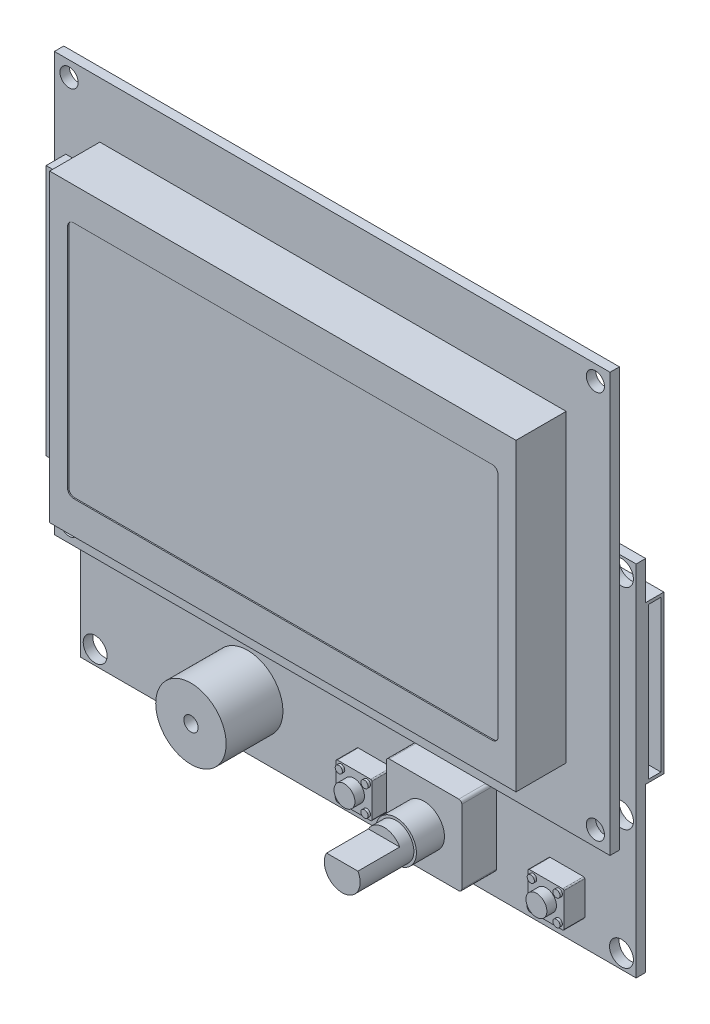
ISO-10303-21;
HEADER;
FILE_DESCRIPTION(('STEP AP214'),'2;1');
FILE_NAME('part.step','',(''),(''),'','','');
FILE_SCHEMA(('AUTOMOTIVE_DESIGN { 1 0 10303 214 1 1 1 1 }'));
ENDSEC;
DATA;
#1=APPLICATION_CONTEXT('core data for automotive mechanical design processes');
#2=APPLICATION_PROTOCOL_DEFINITION('international standard','automotive_design',2000,#1);
#3=PRODUCT_CONTEXT('',#1,'mechanical');
#4=PRODUCT('Part','Part','',(#3));
#5=PRODUCT_RELATED_PRODUCT_CATEGORY('part','',(#4));
#6=PRODUCT_DEFINITION_FORMATION('','',#4);
#7=PRODUCT_DEFINITION_CONTEXT('part definition',#1,'design');
#8=PRODUCT_DEFINITION('design','',#6,#7);
#9=PRODUCT_DEFINITION_SHAPE('','',#8);
#10=(LENGTH_UNIT() NAMED_UNIT(*) SI_UNIT(.MILLI.,.METRE.));
#11=(NAMED_UNIT(*) PLANE_ANGLE_UNIT() SI_UNIT($,.RADIAN.));
#12=(NAMED_UNIT(*) SI_UNIT($,.STERADIAN.) SOLID_ANGLE_UNIT());
#13=UNCERTAINTY_MEASURE_WITH_UNIT(LENGTH_MEASURE(1.E-05),#10,'distance_accuracy_value','');
#14=(GEOMETRIC_REPRESENTATION_CONTEXT(3) GLOBAL_UNCERTAINTY_ASSIGNED_CONTEXT((#13)) GLOBAL_UNIT_ASSIGNED_CONTEXT((#10,
#11,#12)) REPRESENTATION_CONTEXT('',''));
#15=CARTESIAN_POINT('',(0.,0.,0.));
#16=DIRECTION('',(0.,0.,1.));
#17=DIRECTION('',(1.,0.,0.));
#18=AXIS2_PLACEMENT_3D('',#15,#16,#17);
#19=CARTESIAN_POINT('',(63.335,-9.7,16.7));
#20=DIRECTION('',(0.,0.,1.));
#21=DIRECTION('',(1.,0.,0.));
#22=AXIS2_PLACEMENT_3D('',#19,#20,#21);
#23=PLANE('',#22);
#24=CARTESIAN_POINT('',(63.335,-9.7,16.7));
#25=DIRECTION('',(0.,0.,-1.));
#26=DIRECTION('',(-1.,0.,0.));
#27=AXIS2_PLACEMENT_3D('',#24,#25,#26);
#28=CIRCLE('',#27,3.00000000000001);
#29=CARTESIAN_POINT('',(65.9613091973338,-8.25,16.7));
#30=VERTEX_POINT('',#29);
#31=CARTESIAN_POINT('',(60.7086908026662,-8.25,16.7));
#32=VERTEX_POINT('',#31);
#33=EDGE_CURVE('E547',#30,#32,#28,.T.);
#34=ORIENTED_EDGE('',*,*,#33,.F.);
#35=DIRECTION('',(1.,0.,0.));
#36=VECTOR('',#35,1.);
#37=CARTESIAN_POINT('',(60.7086908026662,-8.25,16.7));
#38=LINE('',#37,#36);
#39=EDGE_CURVE('E560',#30,#32,#38,.F.);
#40=ORIENTED_EDGE('',*,*,#39,.T.);
#41=EDGE_LOOP('',(#34,#40));
#42=FACE_BOUND('',#41,.T.);
#43=ADVANCED_FACE('F17',(#42),#23,.T.);
#44=CARTESIAN_POINT('',(63.335,-9.7,9.7));
#45=DIRECTION('',(0.,0.,1.));
#46=DIRECTION('',(1.,0.,0.));
#47=AXIS2_PLACEMENT_3D('',#44,#45,#46);
#48=PLANE('',#47);
#49=DIRECTION('',(1.,0.,0.));
#50=VECTOR('',#49,1.);
#51=CARTESIAN_POINT('',(60.7086908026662,-8.25,9.7));
#52=LINE('',#51,#50);
#53=CARTESIAN_POINT('',(60.7086908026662,-8.25,9.7));
#54=VERTEX_POINT('',#53);
#55=CARTESIAN_POINT('',(65.9613091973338,-8.25,9.7));
#56=VERTEX_POINT('',#55);
#57=EDGE_CURVE('E558',#54,#56,#52,.T.);
#58=ORIENTED_EDGE('',*,*,#57,.T.);
#59=CARTESIAN_POINT('',(63.335,-9.7,9.7));
#60=DIRECTION('',(0.,0.,-1.));
#61=DIRECTION('',(-1.,0.,0.));
#62=AXIS2_PLACEMENT_3D('',#59,#60,#61);
#63=CIRCLE('',#62,3.00000000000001);
#64=EDGE_CURVE('E565',#54,#56,#63,.T.);
#65=ORIENTED_EDGE('',*,*,#64,.F.);
#66=EDGE_LOOP('',(#58,#65));
#67=FACE_BOUND('',#66,.T.);
#68=ADVANCED_FACE('F1616',(#67),#48,.T.);
#69=CARTESIAN_POINT('',(60.7086908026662,-8.25,16.7));
#70=DIRECTION('',(0.,-1.,0.));
#71=DIRECTION('',(0.,0.,-1.));
#72=AXIS2_PLACEMENT_3D('',#69,#70,#71);
#73=PLANE('',#72);
#74=ORIENTED_EDGE('',*,*,#57,.F.);
#75=DIRECTION('',(0.,0.,-1.));
#76=VECTOR('',#75,1.);
#77=CARTESIAN_POINT('',(60.7086908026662,-8.25,16.7));
#78=LINE('',#77,#76);
#79=EDGE_CURVE('E555',#32,#54,#78,.T.);
#80=ORIENTED_EDGE('',*,*,#79,.F.);
#81=ORIENTED_EDGE('',*,*,#39,.F.);
#82=DIRECTION('',(0.,0.,-1.));
#83=VECTOR('',#82,1.);
#84=CARTESIAN_POINT('',(65.9613091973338,-8.25000000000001,16.7));
#85=LINE('',#84,#83);
#86=EDGE_CURVE('E557',#56,#30,#85,.F.);
#87=ORIENTED_EDGE('',*,*,#86,.F.);
#88=EDGE_LOOP('',(#74,#80,#81,#87));
#89=FACE_BOUND('',#88,.T.);
#90=ADVANCED_FACE('F563',(#89),#73,.F.);
#91=CARTESIAN_POINT('',(0.,0.,-4.4));
#92=DIRECTION('',(0.,0.,-1.));
#93=DIRECTION('',(-1.,0.,0.));
#94=AXIS2_PLACEMENT_3D('',#91,#92,#93);
#95=PLANE('',#94);
#96=DIRECTION('',(0.,1.,0.));
#97=VECTOR('',#96,1.);
#98=CARTESIAN_POINT('',(28.,0.,-4.4));
#99=LINE('',#98,#97);
#100=CARTESIAN_POINT('',(28.,30.2,-4.4));
#101=VERTEX_POINT('',#100);
#102=CARTESIAN_POINT('',(28.,37.95,-4.4));
#103=VERTEX_POINT('',#102);
#104=EDGE_CURVE('E1048',#101,#103,#99,.T.);
#105=ORIENTED_EDGE('',*,*,#104,.T.);
#106=DIRECTION('',(1.,0.,0.));
#107=VECTOR('',#106,1.);
#108=CARTESIAN_POINT('',(0.,37.95,-4.4));
#109=LINE('',#108,#107);
#110=CARTESIAN_POINT('',(47.3,37.95,-4.4));
#111=VERTEX_POINT('',#110);
#112=EDGE_CURVE('E1053',#103,#111,#109,.T.);
#113=ORIENTED_EDGE('',*,*,#112,.T.);
#114=DIRECTION('',(0.,1.,0.));
#115=VECTOR('',#114,1.);
#116=CARTESIAN_POINT('',(47.3,0.,-4.4));
#117=LINE('',#116,#115);
#118=CARTESIAN_POINT('',(47.3,30.2,-4.4));
#119=VERTEX_POINT('',#118);
#120=EDGE_CURVE('E570',#119,#111,#117,.T.);
#121=ORIENTED_EDGE('',*,*,#120,.F.);
#122=DIRECTION('',(1.,0.,0.));
#123=VECTOR('',#122,1.);
#124=CARTESIAN_POINT('',(0.,30.2,-4.4));
#125=LINE('',#124,#123);
#126=EDGE_CURVE('E1045',#101,#119,#125,.T.);
#127=ORIENTED_EDGE('',*,*,#126,.F.);
#128=EDGE_LOOP('',(#105,#113,#121,#127));
#129=FACE_BOUND('',#128,.T.);
#130=ADVANCED_FACE('F1062',(#129),#95,.T.);
#131=CARTESIAN_POINT('',(0.,0.,-4.4));
#132=DIRECTION('',(0.,0.,-1.));
#133=DIRECTION('',(-1.,0.,0.));
#134=AXIS2_PLACEMENT_3D('',#131,#132,#133);
#135=PLANE('',#134);
#136=DIRECTION('',(0.,1.,0.));
#137=VECTOR('',#136,1.);
#138=CARTESIAN_POINT('',(6.99999999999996,0.,-4.4));
#139=LINE('',#138,#137);
#140=CARTESIAN_POINT('',(6.99999999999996,30.2,-4.4));
#141=VERTEX_POINT('',#140);
#142=CARTESIAN_POINT('',(6.99999999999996,37.95,-4.4));
#143=VERTEX_POINT('',#142);
#144=EDGE_CURVE('E1027',#141,#143,#139,.T.);
#145=ORIENTED_EDGE('',*,*,#144,.T.);
#146=DIRECTION('',(1.,0.,0.));
#147=VECTOR('',#146,1.);
#148=CARTESIAN_POINT('',(0.,37.95,-4.4));
#149=LINE('',#148,#147);
#150=CARTESIAN_POINT('',(26.3,37.95,-4.4));
#151=VERTEX_POINT('',#150);
#152=EDGE_CURVE('E1032',#143,#151,#149,.T.);
#153=ORIENTED_EDGE('',*,*,#152,.T.);
#154=DIRECTION('',(0.,1.,0.));
#155=VECTOR('',#154,1.);
#156=CARTESIAN_POINT('',(26.3,0.,-4.4));
#157=LINE('',#156,#155);
#158=CARTESIAN_POINT('',(26.3,30.2,-4.4));
#159=VERTEX_POINT('',#158);
#160=EDGE_CURVE('E1037',#159,#151,#157,.T.);
#161=ORIENTED_EDGE('',*,*,#160,.F.);
#162=DIRECTION('',(1.,0.,0.));
#163=VECTOR('',#162,1.);
#164=CARTESIAN_POINT('',(0.,30.2,-4.4));
#165=LINE('',#164,#163);
#166=EDGE_CURVE('E1024',#141,#159,#165,.T.);
#167=ORIENTED_EDGE('',*,*,#166,.F.);
#168=EDGE_LOOP('',(#145,#153,#161,#167));
#169=FACE_BOUND('',#168,.T.);
#170=ADVANCED_FACE('F1603',(#169),#135,.T.);
#171=CARTESIAN_POINT('',(63.335,-9.7,16.7));
#172=DIRECTION('',(0.,0.,-1.));
#173=DIRECTION('',(-1.,0.,0.));
#174=AXIS2_PLACEMENT_3D('',#171,#172,#173);
#175=CYLINDRICAL_SURFACE('',#174,3.00000000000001);
#176=CARTESIAN_POINT('',(63.335,-9.7,7.7));
#177=DIRECTION('',(0.,0.,-1.));
#178=DIRECTION('',(-1.,0.,0.));
#179=AXIS2_PLACEMENT_3D('',#176,#177,#178);
#180=CIRCLE('',#179,3.00000000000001);
#181=CARTESIAN_POINT('',(60.335,-9.7,7.7));
#182=VERTEX_POINT('',#181);
#183=EDGE_CURVE('E826',#182,#182,#180,.T.);
#184=ORIENTED_EDGE('',*,*,#183,.F.);
#185=EDGE_LOOP('',(#184));
#186=FACE_BOUND('',#185,.T.);
#187=ORIENTED_EDGE('',*,*,#64,.T.);
#188=ORIENTED_EDGE('',*,*,#86,.T.);
#189=ORIENTED_EDGE('',*,*,#33,.T.);
#190=ORIENTED_EDGE('',*,*,#79,.T.);
#191=EDGE_LOOP('',(#187,#188,#189,#190));
#192=FACE_BOUND('',#191,.T.);
#193=ADVANCED_FACE('F553',(#186,#192),#175,.T.);
#194=CARTESIAN_POINT('',(47.3,0.,-13.4));
#195=DIRECTION('',(-1.,0.,0.));
#196=DIRECTION('',(0.,0.,1.));
#197=AXIS2_PLACEMENT_3D('',#194,#195,#196);
#198=PLANE('',#197);
#199=DIRECTION('',(0.,1.,0.));
#200=VECTOR('',#199,1.);
#201=CARTESIAN_POINT('',(47.3,0.,-13.4));
#202=LINE('',#201,#200);
#203=CARTESIAN_POINT('',(47.3,30.2,-13.4));
#204=VERTEX_POINT('',#203);
#205=CARTESIAN_POINT('',(47.3,37.95,-13.4));
#206=VERTEX_POINT('',#205);
#207=EDGE_CURVE('E828',#204,#206,#202,.T.);
#208=ORIENTED_EDGE('',*,*,#207,.F.);
#209=DIRECTION('',(0.,0.,1.));
#210=VECTOR('',#209,1.);
#211=CARTESIAN_POINT('',(47.3,30.2,-13.4));
#212=LINE('',#211,#210);
#213=EDGE_CURVE('E1042',#119,#204,#212,.F.);
#214=ORIENTED_EDGE('',*,*,#213,.F.);
#215=ORIENTED_EDGE('',*,*,#120,.T.);
#216=DIRECTION('',(0.,0.,1.));
#217=VECTOR('',#216,1.);
#218=CARTESIAN_POINT('',(47.3,37.95,-13.4));
#219=LINE('',#218,#217);
#220=EDGE_CURVE('E1055',#111,#206,#219,.F.);
#221=ORIENTED_EDGE('',*,*,#220,.T.);
#222=EDGE_LOOP('',(#208,#214,#215,#221));
#223=FACE_BOUND('',#222,.T.);
#224=ADVANCED_FACE('F1060',(#223),#198,.T.);
#225=CARTESIAN_POINT('',(0.,37.95,-13.4));
#226=DIRECTION('',(0.,1.,0.));
#227=DIRECTION('',(0.,0.,1.));
#228=AXIS2_PLACEMENT_3D('',#225,#226,#227);
#229=PLANE('',#228);
#230=DIRECTION('',(0.,0.,1.));
#231=VECTOR('',#230,1.);
#232=CARTESIAN_POINT('',(28.,37.95,-13.4));
#233=LINE('',#232,#231);
#234=CARTESIAN_POINT('',(28.,37.95,-13.4));
#235=VERTEX_POINT('',#234);
#236=EDGE_CURVE('E1051',#103,#235,#233,.F.);
#237=ORIENTED_EDGE('',*,*,#236,.T.);
#238=DIRECTION('',(-1.,0.,0.));
#239=VECTOR('',#238,1.);
#240=CARTESIAN_POINT('',(0.,37.95,-13.4));
#241=LINE('',#240,#239);
#242=EDGE_CURVE('E1010',#206,#235,#241,.T.);
#243=ORIENTED_EDGE('',*,*,#242,.F.);
#244=ORIENTED_EDGE('',*,*,#220,.F.);
#245=ORIENTED_EDGE('',*,*,#112,.F.);
#246=EDGE_LOOP('',(#237,#243,#244,#245));
#247=FACE_BOUND('',#246,.T.);
#248=ADVANCED_FACE('F1066',(#247),#229,.F.);
#249=CARTESIAN_POINT('',(28.,0.,-13.4));
#250=DIRECTION('',(-1.,0.,0.));
#251=DIRECTION('',(0.,0.,1.));
#252=AXIS2_PLACEMENT_3D('',#249,#250,#251);
#253=PLANE('',#252);
#254=DIRECTION('',(0.,0.,1.));
#255=VECTOR('',#254,1.);
#256=CARTESIAN_POINT('',(28.,30.2,-13.4));
#257=LINE('',#256,#255);
#258=CARTESIAN_POINT('',(28.,30.2,-13.4));
#259=VERTEX_POINT('',#258);
#260=EDGE_CURVE('E1039',#259,#101,#257,.T.);
#261=ORIENTED_EDGE('',*,*,#260,.F.);
#262=DIRECTION('',(0.,1.,0.));
#263=VECTOR('',#262,1.);
#264=CARTESIAN_POINT('',(28.,0.,-13.4));
#265=LINE('',#264,#263);
#266=EDGE_CURVE('E1007',#235,#259,#265,.F.);
#267=ORIENTED_EDGE('',*,*,#266,.F.);
#268=ORIENTED_EDGE('',*,*,#236,.F.);
#269=ORIENTED_EDGE('',*,*,#104,.F.);
#270=EDGE_LOOP('',(#261,#267,#268,#269));
#271=FACE_BOUND('',#270,.T.);
#272=ADVANCED_FACE('F1074',(#271),#253,.F.);
#273=CARTESIAN_POINT('',(0.,30.2,-13.4));
#274=DIRECTION('',(0.,1.,0.));
#275=DIRECTION('',(0.,0.,1.));
#276=AXIS2_PLACEMENT_3D('',#273,#274,#275);
#277=PLANE('',#276);
#278=DIRECTION('',(-1.,0.,0.));
#279=VECTOR('',#278,1.);
#280=CARTESIAN_POINT('',(0.,30.2,-13.4));
#281=LINE('',#280,#279);
#282=EDGE_CURVE('E1004',#259,#204,#281,.F.);
#283=ORIENTED_EDGE('',*,*,#282,.F.);
#284=ORIENTED_EDGE('',*,*,#260,.T.);
#285=ORIENTED_EDGE('',*,*,#126,.T.);
#286=ORIENTED_EDGE('',*,*,#213,.T.);
#287=EDGE_LOOP('',(#283,#284,#285,#286));
#288=FACE_BOUND('',#287,.T.);
#289=ADVANCED_FACE('F1072',(#288),#277,.T.);
#290=CARTESIAN_POINT('',(26.3,0.,-13.4));
#291=DIRECTION('',(-1.,0.,0.));
#292=DIRECTION('',(0.,0.,1.));
#293=AXIS2_PLACEMENT_3D('',#290,#291,#292);
#294=PLANE('',#293);
#295=DIRECTION('',(0.,1.,0.));
#296=VECTOR('',#295,1.);
#297=CARTESIAN_POINT('',(26.3,0.,-13.4));
#298=LINE('',#297,#296);
#299=CARTESIAN_POINT('',(26.3,30.2,-13.4));
#300=VERTEX_POINT('',#299);
#301=CARTESIAN_POINT('',(26.3,37.95,-13.4));
#302=VERTEX_POINT('',#301);
#303=EDGE_CURVE('E1001',#300,#302,#298,.T.);
#304=ORIENTED_EDGE('',*,*,#303,.F.);
#305=DIRECTION('',(0.,0.,1.));
#306=VECTOR('',#305,1.);
#307=CARTESIAN_POINT('',(26.3,30.2,-13.4));
#308=LINE('',#307,#306);
#309=EDGE_CURVE('E1021',#159,#300,#308,.F.);
#310=ORIENTED_EDGE('',*,*,#309,.F.);
#311=ORIENTED_EDGE('',*,*,#160,.T.);
#312=DIRECTION('',(0.,0.,1.));
#313=VECTOR('',#312,1.);
#314=CARTESIAN_POINT('',(26.3,37.95,-13.4));
#315=LINE('',#314,#313);
#316=EDGE_CURVE('E1035',#151,#302,#315,.F.);
#317=ORIENTED_EDGE('',*,*,#316,.T.);
#318=EDGE_LOOP('',(#304,#310,#311,#317));
#319=FACE_BOUND('',#318,.T.);
#320=ADVANCED_FACE('F1082',(#319),#294,.T.);
#321=CARTESIAN_POINT('',(0.,37.95,-13.4));
#322=DIRECTION('',(0.,1.,0.));
#323=DIRECTION('',(0.,0.,1.));
#324=AXIS2_PLACEMENT_3D('',#321,#322,#323);
#325=PLANE('',#324);
#326=DIRECTION('',(0.,0.,1.));
#327=VECTOR('',#326,1.);
#328=CARTESIAN_POINT('',(6.99999999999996,37.95,-13.4));
#329=LINE('',#328,#327);
#330=CARTESIAN_POINT('',(6.99999999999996,37.95,-13.4));
#331=VERTEX_POINT('',#330);
#332=EDGE_CURVE('E1030',#143,#331,#329,.F.);
#333=ORIENTED_EDGE('',*,*,#332,.T.);
#334=DIRECTION('',(-1.,0.,0.));
#335=VECTOR('',#334,1.);
#336=CARTESIAN_POINT('',(0.,37.95,-13.4));
#337=LINE('',#336,#335);
#338=EDGE_CURVE('E998',#302,#331,#337,.T.);
#339=ORIENTED_EDGE('',*,*,#338,.F.);
#340=ORIENTED_EDGE('',*,*,#316,.F.);
#341=ORIENTED_EDGE('',*,*,#152,.F.);
#342=EDGE_LOOP('',(#333,#339,#340,#341));
#343=FACE_BOUND('',#342,.T.);
#344=ADVANCED_FACE('F1585',(#343),#325,.F.);
#345=CARTESIAN_POINT('',(6.99999999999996,0.,-13.4));
#346=DIRECTION('',(-1.,0.,0.));
#347=DIRECTION('',(0.,0.,1.));
#348=AXIS2_PLACEMENT_3D('',#345,#346,#347);
#349=PLANE('',#348);
#350=DIRECTION('',(0.,0.,1.));
#351=VECTOR('',#350,1.);
#352=CARTESIAN_POINT('',(6.99999999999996,30.2,-13.4));
#353=LINE('',#352,#351);
#354=CARTESIAN_POINT('',(6.99999999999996,30.2,-13.4));
#355=VERTEX_POINT('',#354);
#356=EDGE_CURVE('E829',#355,#141,#353,.T.);
#357=ORIENTED_EDGE('',*,*,#356,.F.);
#358=DIRECTION('',(0.,1.,0.));
#359=VECTOR('',#358,1.);
#360=CARTESIAN_POINT('',(6.99999999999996,0.,-13.4));
#361=LINE('',#360,#359);
#362=EDGE_CURVE('E995',#331,#355,#361,.F.);
#363=ORIENTED_EDGE('',*,*,#362,.F.);
#364=ORIENTED_EDGE('',*,*,#332,.F.);
#365=ORIENTED_EDGE('',*,*,#144,.F.);
#366=EDGE_LOOP('',(#357,#363,#364,#365));
#367=FACE_BOUND('',#366,.T.);
#368=ADVANCED_FACE('F1581',(#367),#349,.F.);
#369=CARTESIAN_POINT('',(0.,30.2,-13.4));
#370=DIRECTION('',(0.,1.,0.));
#371=DIRECTION('',(0.,0.,1.));
#372=AXIS2_PLACEMENT_3D('',#369,#370,#371);
#373=PLANE('',#372);
#374=DIRECTION('',(-1.,0.,0.));
#375=VECTOR('',#374,1.);
#376=CARTESIAN_POINT('',(0.,30.2,-13.4));
#377=LINE('',#376,#375);
#378=EDGE_CURVE('E992',#355,#300,#377,.F.);
#379=ORIENTED_EDGE('',*,*,#378,.F.);
#380=ORIENTED_EDGE('',*,*,#356,.T.);
#381=ORIENTED_EDGE('',*,*,#166,.T.);
#382=ORIENTED_EDGE('',*,*,#309,.T.);
#383=EDGE_LOOP('',(#379,#380,#381,#382));
#384=FACE_BOUND('',#383,.T.);
#385=ADVANCED_FACE('F1577',(#384),#373,.T.);
#386=CARTESIAN_POINT('',(11.61,16.25,9.77));
#387=DIRECTION('',(0.,0.,1.));
#388=DIRECTION('',(1.,0.,0.));
#389=AXIS2_PLACEMENT_3D('',#386,#387,#388);
#390=PLANE('',#389);
#391=CARTESIAN_POINT('',(11.61,54.25,9.77));
#392=DIRECTION('',(0.,0.,1.));
#393=DIRECTION('',(1.,0.,0.));
#394=AXIS2_PLACEMENT_3D('',#391,#392,#393);
#395=CIRCLE('',#394,1.);
#396=CARTESIAN_POINT('',(11.61,55.25,9.77));
#397=VERTEX_POINT('',#396);
#398=CARTESIAN_POINT('',(10.61,54.25,9.77));
#399=VERTEX_POINT('',#398);
#400=EDGE_CURVE('E818',#397,#399,#395,.T.);
#401=ORIENTED_EDGE('',*,*,#400,.T.);
#402=DIRECTION('',(0.,-1.,0.));
#403=VECTOR('',#402,1.);
#404=CARTESIAN_POINT('',(10.61,54.25,9.77));
#405=LINE('',#404,#403);
#406=CARTESIAN_POINT('',(10.61,16.25,9.77));
#407=VERTEX_POINT('',#406);
#408=EDGE_CURVE('E824',#399,#407,#405,.T.);
#409=ORIENTED_EDGE('',*,*,#408,.T.);
#410=CARTESIAN_POINT('',(11.61,16.25,9.77));
#411=DIRECTION('',(0.,0.,1.));
#412=DIRECTION('',(1.,0.,0.));
#413=AXIS2_PLACEMENT_3D('',#410,#411,#412);
#414=CIRCLE('',#413,0.999999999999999);
#415=CARTESIAN_POINT('',(11.61,15.25,9.77));
#416=VERTEX_POINT('',#415);
#417=EDGE_CURVE('E822',#407,#416,#414,.T.);
#418=ORIENTED_EDGE('',*,*,#417,.T.);
#419=DIRECTION('',(1.,0.,0.));
#420=VECTOR('',#419,1.);
#421=CARTESIAN_POINT('',(11.61,15.25,9.77));
#422=LINE('',#421,#420);
#423=CARTESIAN_POINT('',(81.71,15.25,9.77));
#424=VERTEX_POINT('',#423);
#425=EDGE_CURVE('E975',#416,#424,#422,.T.);
#426=ORIENTED_EDGE('',*,*,#425,.T.);
#427=CARTESIAN_POINT('',(81.71,16.25,9.77));
#428=DIRECTION('',(0.,0.,1.));
#429=DIRECTION('',(1.,0.,0.));
#430=AXIS2_PLACEMENT_3D('',#427,#428,#429);
#431=CIRCLE('',#430,1.);
#432=CARTESIAN_POINT('',(82.71,16.25,9.77));
#433=VERTEX_POINT('',#432);
#434=EDGE_CURVE('E810',#424,#433,#431,.T.);
#435=ORIENTED_EDGE('',*,*,#434,.T.);
#436=DIRECTION('',(0.,1.,0.));
#437=VECTOR('',#436,1.);
#438=CARTESIAN_POINT('',(82.71,54.25,9.77));
#439=LINE('',#438,#437);
#440=CARTESIAN_POINT('',(82.71,54.25,9.77));
#441=VERTEX_POINT('',#440);
#442=EDGE_CURVE('E981',#433,#441,#439,.T.);
#443=ORIENTED_EDGE('',*,*,#442,.T.);
#444=CARTESIAN_POINT('',(81.71,54.25,9.77));
#445=DIRECTION('',(0.,0.,1.));
#446=DIRECTION('',(1.,0.,0.));
#447=AXIS2_PLACEMENT_3D('',#444,#445,#446);
#448=CIRCLE('',#447,1.);
#449=CARTESIAN_POINT('',(81.71,55.25,9.77));
#450=VERTEX_POINT('',#449);
#451=EDGE_CURVE('E814',#441,#450,#448,.T.);
#452=ORIENTED_EDGE('',*,*,#451,.T.);
#453=DIRECTION('',(1.,0.,0.));
#454=VECTOR('',#453,1.);
#455=CARTESIAN_POINT('',(11.61,55.25,9.77));
#456=LINE('',#455,#454);
#457=EDGE_CURVE('E984',#450,#397,#456,.F.);
#458=ORIENTED_EDGE('',*,*,#457,.T.);
#459=EDGE_LOOP('',(#401,#409,#418,#426,#435,#443,#452,#458));
#460=FACE_BOUND('',#459,.T.);
#461=ADVANCED_FACE('F1573',(#460),#390,.T.);
#462=CARTESIAN_POINT('',(63.335,-9.7,7.7));
#463=DIRECTION('',(0.,0.,1.));
#464=DIRECTION('',(1.,0.,0.));
#465=AXIS2_PLACEMENT_3D('',#462,#463,#464);
#466=PLANE('',#465);
#467=ORIENTED_EDGE('',*,*,#183,.T.);
#468=EDGE_LOOP('',(#467));
#469=FACE_BOUND('',#468,.T.);
#470=CARTESIAN_POINT('',(63.335,-9.7,7.7));
#471=DIRECTION('',(0.,0.,-1.));
#472=DIRECTION('',(-1.,0.,0.));
#473=AXIS2_PLACEMENT_3D('',#470,#471,#472);
#474=CIRCLE('',#473,3.425);
#475=CARTESIAN_POINT('',(59.91,-9.7,7.7));
#476=VERTEX_POINT('',#475);
#477=EDGE_CURVE('E806',#476,#476,#474,.T.);
#478=ORIENTED_EDGE('',*,*,#477,.F.);
#479=EDGE_LOOP('',(#478));
#480=FACE_BOUND('',#479,.T.);
#481=ADVANCED_FACE('F1569',(#469,#480),#466,.T.);
#482=CARTESIAN_POINT('',(83.61,-14.8,1.1));
#483=DIRECTION('',(0.,0.,1.));
#484=DIRECTION('',(1.,0.,0.));
#485=AXIS2_PLACEMENT_3D('',#482,#483,#484);
#486=PLANE('',#485);
#487=CARTESIAN_POINT('',(83.61,-14.8,1.1));
#488=DIRECTION('',(0.,0.,-1.));
#489=DIRECTION('',(-1.,0.,0.));
#490=AXIS2_PLACEMENT_3D('',#487,#488,#489);
#491=CIRCLE('',#490,0.600000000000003);
#492=CARTESIAN_POINT('',(83.01,-14.8,1.1));
#493=VERTEX_POINT('',#492);
#494=EDGE_CURVE('E803',#493,#493,#491,.T.);
#495=ORIENTED_EDGE('',*,*,#494,.F.);
#496=EDGE_LOOP('',(#495));
#497=FACE_BOUND('',#496,.T.);
#498=ADVANCED_FACE('F1565',(#497),#486,.T.);
#499=CARTESIAN_POINT('',(79.31,-10.5,1.1));
#500=DIRECTION('',(0.,0.,1.));
#501=DIRECTION('',(1.,0.,0.));
#502=AXIS2_PLACEMENT_3D('',#499,#500,#501);
#503=PLANE('',#502);
#504=CARTESIAN_POINT('',(79.31,-10.5,1.1));
#505=DIRECTION('',(0.,0.,-1.));
#506=DIRECTION('',(-1.,0.,0.));
#507=AXIS2_PLACEMENT_3D('',#504,#505,#506);
#508=CIRCLE('',#507,0.600000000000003);
#509=CARTESIAN_POINT('',(78.71,-10.5,1.1));
#510=VERTEX_POINT('',#509);
#511=EDGE_CURVE('E800',#510,#510,#508,.T.);
#512=ORIENTED_EDGE('',*,*,#511,.F.);
#513=EDGE_LOOP('',(#512));
#514=FACE_BOUND('',#513,.T.);
#515=ADVANCED_FACE('F1561',(#514),#503,.T.);
#516=CARTESIAN_POINT('',(81.46,-12.65,2.3));
#517=DIRECTION('',(0.,0.,1.));
#518=DIRECTION('',(1.,0.,0.));
#519=AXIS2_PLACEMENT_3D('',#516,#517,#518);
#520=PLANE('',#519);
#521=CARTESIAN_POINT('',(81.46,-12.65,2.3));
#522=DIRECTION('',(0.,0.,-1.));
#523=DIRECTION('',(-1.,0.,0.));
#524=AXIS2_PLACEMENT_3D('',#521,#522,#523);
#525=CIRCLE('',#524,1.75);
#526=CARTESIAN_POINT('',(79.71,-12.65,2.3));
#527=VERTEX_POINT('',#526);
#528=EDGE_CURVE('E797',#527,#527,#525,.T.);
#529=ORIENTED_EDGE('',*,*,#528,.F.);
#530=EDGE_LOOP('',(#529));
#531=FACE_BOUND('',#530,.T.);
#532=ADVANCED_FACE('F1557',(#531),#520,.T.);
#533=CARTESIAN_POINT('',(83.61,-10.5,1.1));
#534=DIRECTION('',(0.,0.,1.));
#535=DIRECTION('',(1.,0.,0.));
#536=AXIS2_PLACEMENT_3D('',#533,#534,#535);
#537=PLANE('',#536);
#538=CARTESIAN_POINT('',(83.61,-10.5,1.1));
#539=DIRECTION('',(0.,0.,-1.));
#540=DIRECTION('',(-1.,0.,0.));
#541=AXIS2_PLACEMENT_3D('',#538,#539,#540);
#542=CIRCLE('',#541,0.600000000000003);
#543=CARTESIAN_POINT('',(83.01,-10.5,1.1));
#544=VERTEX_POINT('',#543);
#545=EDGE_CURVE('E794',#544,#544,#542,.T.);
#546=ORIENTED_EDGE('',*,*,#545,.F.);
#547=EDGE_LOOP('',(#546));
#548=FACE_BOUND('',#547,.T.);
#549=ADVANCED_FACE('F1553',(#548),#537,.T.);
#550=CARTESIAN_POINT('',(79.31,-14.8,1.1));
#551=DIRECTION('',(0.,0.,1.));
#552=DIRECTION('',(1.,0.,0.));
#553=AXIS2_PLACEMENT_3D('',#550,#551,#552);
#554=PLANE('',#553);
#555=CARTESIAN_POINT('',(79.31,-14.8,1.1));
#556=DIRECTION('',(0.,0.,-1.));
#557=DIRECTION('',(-1.,0.,0.));
#558=AXIS2_PLACEMENT_3D('',#555,#556,#557);
#559=CIRCLE('',#558,0.600000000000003);
#560=CARTESIAN_POINT('',(78.71,-14.8,1.1));
#561=VERTEX_POINT('',#560);
#562=EDGE_CURVE('E790',#561,#561,#559,.T.);
#563=ORIENTED_EDGE('',*,*,#562,.F.);
#564=EDGE_LOOP('',(#563));
#565=FACE_BOUND('',#564,.T.);
#566=ADVANCED_FACE('F1549',(#565),#554,.T.);
#567=CARTESIAN_POINT('',(0.,0.,-13.4));
#568=DIRECTION('',(0.,0.,-1.));
#569=DIRECTION('',(-1.,0.,0.));
#570=AXIS2_PLACEMENT_3D('',#567,#568,#569);
#571=PLANE('',#570);
#572=DIRECTION('',(0.,1.,0.));
#573=VECTOR('',#572,1.);
#574=CARTESIAN_POINT('',(47.8,0.,-13.4));
#575=LINE('',#574,#573);
#576=CARTESIAN_POINT('',(47.8,38.45,-13.4));
#577=VERTEX_POINT('',#576);
#578=CARTESIAN_POINT('',(47.8,29.7,-13.4));
#579=VERTEX_POINT('',#578);
#580=EDGE_CURVE('E966',#577,#579,#575,.F.);
#581=ORIENTED_EDGE('',*,*,#580,.T.);
#582=DIRECTION('',(-1.,0.,0.));
#583=VECTOR('',#582,1.);
#584=CARTESIAN_POINT('',(0.,29.7,-13.4));
#585=LINE('',#584,#583);
#586=CARTESIAN_POINT('',(27.5,29.7,-13.4));
#587=VERTEX_POINT('',#586);
#588=EDGE_CURVE('E970',#579,#587,#585,.T.);
#589=ORIENTED_EDGE('',*,*,#588,.T.);
#590=DIRECTION('',(0.,1.,0.));
#591=VECTOR('',#590,1.);
#592=CARTESIAN_POINT('',(27.5,0.,-13.4));
#593=LINE('',#592,#591);
#594=CARTESIAN_POINT('',(27.5,38.45,-13.4));
#595=VERTEX_POINT('',#594);
#596=EDGE_CURVE('E793',#595,#587,#593,.F.);
#597=ORIENTED_EDGE('',*,*,#596,.F.);
#598=DIRECTION('',(1.,0.,0.));
#599=VECTOR('',#598,1.);
#600=CARTESIAN_POINT('',(0.,38.45,-13.4));
#601=LINE('',#600,#599);
#602=EDGE_CURVE('E958',#577,#595,#601,.F.);
#603=ORIENTED_EDGE('',*,*,#602,.F.);
#604=EDGE_LOOP('',(#581,#589,#597,#603));
#605=FACE_BOUND('',#604,.T.);
#606=ORIENTED_EDGE('',*,*,#266,.T.);
#607=ORIENTED_EDGE('',*,*,#282,.T.);
#608=ORIENTED_EDGE('',*,*,#207,.T.);
#609=ORIENTED_EDGE('',*,*,#242,.T.);
#610=EDGE_LOOP('',(#606,#607,#608,#609));
#611=FACE_BOUND('',#610,.T.);
#612=ADVANCED_FACE('F1069',(#605,#611),#571,.T.);
#613=CARTESIAN_POINT('',(0.,0.,-13.4));
#614=DIRECTION('',(0.,0.,-1.));
#615=DIRECTION('',(-1.,0.,0.));
#616=AXIS2_PLACEMENT_3D('',#613,#614,#615);
#617=PLANE('',#616);
#618=DIRECTION('',(0.,-1.,0.));
#619=VECTOR('',#618,1.);
#620=CARTESIAN_POINT('',(26.8,0.,-13.4));
#621=LINE('',#620,#619);
#622=CARTESIAN_POINT('',(26.8,38.45,-13.4));
#623=VERTEX_POINT('',#622);
#624=CARTESIAN_POINT('',(26.8,29.7,-13.4));
#625=VERTEX_POINT('',#624);
#626=EDGE_CURVE('E946',#623,#625,#621,.T.);
#627=ORIENTED_EDGE('',*,*,#626,.T.);
#628=DIRECTION('',(-1.,0.,0.));
#629=VECTOR('',#628,1.);
#630=CARTESIAN_POINT('',(0.,29.7,-13.4));
#631=LINE('',#630,#629);
#632=CARTESIAN_POINT('',(6.49999999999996,29.7,-13.4));
#633=VERTEX_POINT('',#632);
#634=EDGE_CURVE('E950',#625,#633,#631,.T.);
#635=ORIENTED_EDGE('',*,*,#634,.T.);
#636=DIRECTION('',(0.,1.,0.));
#637=VECTOR('',#636,1.);
#638=CARTESIAN_POINT('',(6.49999999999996,0.,-13.4));
#639=LINE('',#638,#637);
#640=CARTESIAN_POINT('',(6.49999999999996,38.45,-13.4));
#641=VERTEX_POINT('',#640);
#642=EDGE_CURVE('E952',#641,#633,#639,.F.);
#643=ORIENTED_EDGE('',*,*,#642,.F.);
#644=DIRECTION('',(1.,0.,0.));
#645=VECTOR('',#644,1.);
#646=CARTESIAN_POINT('',(0.,38.45,-13.4));
#647=LINE('',#646,#645);
#648=EDGE_CURVE('E938',#623,#641,#647,.F.);
#649=ORIENTED_EDGE('',*,*,#648,.F.);
#650=EDGE_LOOP('',(#627,#635,#643,#649));
#651=FACE_BOUND('',#650,.T.);
#652=ORIENTED_EDGE('',*,*,#362,.T.);
#653=ORIENTED_EDGE('',*,*,#378,.T.);
#654=ORIENTED_EDGE('',*,*,#303,.T.);
#655=ORIENTED_EDGE('',*,*,#338,.T.);
#656=EDGE_LOOP('',(#652,#653,#654,#655));
#657=FACE_BOUND('',#656,.T.);
#658=ADVANCED_FACE('F1542',(#651,#657),#617,.T.);
#659=CARTESIAN_POINT('',(66.96,33.7,-4.4));
#660=DIRECTION('',(1.,0.,0.));
#661=DIRECTION('',(0.,0.,-1.));
#662=AXIS2_PLACEMENT_3D('',#659,#660,#661);
#663=PLANE('',#662);
#664=DIRECTION('',(0.,1.,0.));
#665=VECTOR('',#664,1.);
#666=CARTESIAN_POINT('',(66.96,33.2,-6.95));
#667=LINE('',#666,#665);
#668=CARTESIAN_POINT('',(66.96,9.85,-6.95));
#669=VERTEX_POINT('',#668);
#670=CARTESIAN_POINT('',(66.96,33.2,-6.95));
#671=VERTEX_POINT('',#670);
#672=EDGE_CURVE('E929',#669,#671,#667,.T.);
#673=ORIENTED_EDGE('',*,*,#672,.T.);
#674=DIRECTION('',(0.,0.,1.));
#675=VECTOR('',#674,1.);
#676=CARTESIAN_POINT('',(66.96,33.2,-4.9));
#677=LINE('',#676,#675);
#678=CARTESIAN_POINT('',(66.96,33.2,-4.9));
#679=VERTEX_POINT('',#678);
#680=EDGE_CURVE('E918',#671,#679,#677,.T.);
#681=ORIENTED_EDGE('',*,*,#680,.T.);
#682=DIRECTION('',(0.,-1.,0.));
#683=VECTOR('',#682,1.);
#684=CARTESIAN_POINT('',(66.96,33.2,-4.9));
#685=LINE('',#684,#683);
#686=CARTESIAN_POINT('',(66.96,9.85,-4.9));
#687=VERTEX_POINT('',#686);
#688=EDGE_CURVE('E913',#679,#687,#685,.T.);
#689=ORIENTED_EDGE('',*,*,#688,.T.);
#690=DIRECTION('',(0.,0.,1.));
#691=VECTOR('',#690,1.);
#692=CARTESIAN_POINT('',(66.96,9.85,-4.4));
#693=LINE('',#692,#691);
#694=EDGE_CURVE('E989',#669,#687,#693,.T.);
#695=ORIENTED_EDGE('',*,*,#694,.F.);
#696=EDGE_LOOP('',(#673,#681,#689,#695));
#697=FACE_BOUND('',#696,.T.);
#698=ADVANCED_FACE('F1538',(#697),#663,.T.);
#699=CARTESIAN_POINT('',(66.96,9.85,-4.4));
#700=DIRECTION('',(0.,1.,0.));
#701=DIRECTION('',(0.,0.,1.));
#702=AXIS2_PLACEMENT_3D('',#699,#700,#701);
#703=PLANE('',#702);
#704=DIRECTION('',(1.,0.,0.));
#705=VECTOR('',#704,1.);
#706=CARTESIAN_POINT('',(-0.00100000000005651,9.85,-6.95));
#707=LINE('',#706,#705);
#708=CARTESIAN_POINT('',(72.0033981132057,9.85,-6.95));
#709=VERTEX_POINT('',#708);
#710=EDGE_CURVE('E923',#709,#669,#707,.F.);
#711=ORIENTED_EDGE('',*,*,#710,.T.);
#712=ORIENTED_EDGE('',*,*,#694,.T.);
#713=DIRECTION('',(1.,0.,0.));
#714=VECTOR('',#713,1.);
#715=CARTESIAN_POINT('',(-0.00100000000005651,9.85,-4.9));
#716=LINE('',#715,#714);
#717=CARTESIAN_POINT('',(72.0033981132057,9.84999999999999,-4.9));
#718=VERTEX_POINT('',#717);
#719=EDGE_CURVE('E911',#687,#718,#716,.T.);
#720=ORIENTED_EDGE('',*,*,#719,.T.);
#721=DIRECTION('',(0.,0.,1.));
#722=VECTOR('',#721,1.);
#723=CARTESIAN_POINT('',(72.0033981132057,9.85,-4.4));
#724=LINE('',#723,#722);
#725=EDGE_CURVE('E825',#709,#718,#724,.T.);
#726=ORIENTED_EDGE('',*,*,#725,.F.);
#727=EDGE_LOOP('',(#711,#712,#720,#726));
#728=FACE_BOUND('',#727,.T.);
#729=ADVANCED_FACE('F1534',(#728),#703,.T.);
#730=CARTESIAN_POINT('',(72.0033981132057,9.85,-4.4));
#731=DIRECTION('',(0.529998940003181,0.847998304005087,0.));
#732=DIRECTION('',(-0.847998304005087,0.529998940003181,0.));
#733=AXIS2_PLACEMENT_3D('',#730,#731,#732);
#734=PLANE('',#733);
#735=DIRECTION('',(-0.847998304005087,0.529998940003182,0.));
#736=VECTOR('',#735,1.);
#737=CARTESIAN_POINT('',(75.2033981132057,7.84999999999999,-6.95));
#738=LINE('',#737,#736);
#739=CARTESIAN_POINT('',(75.2033981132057,7.84999999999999,-6.95));
#740=VERTEX_POINT('',#739);
#741=EDGE_CURVE('E926',#740,#709,#738,.T.);
#742=ORIENTED_EDGE('',*,*,#741,.T.);
#743=ORIENTED_EDGE('',*,*,#725,.T.);
#744=DIRECTION('',(0.847998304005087,-0.529998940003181,0.));
#745=VECTOR('',#744,1.);
#746=CARTESIAN_POINT('',(72.0033981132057,9.85,-4.9));
#747=LINE('',#746,#745);
#748=CARTESIAN_POINT('',(75.2033981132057,7.85,-4.9));
#749=VERTEX_POINT('',#748);
#750=EDGE_CURVE('E909',#718,#749,#747,.T.);
#751=ORIENTED_EDGE('',*,*,#750,.T.);
#752=DIRECTION('',(0.,0.,1.));
#753=VECTOR('',#752,1.);
#754=CARTESIAN_POINT('',(75.2033981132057,7.85,-4.9));
#755=LINE('',#754,#753);
#756=EDGE_CURVE('E904',#749,#740,#755,.F.);
#757=ORIENTED_EDGE('',*,*,#756,.T.);
#758=EDGE_LOOP('',(#742,#743,#751,#757));
#759=FACE_BOUND('',#758,.T.);
#760=ADVANCED_FACE('F1530',(#759),#734,.T.);
#761=CARTESIAN_POINT('',(51.46,-15.,1.1));
#762=DIRECTION('',(0.,0.,1.));
#763=DIRECTION('',(1.,0.,0.));
#764=AXIS2_PLACEMENT_3D('',#761,#762,#763);
#765=PLANE('',#764);
#766=CARTESIAN_POINT('',(51.46,-15.,1.1));
#767=DIRECTION('',(0.,0.,-1.));
#768=DIRECTION('',(-1.,0.,0.));
#769=AXIS2_PLACEMENT_3D('',#766,#767,#768);
#770=CIRCLE('',#769,0.600000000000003);
#771=CARTESIAN_POINT('',(50.86,-15.,1.1));
#772=VERTEX_POINT('',#771);
#773=EDGE_CURVE('E786',#772,#772,#770,.T.);
#774=ORIENTED_EDGE('',*,*,#773,.F.);
#775=EDGE_LOOP('',(#774));
#776=FACE_BOUND('',#775,.T.);
#777=ADVANCED_FACE('F1526',(#776),#765,.T.);
#778=CARTESIAN_POINT('',(47.16,-10.7,1.1));
#779=DIRECTION('',(0.,0.,1.));
#780=DIRECTION('',(1.,0.,0.));
#781=AXIS2_PLACEMENT_3D('',#778,#779,#780);
#782=PLANE('',#781);
#783=CARTESIAN_POINT('',(47.16,-10.7,1.1));
#784=DIRECTION('',(0.,0.,-1.));
#785=DIRECTION('',(-1.,0.,0.));
#786=AXIS2_PLACEMENT_3D('',#783,#784,#785);
#787=CIRCLE('',#786,0.600000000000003);
#788=CARTESIAN_POINT('',(46.56,-10.7,1.1));
#789=VERTEX_POINT('',#788);
#790=EDGE_CURVE('E783',#789,#789,#787,.T.);
#791=ORIENTED_EDGE('',*,*,#790,.F.);
#792=EDGE_LOOP('',(#791));
#793=FACE_BOUND('',#792,.T.);
#794=ADVANCED_FACE('F1522',(#793),#782,.T.);
#795=CARTESIAN_POINT('',(49.31,-12.85,2.3));
#796=DIRECTION('',(0.,0.,1.));
#797=DIRECTION('',(1.,0.,0.));
#798=AXIS2_PLACEMENT_3D('',#795,#796,#797);
#799=PLANE('',#798);
#800=CARTESIAN_POINT('',(49.31,-12.85,2.3));
#801=DIRECTION('',(0.,0.,-1.));
#802=DIRECTION('',(-1.,0.,0.));
#803=AXIS2_PLACEMENT_3D('',#800,#801,#802);
#804=CIRCLE('',#803,1.75);
#805=CARTESIAN_POINT('',(47.56,-12.85,2.3));
#806=VERTEX_POINT('',#805);
#807=EDGE_CURVE('E780',#806,#806,#804,.T.);
#808=ORIENTED_EDGE('',*,*,#807,.F.);
#809=EDGE_LOOP('',(#808));
#810=FACE_BOUND('',#809,.T.);
#811=ADVANCED_FACE('F1518',(#810),#799,.T.);
#812=CARTESIAN_POINT('',(51.46,-10.7,1.1));
#813=DIRECTION('',(0.,0.,1.));
#814=DIRECTION('',(1.,0.,0.));
#815=AXIS2_PLACEMENT_3D('',#812,#813,#814);
#816=PLANE('',#815);
#817=CARTESIAN_POINT('',(51.46,-10.7,1.1));
#818=DIRECTION('',(0.,0.,-1.));
#819=DIRECTION('',(-1.,0.,0.));
#820=AXIS2_PLACEMENT_3D('',#817,#818,#819);
#821=CIRCLE('',#820,0.600000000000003);
#822=CARTESIAN_POINT('',(50.86,-10.7,1.1));
#823=VERTEX_POINT('',#822);
#824=EDGE_CURVE('E777',#823,#823,#821,.T.);
#825=ORIENTED_EDGE('',*,*,#824,.F.);
#826=EDGE_LOOP('',(#825));
#827=FACE_BOUND('',#826,.T.);
#828=ADVANCED_FACE('F1514',(#827),#816,.T.);
#829=CARTESIAN_POINT('',(47.16,-15.,1.1));
#830=DIRECTION('',(0.,0.,1.));
#831=DIRECTION('',(1.,0.,0.));
#832=AXIS2_PLACEMENT_3D('',#829,#830,#831);
#833=PLANE('',#832);
#834=CARTESIAN_POINT('',(47.16,-15.,1.1));
#835=DIRECTION('',(0.,0.,-1.));
#836=DIRECTION('',(-1.,0.,0.));
#837=AXIS2_PLACEMENT_3D('',#834,#835,#836);
#838=CIRCLE('',#837,0.600000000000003);
#839=CARTESIAN_POINT('',(46.56,-15.,1.1));
#840=VERTEX_POINT('',#839);
#841=EDGE_CURVE('E774',#840,#840,#838,.T.);
#842=ORIENTED_EDGE('',*,*,#841,.F.);
#843=EDGE_LOOP('',(#842));
#844=FACE_BOUND('',#843,.T.);
#845=ADVANCED_FACE('F1510',(#844),#833,.T.);
#846=CARTESIAN_POINT('',(28.,-10.85,4.7));
#847=DIRECTION('',(0.,0.,1.));
#848=DIRECTION('',(1.,0.,0.));
#849=AXIS2_PLACEMENT_3D('',#846,#847,#848);
#850=PLANE('',#849);
#851=CARTESIAN_POINT('',(28.,-10.85,4.7));
#852=DIRECTION('',(0.,0.,1.));
#853=DIRECTION('',(1.,0.,0.));
#854=AXIS2_PLACEMENT_3D('',#851,#852,#853);
#855=CIRCLE('',#854,1.2);
#856=CARTESIAN_POINT('',(29.2,-10.85,4.7));
#857=VERTEX_POINT('',#856);
#858=EDGE_CURVE('E771',#857,#857,#855,.T.);
#859=ORIENTED_EDGE('',*,*,#858,.T.);
#860=EDGE_LOOP('',(#859));
#861=FACE_BOUND('',#860,.T.);
#862=ADVANCED_FACE('F1506',(#861),#850,.T.);
#863=CARTESIAN_POINT('',(11.61,16.25,9.77));
#864=DIRECTION('',(0.,0.,1.));
#865=DIRECTION('',(1.,0.,0.));
#866=AXIS2_PLACEMENT_3D('',#863,#864,#865);
#867=CYLINDRICAL_SURFACE('',#866,0.999999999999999);
#868=DIRECTION('',(0.,0.,-1.));
#869=VECTOR('',#868,1.);
#870=CARTESIAN_POINT('',(11.61,15.25,9.77));
#871=LINE('',#870,#869);
#872=CARTESIAN_POINT('',(11.61,15.25,9.97));
#873=VERTEX_POINT('',#872);
#874=EDGE_CURVE('E976',#873,#416,#871,.T.);
#875=ORIENTED_EDGE('',*,*,#874,.T.);
#876=ORIENTED_EDGE('',*,*,#417,.F.);
#877=DIRECTION('',(0.,0.,1.));
#878=VECTOR('',#877,1.);
#879=CARTESIAN_POINT('',(10.61,16.25,9.77));
#880=LINE('',#879,#878);
#881=CARTESIAN_POINT('',(10.61,16.25,9.97));
#882=VERTEX_POINT('',#881);
#883=EDGE_CURVE('E821',#407,#882,#880,.T.);
#884=ORIENTED_EDGE('',*,*,#883,.T.);
#885=CARTESIAN_POINT('',(11.61,16.25,9.97));
#886=DIRECTION('',(0.,0.,1.));
#887=DIRECTION('',(1.,0.,0.));
#888=AXIS2_PLACEMENT_3D('',#885,#886,#887);
#889=CIRCLE('',#888,0.999999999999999);
#890=EDGE_CURVE('E768',#873,#882,#889,.F.);
#891=ORIENTED_EDGE('',*,*,#890,.F.);
#892=EDGE_LOOP('',(#875,#876,#884,#891));
#893=FACE_BOUND('',#892,.T.);
#894=ADVANCED_FACE('F1502',(#893),#867,.F.);
#895=CARTESIAN_POINT('',(10.61,54.25,9.77));
#896=DIRECTION('',(-1.,0.,0.));
#897=DIRECTION('',(0.,-1.,0.));
#898=AXIS2_PLACEMENT_3D('',#895,#896,#897);
#899=PLANE('',#898);
#900=ORIENTED_EDGE('',*,*,#883,.F.);
#901=ORIENTED_EDGE('',*,*,#408,.F.);
#902=DIRECTION('',(0.,0.,1.));
#903=VECTOR('',#902,1.);
#904=CARTESIAN_POINT('',(10.61,54.25,9.77));
#905=LINE('',#904,#903);
#906=CARTESIAN_POINT('',(10.61,54.25,9.97));
#907=VERTEX_POINT('',#906);
#908=EDGE_CURVE('E820',#399,#907,#905,.T.);
#909=ORIENTED_EDGE('',*,*,#908,.T.);
#910=DIRECTION('',(0.,1.,0.));
#911=VECTOR('',#910,1.);
#912=CARTESIAN_POINT('',(10.61,0.,9.97));
#913=LINE('',#912,#911);
#914=EDGE_CURVE('E767',#882,#907,#913,.T.);
#915=ORIENTED_EDGE('',*,*,#914,.F.);
#916=EDGE_LOOP('',(#900,#901,#909,#915));
#917=FACE_BOUND('',#916,.T.);
#918=ADVANCED_FACE('F1498',(#917),#899,.F.);
#919=CARTESIAN_POINT('',(11.61,54.25,9.77));
#920=DIRECTION('',(0.,0.,1.));
#921=DIRECTION('',(1.,0.,0.));
#922=AXIS2_PLACEMENT_3D('',#919,#920,#921);
#923=CYLINDRICAL_SURFACE('',#922,1.);
#924=ORIENTED_EDGE('',*,*,#908,.F.);
#925=ORIENTED_EDGE('',*,*,#400,.F.);
#926=DIRECTION('',(0.,0.,1.));
#927=VECTOR('',#926,1.);
#928=CARTESIAN_POINT('',(11.61,55.25,9.77));
#929=LINE('',#928,#927);
#930=CARTESIAN_POINT('',(11.61,55.25,9.97));
#931=VERTEX_POINT('',#930);
#932=EDGE_CURVE('E817',#397,#931,#929,.T.);
#933=ORIENTED_EDGE('',*,*,#932,.T.);
#934=CARTESIAN_POINT('',(11.61,54.25,9.97));
#935=DIRECTION('',(0.,0.,1.));
#936=DIRECTION('',(1.,0.,0.));
#937=AXIS2_PLACEMENT_3D('',#934,#935,#936);
#938=CIRCLE('',#937,1.);
#939=EDGE_CURVE('E764',#907,#931,#938,.F.);
#940=ORIENTED_EDGE('',*,*,#939,.F.);
#941=EDGE_LOOP('',(#924,#925,#933,#940));
#942=FACE_BOUND('',#941,.T.);
#943=ADVANCED_FACE('F1494',(#942),#923,.F.);
#944=CARTESIAN_POINT('',(11.61,55.25,9.77));
#945=DIRECTION('',(0.,1.,0.));
#946=DIRECTION('',(0.,0.,1.));
#947=AXIS2_PLACEMENT_3D('',#944,#945,#946);
#948=PLANE('',#947);
#949=ORIENTED_EDGE('',*,*,#932,.F.);
#950=ORIENTED_EDGE('',*,*,#457,.F.);
#951=DIRECTION('',(0.,0.,1.));
#952=VECTOR('',#951,1.);
#953=CARTESIAN_POINT('',(81.71,55.25,9.77));
#954=LINE('',#953,#952);
#955=CARTESIAN_POINT('',(81.71,55.25,9.97));
#956=VERTEX_POINT('',#955);
#957=EDGE_CURVE('E816',#450,#956,#954,.T.);
#958=ORIENTED_EDGE('',*,*,#957,.T.);
#959=DIRECTION('',(1.,0.,0.));
#960=VECTOR('',#959,1.);
#961=CARTESIAN_POINT('',(0.,55.25,9.97));
#962=LINE('',#961,#960);
#963=EDGE_CURVE('E763',#931,#956,#962,.T.);
#964=ORIENTED_EDGE('',*,*,#963,.F.);
#965=EDGE_LOOP('',(#949,#950,#958,#964));
#966=FACE_BOUND('',#965,.T.);
#967=ADVANCED_FACE('F1490',(#966),#948,.F.);
#968=CARTESIAN_POINT('',(81.71,54.25,9.77));
#969=DIRECTION('',(0.,0.,1.));
#970=DIRECTION('',(1.,0.,0.));
#971=AXIS2_PLACEMENT_3D('',#968,#969,#970);
#972=CYLINDRICAL_SURFACE('',#971,1.);
#973=ORIENTED_EDGE('',*,*,#957,.F.);
#974=ORIENTED_EDGE('',*,*,#451,.F.);
#975=DIRECTION('',(0.,0.,-1.));
#976=VECTOR('',#975,1.);
#977=CARTESIAN_POINT('',(82.71,54.25,9.77));
#978=LINE('',#977,#976);
#979=CARTESIAN_POINT('',(82.71,54.25,9.97));
#980=VERTEX_POINT('',#979);
#981=EDGE_CURVE('E813',#441,#980,#978,.F.);
#982=ORIENTED_EDGE('',*,*,#981,.T.);
#983=CARTESIAN_POINT('',(81.71,54.25,9.97));
#984=DIRECTION('',(0.,0.,1.));
#985=DIRECTION('',(1.,0.,0.));
#986=AXIS2_PLACEMENT_3D('',#983,#984,#985);
#987=CIRCLE('',#986,1.);
#988=EDGE_CURVE('E760',#956,#980,#987,.F.);
#989=ORIENTED_EDGE('',*,*,#988,.F.);
#990=EDGE_LOOP('',(#973,#974,#982,#989));
#991=FACE_BOUND('',#990,.T.);
#992=ADVANCED_FACE('F1486',(#991),#972,.F.);
#993=CARTESIAN_POINT('',(82.71,54.25,9.77));
#994=DIRECTION('',(1.,0.,0.));
#995=DIRECTION('',(0.,0.,-1.));
#996=AXIS2_PLACEMENT_3D('',#993,#994,#995);
#997=PLANE('',#996);
#998=ORIENTED_EDGE('',*,*,#981,.F.);
#999=ORIENTED_EDGE('',*,*,#442,.F.);
#1000=DIRECTION('',(0.,0.,1.));
#1001=VECTOR('',#1000,1.);
#1002=CARTESIAN_POINT('',(82.71,16.25,9.77));
#1003=LINE('',#1002,#1001);
#1004=CARTESIAN_POINT('',(82.71,16.25,9.97));
#1005=VERTEX_POINT('',#1004);
#1006=EDGE_CURVE('E812',#433,#1005,#1003,.T.);
#1007=ORIENTED_EDGE('',*,*,#1006,.T.);
#1008=DIRECTION('',(0.,1.,0.));
#1009=VECTOR('',#1008,1.);
#1010=CARTESIAN_POINT('',(82.71,0.,9.97));
#1011=LINE('',#1010,#1009);
#1012=EDGE_CURVE('E759',#980,#1005,#1011,.F.);
#1013=ORIENTED_EDGE('',*,*,#1012,.F.);
#1014=EDGE_LOOP('',(#998,#999,#1007,#1013));
#1015=FACE_BOUND('',#1014,.T.);
#1016=ADVANCED_FACE('F1482',(#1015),#997,.F.);
#1017=CARTESIAN_POINT('',(81.71,16.25,9.77));
#1018=DIRECTION('',(0.,0.,1.));
#1019=DIRECTION('',(1.,0.,0.));
#1020=AXIS2_PLACEMENT_3D('',#1017,#1018,#1019);
#1021=CYLINDRICAL_SURFACE('',#1020,1.);
#1022=ORIENTED_EDGE('',*,*,#1006,.F.);
#1023=ORIENTED_EDGE('',*,*,#434,.F.);
#1024=DIRECTION('',(0.,0.,-1.));
#1025=VECTOR('',#1024,1.);
#1026=CARTESIAN_POINT('',(81.71,15.25,9.77));
#1027=LINE('',#1026,#1025);
#1028=CARTESIAN_POINT('',(81.71,15.25,9.97));
#1029=VERTEX_POINT('',#1028);
#1030=EDGE_CURVE('E809',#424,#1029,#1027,.F.);
#1031=ORIENTED_EDGE('',*,*,#1030,.T.);
#1032=CARTESIAN_POINT('',(81.71,16.25,9.97));
#1033=DIRECTION('',(0.,0.,1.));
#1034=DIRECTION('',(1.,0.,0.));
#1035=AXIS2_PLACEMENT_3D('',#1032,#1033,#1034);
#1036=CIRCLE('',#1035,1.);
#1037=EDGE_CURVE('E756',#1005,#1029,#1036,.F.);
#1038=ORIENTED_EDGE('',*,*,#1037,.F.);
#1039=EDGE_LOOP('',(#1022,#1023,#1031,#1038));
#1040=FACE_BOUND('',#1039,.T.);
#1041=ADVANCED_FACE('F1478',(#1040),#1021,.F.);
#1042=CARTESIAN_POINT('',(11.61,15.25,9.77));
#1043=DIRECTION('',(0.,-1.,0.));
#1044=DIRECTION('',(0.,0.,-1.));
#1045=AXIS2_PLACEMENT_3D('',#1042,#1043,#1044);
#1046=PLANE('',#1045);
#1047=ORIENTED_EDGE('',*,*,#1030,.F.);
#1048=ORIENTED_EDGE('',*,*,#425,.F.);
#1049=ORIENTED_EDGE('',*,*,#874,.F.);
#1050=DIRECTION('',(1.,0.,0.));
#1051=VECTOR('',#1050,1.);
#1052=CARTESIAN_POINT('',(0.,15.25,9.97));
#1053=LINE('',#1052,#1051);
#1054=EDGE_CURVE('E755',#1029,#873,#1053,.F.);
#1055=ORIENTED_EDGE('',*,*,#1054,.F.);
#1056=EDGE_LOOP('',(#1047,#1048,#1049,#1055));
#1057=FACE_BOUND('',#1056,.T.);
#1058=ADVANCED_FACE('F1474',(#1057),#1046,.F.);
#1059=CARTESIAN_POINT('',(63.335,-9.7,7.7));
#1060=DIRECTION('',(0.,0.,-1.));
#1061=DIRECTION('',(-1.,0.,0.));
#1062=AXIS2_PLACEMENT_3D('',#1059,#1060,#1061);
#1063=CYLINDRICAL_SURFACE('',#1062,3.425);
#1064=CARTESIAN_POINT('',(63.335,-9.7,3.));
#1065=DIRECTION('',(0.,0.,-1.));
#1066=DIRECTION('',(-1.,0.,0.));
#1067=AXIS2_PLACEMENT_3D('',#1064,#1065,#1066);
#1068=CIRCLE('',#1067,3.425);
#1069=CARTESIAN_POINT('',(59.91,-9.7,3.));
#1070=VERTEX_POINT('',#1069);
#1071=EDGE_CURVE('E737',#1070,#1070,#1068,.T.);
#1072=ORIENTED_EDGE('',*,*,#1071,.F.);
#1073=EDGE_LOOP('',(#1072));
#1074=FACE_BOUND('',#1073,.T.);
#1075=ORIENTED_EDGE('',*,*,#477,.T.);
#1076=EDGE_LOOP('',(#1075));
#1077=FACE_BOUND('',#1076,.T.);
#1078=ADVANCED_FACE('F1470',(#1074,#1077),#1063,.T.);
#1079=CARTESIAN_POINT('',(83.61,-14.8,1.1));
#1080=DIRECTION('',(0.,0.,-1.));
#1081=DIRECTION('',(-1.,0.,0.));
#1082=AXIS2_PLACEMENT_3D('',#1079,#1080,#1081);
#1083=CYLINDRICAL_SURFACE('',#1082,0.600000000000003);
#1084=CARTESIAN_POINT('',(83.61,-14.8,0.7));
#1085=DIRECTION('',(0.,0.,-1.));
#1086=DIRECTION('',(-1.,0.,0.));
#1087=AXIS2_PLACEMENT_3D('',#1084,#1085,#1086);
#1088=CIRCLE('',#1087,0.600000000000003);
#1089=CARTESIAN_POINT('',(83.01,-14.8,0.7));
#1090=VERTEX_POINT('',#1089);
#1091=EDGE_CURVE('E723',#1090,#1090,#1088,.T.);
#1092=ORIENTED_EDGE('',*,*,#1091,.F.);
#1093=EDGE_LOOP('',(#1092));
#1094=FACE_BOUND('',#1093,.T.);
#1095=ORIENTED_EDGE('',*,*,#494,.T.);
#1096=EDGE_LOOP('',(#1095));
#1097=FACE_BOUND('',#1096,.T.);
#1098=ADVANCED_FACE('F1466',(#1094,#1097),#1083,.T.);
#1099=CARTESIAN_POINT('',(79.31,-10.5,1.1));
#1100=DIRECTION('',(0.,0.,-1.));
#1101=DIRECTION('',(-1.,0.,0.));
#1102=AXIS2_PLACEMENT_3D('',#1099,#1100,#1101);
#1103=CYLINDRICAL_SURFACE('',#1102,0.600000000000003);
#1104=CARTESIAN_POINT('',(79.31,-10.5,0.7));
#1105=DIRECTION('',(0.,0.,-1.));
#1106=DIRECTION('',(-1.,0.,0.));
#1107=AXIS2_PLACEMENT_3D('',#1104,#1105,#1106);
#1108=CIRCLE('',#1107,0.600000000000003);
#1109=CARTESIAN_POINT('',(78.71,-10.5,0.7));
#1110=VERTEX_POINT('',#1109);
#1111=EDGE_CURVE('E720',#1110,#1110,#1108,.T.);
#1112=ORIENTED_EDGE('',*,*,#1111,.F.);
#1113=EDGE_LOOP('',(#1112));
#1114=FACE_BOUND('',#1113,.T.);
#1115=ORIENTED_EDGE('',*,*,#511,.T.);
#1116=EDGE_LOOP('',(#1115));
#1117=FACE_BOUND('',#1116,.T.);
#1118=ADVANCED_FACE('F1462',(#1114,#1117),#1103,.T.);
#1119=CARTESIAN_POINT('',(81.46,-12.65,2.3));
#1120=DIRECTION('',(0.,0.,-1.));
#1121=DIRECTION('',(-1.,0.,0.));
#1122=AXIS2_PLACEMENT_3D('',#1119,#1120,#1121);
#1123=CYLINDRICAL_SURFACE('',#1122,1.75);
#1124=CARTESIAN_POINT('',(81.46,-12.65,0.7));
#1125=DIRECTION('',(0.,0.,-1.));
#1126=DIRECTION('',(-1.,0.,0.));
#1127=AXIS2_PLACEMENT_3D('',#1124,#1125,#1126);
#1128=CIRCLE('',#1127,1.75);
#1129=CARTESIAN_POINT('',(79.71,-12.65,0.7));
#1130=VERTEX_POINT('',#1129);
#1131=EDGE_CURVE('E708',#1130,#1130,#1128,.T.);
#1132=ORIENTED_EDGE('',*,*,#1131,.F.);
#1133=EDGE_LOOP('',(#1132));
#1134=FACE_BOUND('',#1133,.T.);
#1135=ORIENTED_EDGE('',*,*,#528,.T.);
#1136=EDGE_LOOP('',(#1135));
#1137=FACE_BOUND('',#1136,.T.);
#1138=ADVANCED_FACE('F1458',(#1134,#1137),#1123,.T.);
#1139=CARTESIAN_POINT('',(83.61,-10.5,1.1));
#1140=DIRECTION('',(0.,0.,-1.));
#1141=DIRECTION('',(-1.,0.,0.));
#1142=AXIS2_PLACEMENT_3D('',#1139,#1140,#1141);
#1143=CYLINDRICAL_SURFACE('',#1142,0.600000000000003);
#1144=CARTESIAN_POINT('',(83.61,-10.5,0.7));
#1145=DIRECTION('',(0.,0.,-1.));
#1146=DIRECTION('',(-1.,0.,0.));
#1147=AXIS2_PLACEMENT_3D('',#1144,#1145,#1146);
#1148=CIRCLE('',#1147,0.600000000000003);
#1149=CARTESIAN_POINT('',(83.01,-10.5,0.7));
#1150=VERTEX_POINT('',#1149);
#1151=EDGE_CURVE('E705',#1150,#1150,#1148,.T.);
#1152=ORIENTED_EDGE('',*,*,#1151,.F.);
#1153=EDGE_LOOP('',(#1152));
#1154=FACE_BOUND('',#1153,.T.);
#1155=ORIENTED_EDGE('',*,*,#545,.T.);
#1156=EDGE_LOOP('',(#1155));
#1157=FACE_BOUND('',#1156,.T.);
#1158=ADVANCED_FACE('F1454',(#1154,#1157),#1143,.T.);
#1159=CARTESIAN_POINT('',(79.31,-14.8,1.1));
#1160=DIRECTION('',(0.,0.,-1.));
#1161=DIRECTION('',(-1.,0.,0.));
#1162=AXIS2_PLACEMENT_3D('',#1159,#1160,#1161);
#1163=CYLINDRICAL_SURFACE('',#1162,0.600000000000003);
#1164=CARTESIAN_POINT('',(79.31,-14.8,0.7));
#1165=DIRECTION('',(0.,0.,-1.));
#1166=DIRECTION('',(-1.,0.,0.));
#1167=AXIS2_PLACEMENT_3D('',#1164,#1165,#1166);
#1168=CIRCLE('',#1167,0.600000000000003);
#1169=CARTESIAN_POINT('',(78.71,-14.8,0.7));
#1170=VERTEX_POINT('',#1169);
#1171=EDGE_CURVE('E702',#1170,#1170,#1168,.T.);
#1172=ORIENTED_EDGE('',*,*,#1171,.F.);
#1173=EDGE_LOOP('',(#1172));
#1174=FACE_BOUND('',#1173,.T.);
#1175=ORIENTED_EDGE('',*,*,#562,.T.);
#1176=EDGE_LOOP('',(#1175));
#1177=FACE_BOUND('',#1176,.T.);
#1178=ADVANCED_FACE('F1450',(#1174,#1177),#1163,.T.);
#1179=CARTESIAN_POINT('',(27.5,0.,-13.4));
#1180=DIRECTION('',(-1.,0.,0.));
#1181=DIRECTION('',(0.,0.,1.));
#1182=AXIS2_PLACEMENT_3D('',#1179,#1180,#1181);
#1183=PLANE('',#1182);
#1184=ORIENTED_EDGE('',*,*,#596,.T.);
#1185=DIRECTION('',(0.,0.,1.));
#1186=VECTOR('',#1185,1.);
#1187=CARTESIAN_POINT('',(27.5,29.7,-13.4));
#1188=LINE('',#1187,#1186);
#1189=CARTESIAN_POINT('',(27.5,29.7,-4.4));
#1190=VERTEX_POINT('',#1189);
#1191=EDGE_CURVE('E968',#587,#1190,#1188,.T.);
#1192=ORIENTED_EDGE('',*,*,#1191,.T.);
#1193=DIRECTION('',(0.,1.,0.));
#1194=VECTOR('',#1193,1.);
#1195=CARTESIAN_POINT('',(27.5,0.,-4.4));
#1196=LINE('',#1195,#1194);
#1197=CARTESIAN_POINT('',(27.5,38.45,-4.4));
#1198=VERTEX_POINT('',#1197);
#1199=EDGE_CURVE('E699',#1198,#1190,#1196,.F.);
#1200=ORIENTED_EDGE('',*,*,#1199,.F.);
#1201=DIRECTION('',(0.,0.,1.));
#1202=VECTOR('',#1201,1.);
#1203=CARTESIAN_POINT('',(27.5,38.45,-13.4));
#1204=LINE('',#1203,#1202);
#1205=EDGE_CURVE('E955',#595,#1198,#1204,.T.);
#1206=ORIENTED_EDGE('',*,*,#1205,.F.);
#1207=EDGE_LOOP('',(#1184,#1192,#1200,#1206));
#1208=FACE_BOUND('',#1207,.T.);
#1209=ADVANCED_FACE('F1446',(#1208),#1183,.T.);
#1210=CARTESIAN_POINT('',(0.,29.7,-13.4));
#1211=DIRECTION('',(0.,1.,0.));
#1212=DIRECTION('',(-1.,0.,0.));
#1213=AXIS2_PLACEMENT_3D('',#1210,#1211,#1212);
#1214=PLANE('',#1213);
#1215=ORIENTED_EDGE('',*,*,#1191,.F.);
#1216=ORIENTED_EDGE('',*,*,#588,.F.);
#1217=DIRECTION('',(0.,0.,1.));
#1218=VECTOR('',#1217,1.);
#1219=CARTESIAN_POINT('',(47.8,29.7,-13.4));
#1220=LINE('',#1219,#1218);
#1221=CARTESIAN_POINT('',(47.8,29.7,-4.4));
#1222=VERTEX_POINT('',#1221);
#1223=EDGE_CURVE('E964',#579,#1222,#1220,.T.);
#1224=ORIENTED_EDGE('',*,*,#1223,.T.);
#1225=DIRECTION('',(-1.,0.,0.));
#1226=VECTOR('',#1225,1.);
#1227=CARTESIAN_POINT('',(0.,29.7,-4.4));
#1228=LINE('',#1227,#1226);
#1229=EDGE_CURVE('E2775',#1190,#1222,#1228,.F.);
#1230=ORIENTED_EDGE('',*,*,#1229,.F.);
#1231=EDGE_LOOP('',(#1215,#1216,#1224,#1230));
#1232=FACE_BOUND('',#1231,.T.);
#1233=ADVANCED_FACE('F1442',(#1232),#1214,.F.);
#1234=CARTESIAN_POINT('',(47.8,0.,-13.4));
#1235=DIRECTION('',(-1.,0.,0.));
#1236=DIRECTION('',(0.,0.,1.));
#1237=AXIS2_PLACEMENT_3D('',#1234,#1235,#1236);
#1238=PLANE('',#1237);
#1239=ORIENTED_EDGE('',*,*,#1223,.F.);
#1240=ORIENTED_EDGE('',*,*,#580,.F.);
#1241=DIRECTION('',(0.,0.,1.));
#1242=VECTOR('',#1241,1.);
#1243=CARTESIAN_POINT('',(47.8,38.45,-13.4));
#1244=LINE('',#1243,#1242);
#1245=CARTESIAN_POINT('',(47.8,38.45,-4.4));
#1246=VERTEX_POINT('',#1245);
#1247=EDGE_CURVE('E961',#1246,#577,#1244,.F.);
#1248=ORIENTED_EDGE('',*,*,#1247,.F.);
#1249=DIRECTION('',(0.,1.,0.));
#1250=VECTOR('',#1249,1.);
#1251=CARTESIAN_POINT('',(47.8,0.,-4.4));
#1252=LINE('',#1251,#1250);
#1253=EDGE_CURVE('E2769',#1222,#1246,#1252,.T.);
#1254=ORIENTED_EDGE('',*,*,#1253,.F.);
#1255=EDGE_LOOP('',(#1239,#1240,#1248,#1254));
#1256=FACE_BOUND('',#1255,.T.);
#1257=ADVANCED_FACE('F1438',(#1256),#1238,.F.);
#1258=CARTESIAN_POINT('',(0.,38.45,-13.4));
#1259=DIRECTION('',(0.,1.,0.));
#1260=DIRECTION('',(0.,0.,1.));
#1261=AXIS2_PLACEMENT_3D('',#1258,#1259,#1260);
#1262=PLANE('',#1261);
#1263=ORIENTED_EDGE('',*,*,#602,.T.);
#1264=ORIENTED_EDGE('',*,*,#1205,.T.);
#1265=DIRECTION('',(-1.,0.,0.));
#1266=VECTOR('',#1265,1.);
#1267=CARTESIAN_POINT('',(0.,38.45,-4.4));
#1268=LINE('',#1267,#1266);
#1269=EDGE_CURVE('E2774',#1246,#1198,#1268,.T.);
#1270=ORIENTED_EDGE('',*,*,#1269,.F.);
#1271=ORIENTED_EDGE('',*,*,#1247,.T.);
#1272=EDGE_LOOP('',(#1263,#1264,#1270,#1271));
#1273=FACE_BOUND('',#1272,.T.);
#1274=ADVANCED_FACE('F1434',(#1273),#1262,.T.);
#1275=CARTESIAN_POINT('',(6.49999999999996,0.,-13.4));
#1276=DIRECTION('',(-1.,0.,0.));
#1277=DIRECTION('',(0.,0.,1.));
#1278=AXIS2_PLACEMENT_3D('',#1275,#1276,#1277);
#1279=PLANE('',#1278);
#1280=ORIENTED_EDGE('',*,*,#642,.T.);
#1281=DIRECTION('',(0.,0.,1.));
#1282=VECTOR('',#1281,1.);
#1283=CARTESIAN_POINT('',(6.49999999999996,29.7,-13.4));
#1284=LINE('',#1283,#1282);
#1285=CARTESIAN_POINT('',(6.49999999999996,29.7,-4.4));
#1286=VERTEX_POINT('',#1285);
#1287=EDGE_CURVE('E948',#633,#1286,#1284,.T.);
#1288=ORIENTED_EDGE('',*,*,#1287,.T.);
#1289=DIRECTION('',(0.,1.,0.));
#1290=VECTOR('',#1289,1.);
#1291=CARTESIAN_POINT('',(6.49999999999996,0.,-4.4));
#1292=LINE('',#1291,#1290);
#1293=CARTESIAN_POINT('',(6.49999999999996,38.45,-4.4));
#1294=VERTEX_POINT('',#1293);
#1295=EDGE_CURVE('E2923',#1294,#1286,#1292,.F.);
#1296=ORIENTED_EDGE('',*,*,#1295,.F.);
#1297=DIRECTION('',(0.,0.,1.));
#1298=VECTOR('',#1297,1.);
#1299=CARTESIAN_POINT('',(6.49999999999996,38.45,-13.4));
#1300=LINE('',#1299,#1298);
#1301=EDGE_CURVE('E935',#641,#1294,#1300,.T.);
#1302=ORIENTED_EDGE('',*,*,#1301,.F.);
#1303=EDGE_LOOP('',(#1280,#1288,#1296,#1302));
#1304=FACE_BOUND('',#1303,.T.);
#1305=ADVANCED_FACE('F1430',(#1304),#1279,.T.);
#1306=CARTESIAN_POINT('',(0.,29.7,-13.4));
#1307=DIRECTION('',(0.,1.,0.));
#1308=DIRECTION('',(-1.,0.,0.));
#1309=AXIS2_PLACEMENT_3D('',#1306,#1307,#1308);
#1310=PLANE('',#1309);
#1311=ORIENTED_EDGE('',*,*,#1287,.F.);
#1312=ORIENTED_EDGE('',*,*,#634,.F.);
#1313=DIRECTION('',(0.,0.,1.));
#1314=VECTOR('',#1313,1.);
#1315=CARTESIAN_POINT('',(26.8,29.7,-13.4));
#1316=LINE('',#1315,#1314);
#1317=CARTESIAN_POINT('',(26.8,29.7,-4.4));
#1318=VERTEX_POINT('',#1317);
#1319=EDGE_CURVE('E944',#625,#1318,#1316,.T.);
#1320=ORIENTED_EDGE('',*,*,#1319,.T.);
#1321=DIRECTION('',(-1.,0.,0.));
#1322=VECTOR('',#1321,1.);
#1323=CARTESIAN_POINT('',(0.,29.7,-4.4));
#1324=LINE('',#1323,#1322);
#1325=EDGE_CURVE('E2920',#1286,#1318,#1324,.F.);
#1326=ORIENTED_EDGE('',*,*,#1325,.F.);
#1327=EDGE_LOOP('',(#1311,#1312,#1320,#1326));
#1328=FACE_BOUND('',#1327,.T.);
#1329=ADVANCED_FACE('F1426',(#1328),#1310,.F.);
#1330=CARTESIAN_POINT('',(26.8,0.,-13.4));
#1331=DIRECTION('',(-1.,0.,0.));
#1332=DIRECTION('',(0.,-1.,0.));
#1333=AXIS2_PLACEMENT_3D('',#1330,#1331,#1332);
#1334=PLANE('',#1333);
#1335=ORIENTED_EDGE('',*,*,#1319,.F.);
#1336=ORIENTED_EDGE('',*,*,#626,.F.);
#1337=DIRECTION('',(0.,0.,1.));
#1338=VECTOR('',#1337,1.);
#1339=CARTESIAN_POINT('',(26.8,38.45,-13.4));
#1340=LINE('',#1339,#1338);
#1341=CARTESIAN_POINT('',(26.8,38.45,-4.4));
#1342=VERTEX_POINT('',#1341);
#1343=EDGE_CURVE('E941',#1342,#623,#1340,.F.);
#1344=ORIENTED_EDGE('',*,*,#1343,.F.);
#1345=DIRECTION('',(0.,1.,0.));
#1346=VECTOR('',#1345,1.);
#1347=CARTESIAN_POINT('',(26.8,0.,-4.4));
#1348=LINE('',#1347,#1346);
#1349=EDGE_CURVE('E2917',#1318,#1342,#1348,.T.);
#1350=ORIENTED_EDGE('',*,*,#1349,.F.);
#1351=EDGE_LOOP('',(#1335,#1336,#1344,#1350));
#1352=FACE_BOUND('',#1351,.T.);
#1353=ADVANCED_FACE('F1422',(#1352),#1334,.F.);
#1354=CARTESIAN_POINT('',(0.,38.45,-13.4));
#1355=DIRECTION('',(0.,1.,0.));
#1356=DIRECTION('',(0.,0.,1.));
#1357=AXIS2_PLACEMENT_3D('',#1354,#1355,#1356);
#1358=PLANE('',#1357);
#1359=ORIENTED_EDGE('',*,*,#648,.T.);
#1360=ORIENTED_EDGE('',*,*,#1301,.T.);
#1361=DIRECTION('',(-1.,0.,0.));
#1362=VECTOR('',#1361,1.);
#1363=CARTESIAN_POINT('',(0.,38.45,-4.4));
#1364=LINE('',#1363,#1362);
#1365=EDGE_CURVE('E2914',#1342,#1294,#1364,.T.);
#1366=ORIENTED_EDGE('',*,*,#1365,.F.);
#1367=ORIENTED_EDGE('',*,*,#1343,.T.);
#1368=EDGE_LOOP('',(#1359,#1360,#1366,#1367));
#1369=FACE_BOUND('',#1368,.T.);
#1370=ADVANCED_FACE('F1418',(#1369),#1358,.T.);
#1371=CARTESIAN_POINT('',(71.86,9.35,-7.45));
#1372=DIRECTION('',(0.529998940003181,0.847998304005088,0.));
#1373=DIRECTION('',(-0.847998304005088,0.529998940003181,0.));
#1374=AXIS2_PLACEMENT_3D('',#1371,#1372,#1373);
#1375=PLANE('',#1374);
#1376=DIRECTION('',(0.,0.,1.));
#1377=VECTOR('',#1376,1.);
#1378=CARTESIAN_POINT('',(71.86,9.35,-7.45));
#1379=LINE('',#1378,#1377);
#1380=CARTESIAN_POINT('',(71.86,9.35,-4.4));
#1381=VERTEX_POINT('',#1380);
#1382=CARTESIAN_POINT('',(71.86,9.34999999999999,-7.45));
#1383=VERTEX_POINT('',#1382);
#1384=EDGE_CURVE('E931',#1381,#1383,#1379,.F.);
#1385=ORIENTED_EDGE('',*,*,#1384,.T.);
#1386=DIRECTION('',(0.847998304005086,-0.529998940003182,0.));
#1387=VECTOR('',#1386,1.);
#1388=CARTESIAN_POINT('',(71.86,9.35,-7.45));
#1389=LINE('',#1388,#1387);
#1390=CARTESIAN_POINT('',(75.06,7.35,-7.45));
#1391=VERTEX_POINT('',#1390);
#1392=EDGE_CURVE('E895',#1383,#1391,#1389,.T.);
#1393=ORIENTED_EDGE('',*,*,#1392,.T.);
#1394=DIRECTION('',(0.,0.,1.));
#1395=VECTOR('',#1394,1.);
#1396=CARTESIAN_POINT('',(75.06,7.34999999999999,-7.45));
#1397=LINE('',#1396,#1395);
#1398=CARTESIAN_POINT('',(75.06,7.35,-4.4));
#1399=VERTEX_POINT('',#1398);
#1400=EDGE_CURVE('E890',#1391,#1399,#1397,.T.);
#1401=ORIENTED_EDGE('',*,*,#1400,.T.);
#1402=DIRECTION('',(0.847998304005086,-0.529998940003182,0.));
#1403=VECTOR('',#1402,1.);
#1404=CARTESIAN_POINT('',(71.86,9.35,-4.4));
#1405=LINE('',#1404,#1403);
#1406=EDGE_CURVE('E2911',#1381,#1399,#1405,.T.);
#1407=ORIENTED_EDGE('',*,*,#1406,.F.);
#1408=EDGE_LOOP('',(#1385,#1393,#1401,#1407));
#1409=FACE_BOUND('',#1408,.T.);
#1410=ADVANCED_FACE('F1414',(#1409),#1375,.F.);
#1411=CARTESIAN_POINT('',(66.46,33.7,-7.45));
#1412=DIRECTION('',(1.,0.,0.));
#1413=DIRECTION('',(0.,0.,-1.));
#1414=AXIS2_PLACEMENT_3D('',#1411,#1412,#1413);
#1415=PLANE('',#1414);
#1416=DIRECTION('',(0.,1.,0.));
#1417=VECTOR('',#1416,1.);
#1418=CARTESIAN_POINT('',(66.46,0.,-4.4));
#1419=LINE('',#1418,#1417);
#1420=CARTESIAN_POINT('',(66.46,33.7,-4.4));
#1421=VERTEX_POINT('',#1420);
#1422=CARTESIAN_POINT('',(66.46,9.35,-4.4));
#1423=VERTEX_POINT('',#1422);
#1424=EDGE_CURVE('E2902',#1421,#1423,#1419,.F.);
#1425=ORIENTED_EDGE('',*,*,#1424,.F.);
#1426=DIRECTION('',(0.,0.,-1.));
#1427=VECTOR('',#1426,1.);
#1428=CARTESIAN_POINT('',(66.46,33.7,-7.45));
#1429=LINE('',#1428,#1427);
#1430=CARTESIAN_POINT('',(66.46,33.7,-7.45));
#1431=VERTEX_POINT('',#1430);
#1432=EDGE_CURVE('E888',#1421,#1431,#1429,.T.);
#1433=ORIENTED_EDGE('',*,*,#1432,.T.);
#1434=DIRECTION('',(0.,1.,0.));
#1435=VECTOR('',#1434,1.);
#1436=CARTESIAN_POINT('',(66.46,0.,-7.45));
#1437=LINE('',#1436,#1435);
#1438=CARTESIAN_POINT('',(66.46,9.35,-7.45));
#1439=VERTEX_POINT('',#1438);
#1440=EDGE_CURVE('E900',#1431,#1439,#1437,.F.);
#1441=ORIENTED_EDGE('',*,*,#1440,.T.);
#1442=DIRECTION('',(0.,0.,1.));
#1443=VECTOR('',#1442,1.);
#1444=CARTESIAN_POINT('',(66.46,9.35,-7.45));
#1445=LINE('',#1444,#1443);
#1446=EDGE_CURVE('E933',#1439,#1423,#1445,.T.);
#1447=ORIENTED_EDGE('',*,*,#1446,.T.);
#1448=EDGE_LOOP('',(#1425,#1433,#1441,#1447));
#1449=FACE_BOUND('',#1448,.T.);
#1450=ADVANCED_FACE('F1410',(#1449),#1415,.F.);
#1451=CARTESIAN_POINT('',(66.46,9.35,-7.45));
#1452=DIRECTION('',(0.,1.,0.));
#1453=DIRECTION('',(-1.,0.,0.));
#1454=AXIS2_PLACEMENT_3D('',#1451,#1452,#1453);
#1455=PLANE('',#1454);
#1456=DIRECTION('',(-1.,0.,0.));
#1457=VECTOR('',#1456,1.);
#1458=CARTESIAN_POINT('',(0.,9.35,-4.4));
#1459=LINE('',#1458,#1457);
#1460=EDGE_CURVE('E2899',#1423,#1381,#1459,.F.);
#1461=ORIENTED_EDGE('',*,*,#1460,.F.);
#1462=ORIENTED_EDGE('',*,*,#1446,.F.);
#1463=DIRECTION('',(1.,0.,0.));
#1464=VECTOR('',#1463,1.);
#1465=CARTESIAN_POINT('',(0.,9.35,-7.45));
#1466=LINE('',#1465,#1464);
#1467=EDGE_CURVE('E897',#1439,#1383,#1466,.T.);
#1468=ORIENTED_EDGE('',*,*,#1467,.T.);
#1469=ORIENTED_EDGE('',*,*,#1384,.F.);
#1470=EDGE_LOOP('',(#1461,#1462,#1468,#1469));
#1471=FACE_BOUND('',#1470,.T.);
#1472=ADVANCED_FACE('F1406',(#1471),#1455,.F.);
#1473=CARTESIAN_POINT('',(-0.00100000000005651,33.2,-6.95));
#1474=DIRECTION('',(0.,0.,-1.));
#1475=DIRECTION('',(0.,1.,0.));
#1476=AXIS2_PLACEMENT_3D('',#1473,#1474,#1475);
#1477=PLANE('',#1476);
#1478=ORIENTED_EDGE('',*,*,#741,.F.);
#1479=DIRECTION('',(1.,0.,0.));
#1480=VECTOR('',#1479,1.);
#1481=CARTESIAN_POINT('',(-0.00100000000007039,7.85000000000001,-6.95));
#1482=LINE('',#1481,#1480);
#1483=CARTESIAN_POINT('',(93.06,7.84999999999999,-6.95));
#1484=VERTEX_POINT('',#1483);
#1485=EDGE_CURVE('E902',#740,#1484,#1482,.T.);
#1486=ORIENTED_EDGE('',*,*,#1485,.T.);
#1487=DIRECTION('',(0.,-1.,0.));
#1488=VECTOR('',#1487,1.);
#1489=CARTESIAN_POINT('',(93.06,40.1,-6.95));
#1490=LINE('',#1489,#1488);
#1491=CARTESIAN_POINT('',(93.06,33.2,-6.95));
#1492=VERTEX_POINT('',#1491);
#1493=EDGE_CURVE('E2897',#1484,#1492,#1490,.F.);
#1494=ORIENTED_EDGE('',*,*,#1493,.T.);
#1495=DIRECTION('',(-1.,0.,0.));
#1496=VECTOR('',#1495,1.);
#1497=CARTESIAN_POINT('',(-0.00100000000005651,33.2,-6.95));
#1498=LINE('',#1497,#1496);
#1499=EDGE_CURVE('E920',#1492,#671,#1498,.T.);
#1500=ORIENTED_EDGE('',*,*,#1499,.T.);
#1501=ORIENTED_EDGE('',*,*,#672,.F.);
#1502=ORIENTED_EDGE('',*,*,#710,.F.);
#1503=EDGE_LOOP('',(#1478,#1486,#1494,#1500,#1501,#1502));
#1504=FACE_BOUND('',#1503,.T.);
#1505=ADVANCED_FACE('F1402',(#1504),#1477,.F.);
#1506=CARTESIAN_POINT('',(-0.00100000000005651,33.2,-4.9));
#1507=DIRECTION('',(0.,1.,0.));
#1508=DIRECTION('',(-1.,0.,0.));
#1509=AXIS2_PLACEMENT_3D('',#1506,#1507,#1508);
#1510=PLANE('',#1509);
#1511=ORIENTED_EDGE('',*,*,#680,.F.);
#1512=ORIENTED_EDGE('',*,*,#1499,.F.);
#1513=DIRECTION('',(0.,0.,1.));
#1514=VECTOR('',#1513,1.);
#1515=CARTESIAN_POINT('',(93.06,33.2,-4.4));
#1516=LINE('',#1515,#1514);
#1517=CARTESIAN_POINT('',(93.06,33.2,-4.9));
#1518=VERTEX_POINT('',#1517);
#1519=EDGE_CURVE('E2895',#1492,#1518,#1516,.T.);
#1520=ORIENTED_EDGE('',*,*,#1519,.T.);
#1521=DIRECTION('',(1.,0.,0.));
#1522=VECTOR('',#1521,1.);
#1523=CARTESIAN_POINT('',(-0.00100000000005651,33.2,-4.9));
#1524=LINE('',#1523,#1522);
#1525=EDGE_CURVE('E915',#1518,#679,#1524,.F.);
#1526=ORIENTED_EDGE('',*,*,#1525,.T.);
#1527=EDGE_LOOP('',(#1511,#1512,#1520,#1526));
#1528=FACE_BOUND('',#1527,.T.);
#1529=ADVANCED_FACE('F1398',(#1528),#1510,.F.);
#1530=CARTESIAN_POINT('',(-0.00100000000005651,33.2,-4.9));
#1531=DIRECTION('',(0.,0.,1.));
#1532=DIRECTION('',(0.,-1.,0.));
#1533=AXIS2_PLACEMENT_3D('',#1530,#1531,#1532);
#1534=PLANE('',#1533);
#1535=ORIENTED_EDGE('',*,*,#750,.F.);
#1536=ORIENTED_EDGE('',*,*,#719,.F.);
#1537=ORIENTED_EDGE('',*,*,#688,.F.);
#1538=ORIENTED_EDGE('',*,*,#1525,.F.);
#1539=DIRECTION('',(0.,-1.,0.));
#1540=VECTOR('',#1539,1.);
#1541=CARTESIAN_POINT('',(93.06,40.1,-4.9));
#1542=LINE('',#1541,#1540);
#1543=CARTESIAN_POINT('',(93.06,7.84999999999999,-4.9));
#1544=VERTEX_POINT('',#1543);
#1545=EDGE_CURVE('E2893',#1518,#1544,#1542,.T.);
#1546=ORIENTED_EDGE('',*,*,#1545,.T.);
#1547=DIRECTION('',(1.,0.,0.));
#1548=VECTOR('',#1547,1.);
#1549=CARTESIAN_POINT('',(-0.00100000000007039,7.85000000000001,-4.9));
#1550=LINE('',#1549,#1548);
#1551=EDGE_CURVE('E906',#1544,#749,#1550,.F.);
#1552=ORIENTED_EDGE('',*,*,#1551,.T.);
#1553=EDGE_LOOP('',(#1535,#1536,#1537,#1538,#1546,#1552));
#1554=FACE_BOUND('',#1553,.T.);
#1555=ADVANCED_FACE('F1394',(#1554),#1534,.F.);
#1556=CARTESIAN_POINT('',(-0.00100000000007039,7.85000000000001,-4.9));
#1557=DIRECTION('',(0.,-1.,0.));
#1558=DIRECTION('',(1.,0.,0.));
#1559=AXIS2_PLACEMENT_3D('',#1556,#1557,#1558);
#1560=PLANE('',#1559);
#1561=ORIENTED_EDGE('',*,*,#1485,.F.);
#1562=ORIENTED_EDGE('',*,*,#756,.F.);
#1563=ORIENTED_EDGE('',*,*,#1551,.F.);
#1564=DIRECTION('',(0.,0.,1.));
#1565=VECTOR('',#1564,1.);
#1566=CARTESIAN_POINT('',(93.06,7.84999999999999,-4.4));
#1567=LINE('',#1566,#1565);
#1568=EDGE_CURVE('E2890',#1544,#1484,#1567,.F.);
#1569=ORIENTED_EDGE('',*,*,#1568,.T.);
#1570=EDGE_LOOP('',(#1561,#1562,#1563,#1569));
#1571=FACE_BOUND('',#1570,.T.);
#1572=ADVANCED_FACE('F1390',(#1571),#1560,.F.);
#1573=CARTESIAN_POINT('',(0.,0.,-7.45));
#1574=DIRECTION('',(0.,0.,1.));
#1575=DIRECTION('',(1.,0.,0.));
#1576=AXIS2_PLACEMENT_3D('',#1573,#1574,#1575);
#1577=PLANE('',#1576);
#1578=ORIENTED_EDGE('',*,*,#1392,.F.);
#1579=ORIENTED_EDGE('',*,*,#1467,.F.);
#1580=ORIENTED_EDGE('',*,*,#1440,.F.);
#1581=DIRECTION('',(1.,0.,0.));
#1582=VECTOR('',#1581,1.);
#1583=CARTESIAN_POINT('',(93.06,33.7,-7.45));
#1584=LINE('',#1583,#1582);
#1585=CARTESIAN_POINT('',(93.06,33.7,-7.45));
#1586=VERTEX_POINT('',#1585);
#1587=EDGE_CURVE('E789',#1431,#1586,#1584,.T.);
#1588=ORIENTED_EDGE('',*,*,#1587,.T.);
#1589=DIRECTION('',(0.,-1.,0.));
#1590=VECTOR('',#1589,1.);
#1591=CARTESIAN_POINT('',(93.06,40.1,-7.45));
#1592=LINE('',#1591,#1590);
#1593=CARTESIAN_POINT('',(93.06,7.34999999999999,-7.45));
#1594=VERTEX_POINT('',#1593);
#1595=EDGE_CURVE('E2888',#1586,#1594,#1592,.T.);
#1596=ORIENTED_EDGE('',*,*,#1595,.T.);
#1597=DIRECTION('',(-1.,0.,0.));
#1598=VECTOR('',#1597,1.);
#1599=CARTESIAN_POINT('',(75.06,7.34999999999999,-7.45));
#1600=LINE('',#1599,#1598);
#1601=EDGE_CURVE('E892',#1594,#1391,#1600,.T.);
#1602=ORIENTED_EDGE('',*,*,#1601,.T.);
#1603=EDGE_LOOP('',(#1578,#1579,#1580,#1588,#1596,#1602));
#1604=FACE_BOUND('',#1603,.T.);
#1605=ADVANCED_FACE('F1386',(#1604),#1577,.F.);
#1606=CARTESIAN_POINT('',(75.06,7.34999999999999,-7.45));
#1607=DIRECTION('',(0.,1.,0.));
#1608=DIRECTION('',(-1.,0.,0.));
#1609=AXIS2_PLACEMENT_3D('',#1606,#1607,#1608);
#1610=PLANE('',#1609);
#1611=ORIENTED_EDGE('',*,*,#1400,.F.);
#1612=ORIENTED_EDGE('',*,*,#1601,.F.);
#1613=DIRECTION('',(0.,0.,1.));
#1614=VECTOR('',#1613,1.);
#1615=CARTESIAN_POINT('',(93.06,7.35,-4.4));
#1616=LINE('',#1615,#1614);
#1617=CARTESIAN_POINT('',(93.06,7.34999999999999,-4.4));
#1618=VERTEX_POINT('',#1617);
#1619=EDGE_CURVE('E2886',#1594,#1618,#1616,.T.);
#1620=ORIENTED_EDGE('',*,*,#1619,.T.);
#1621=DIRECTION('',(-1.,0.,0.));
#1622=VECTOR('',#1621,1.);
#1623=CARTESIAN_POINT('',(0.,7.34999999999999,-4.4));
#1624=LINE('',#1623,#1622);
#1625=EDGE_CURVE('E2908',#1399,#1618,#1624,.F.);
#1626=ORIENTED_EDGE('',*,*,#1625,.F.);
#1627=EDGE_LOOP('',(#1611,#1612,#1620,#1626));
#1628=FACE_BOUND('',#1627,.T.);
#1629=ADVANCED_FACE('F1382',(#1628),#1610,.F.);
#1630=CARTESIAN_POINT('',(93.06,33.7,-7.45));
#1631=DIRECTION('',(0.,-1.,0.));
#1632=DIRECTION('',(0.,0.,-1.));
#1633=AXIS2_PLACEMENT_3D('',#1630,#1631,#1632);
#1634=PLANE('',#1633);
#1635=ORIENTED_EDGE('',*,*,#1587,.F.);
#1636=ORIENTED_EDGE('',*,*,#1432,.F.);
#1637=DIRECTION('',(-1.,0.,0.));
#1638=VECTOR('',#1637,1.);
#1639=CARTESIAN_POINT('',(0.,33.7,-4.4));
#1640=LINE('',#1639,#1638);
#1641=CARTESIAN_POINT('',(93.06,33.7,-4.4));
#1642=VERTEX_POINT('',#1641);
#1643=EDGE_CURVE('E2905',#1642,#1421,#1640,.T.);
#1644=ORIENTED_EDGE('',*,*,#1643,.F.);
#1645=DIRECTION('',(0.,0.,1.));
#1646=VECTOR('',#1645,1.);
#1647=CARTESIAN_POINT('',(93.06,33.7,-4.4));
#1648=LINE('',#1647,#1646);
#1649=EDGE_CURVE('E695',#1642,#1586,#1648,.F.);
#1650=ORIENTED_EDGE('',*,*,#1649,.T.);
#1651=EDGE_LOOP('',(#1635,#1636,#1644,#1650));
#1652=FACE_BOUND('',#1651,.T.);
#1653=ADVANCED_FACE('F1378',(#1652),#1634,.F.);
#1654=CARTESIAN_POINT('',(51.46,-15.,1.1));
#1655=DIRECTION('',(0.,0.,-1.));
#1656=DIRECTION('',(-1.,0.,0.));
#1657=AXIS2_PLACEMENT_3D('',#1654,#1655,#1656);
#1658=CYLINDRICAL_SURFACE('',#1657,0.600000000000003);
#1659=CARTESIAN_POINT('',(51.46,-15.,0.7));
#1660=DIRECTION('',(0.,0.,-1.));
#1661=DIRECTION('',(-1.,0.,0.));
#1662=AXIS2_PLACEMENT_3D('',#1659,#1660,#1661);
#1663=CIRCLE('',#1662,0.600000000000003);
#1664=CARTESIAN_POINT('',(50.86,-15.,0.7));
#1665=VERTEX_POINT('',#1664);
#1666=EDGE_CURVE('E686',#1665,#1665,#1663,.T.);
#1667=ORIENTED_EDGE('',*,*,#1666,.F.);
#1668=EDGE_LOOP('',(#1667));
#1669=FACE_BOUND('',#1668,.T.);
#1670=ORIENTED_EDGE('',*,*,#773,.T.);
#1671=EDGE_LOOP('',(#1670));
#1672=FACE_BOUND('',#1671,.T.);
#1673=ADVANCED_FACE('F1374',(#1669,#1672),#1658,.T.);
#1674=CARTESIAN_POINT('',(47.16,-10.7,1.1));
#1675=DIRECTION('',(0.,0.,-1.));
#1676=DIRECTION('',(-1.,0.,0.));
#1677=AXIS2_PLACEMENT_3D('',#1674,#1675,#1676);
#1678=CYLINDRICAL_SURFACE('',#1677,0.600000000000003);
#1679=CARTESIAN_POINT('',(47.16,-10.7,0.7));
#1680=DIRECTION('',(0.,0.,-1.));
#1681=DIRECTION('',(-1.,0.,0.));
#1682=AXIS2_PLACEMENT_3D('',#1679,#1680,#1681);
#1683=CIRCLE('',#1682,0.600000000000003);
#1684=CARTESIAN_POINT('',(46.56,-10.7,0.7));
#1685=VERTEX_POINT('',#1684);
#1686=EDGE_CURVE('E683',#1685,#1685,#1683,.T.);
#1687=ORIENTED_EDGE('',*,*,#1686,.F.);
#1688=EDGE_LOOP('',(#1687));
#1689=FACE_BOUND('',#1688,.T.);
#1690=ORIENTED_EDGE('',*,*,#790,.T.);
#1691=EDGE_LOOP('',(#1690));
#1692=FACE_BOUND('',#1691,.T.);
#1693=ADVANCED_FACE('F1370',(#1689,#1692),#1678,.T.);
#1694=CARTESIAN_POINT('',(49.31,-12.85,2.3));
#1695=DIRECTION('',(0.,0.,-1.));
#1696=DIRECTION('',(-1.,0.,0.));
#1697=AXIS2_PLACEMENT_3D('',#1694,#1695,#1696);
#1698=CYLINDRICAL_SURFACE('',#1697,1.75);
#1699=CARTESIAN_POINT('',(49.31,-12.85,0.7));
#1700=DIRECTION('',(0.,0.,-1.));
#1701=DIRECTION('',(-1.,0.,0.));
#1702=AXIS2_PLACEMENT_3D('',#1699,#1700,#1701);
#1703=CIRCLE('',#1702,1.75);
#1704=CARTESIAN_POINT('',(47.56,-12.85,0.7));
#1705=VERTEX_POINT('',#1704);
#1706=EDGE_CURVE('E671',#1705,#1705,#1703,.T.);
#1707=ORIENTED_EDGE('',*,*,#1706,.F.);
#1708=EDGE_LOOP('',(#1707));
#1709=FACE_BOUND('',#1708,.T.);
#1710=ORIENTED_EDGE('',*,*,#807,.T.);
#1711=EDGE_LOOP('',(#1710));
#1712=FACE_BOUND('',#1711,.T.);
#1713=ADVANCED_FACE('F1366',(#1709,#1712),#1698,.T.);
#1714=CARTESIAN_POINT('',(51.46,-10.7,1.1));
#1715=DIRECTION('',(0.,0.,-1.));
#1716=DIRECTION('',(-1.,0.,0.));
#1717=AXIS2_PLACEMENT_3D('',#1714,#1715,#1716);
#1718=CYLINDRICAL_SURFACE('',#1717,0.600000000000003);
#1719=CARTESIAN_POINT('',(51.46,-10.7,0.7));
#1720=DIRECTION('',(0.,0.,-1.));
#1721=DIRECTION('',(-1.,0.,0.));
#1722=AXIS2_PLACEMENT_3D('',#1719,#1720,#1721);
#1723=CIRCLE('',#1722,0.600000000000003);
#1724=CARTESIAN_POINT('',(50.86,-10.7,0.7));
#1725=VERTEX_POINT('',#1724);
#1726=EDGE_CURVE('E668',#1725,#1725,#1723,.T.);
#1727=ORIENTED_EDGE('',*,*,#1726,.F.);
#1728=EDGE_LOOP('',(#1727));
#1729=FACE_BOUND('',#1728,.T.);
#1730=ORIENTED_EDGE('',*,*,#824,.T.);
#1731=EDGE_LOOP('',(#1730));
#1732=FACE_BOUND('',#1731,.T.);
#1733=ADVANCED_FACE('F1362',(#1729,#1732),#1718,.T.);
#1734=CARTESIAN_POINT('',(47.16,-15.,1.1));
#1735=DIRECTION('',(0.,0.,-1.));
#1736=DIRECTION('',(-1.,0.,0.));
#1737=AXIS2_PLACEMENT_3D('',#1734,#1735,#1736);
#1738=CYLINDRICAL_SURFACE('',#1737,0.600000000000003);
#1739=CARTESIAN_POINT('',(47.16,-15.,0.7));
#1740=DIRECTION('',(0.,0.,-1.));
#1741=DIRECTION('',(-1.,0.,0.));
#1742=AXIS2_PLACEMENT_3D('',#1739,#1740,#1741);
#1743=CIRCLE('',#1742,0.600000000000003);
#1744=CARTESIAN_POINT('',(46.56,-15.,0.7));
#1745=VERTEX_POINT('',#1744);
#1746=EDGE_CURVE('E665',#1745,#1745,#1743,.T.);
#1747=ORIENTED_EDGE('',*,*,#1746,.F.);
#1748=EDGE_LOOP('',(#1747));
#1749=FACE_BOUND('',#1748,.T.);
#1750=ORIENTED_EDGE('',*,*,#841,.T.);
#1751=EDGE_LOOP('',(#1750));
#1752=FACE_BOUND('',#1751,.T.);
#1753=ADVANCED_FACE('F1358',(#1749,#1752),#1738,.T.);
#1754=CARTESIAN_POINT('',(28.,-10.85,4.7));
#1755=DIRECTION('',(0.,0.,1.));
#1756=DIRECTION('',(1.,0.,0.));
#1757=AXIS2_PLACEMENT_3D('',#1754,#1755,#1756);
#1758=CYLINDRICAL_SURFACE('',#1757,1.2);
#1759=CARTESIAN_POINT('',(28.,-10.85,6.7));
#1760=DIRECTION('',(0.,0.,1.));
#1761=DIRECTION('',(1.,0.,0.));
#1762=AXIS2_PLACEMENT_3D('',#1759,#1760,#1761);
#1763=CIRCLE('',#1762,1.2);
#1764=CARTESIAN_POINT('',(29.2,-10.85,6.7));
#1765=VERTEX_POINT('',#1764);
#1766=EDGE_CURVE('E656',#1765,#1765,#1763,.F.);
#1767=ORIENTED_EDGE('',*,*,#1766,.F.);
#1768=EDGE_LOOP('',(#1767));
#1769=FACE_BOUND('',#1768,.T.);
#1770=ORIENTED_EDGE('',*,*,#858,.F.);
#1771=EDGE_LOOP('',(#1770));
#1772=FACE_BOUND('',#1771,.T.);
#1773=ADVANCED_FACE('F1354',(#1769,#1772),#1758,.F.);
#1774=CARTESIAN_POINT('',(0.,0.,9.97));
#1775=DIRECTION('',(0.,0.,1.));
#1776=DIRECTION('',(1.,0.,0.));
#1777=AXIS2_PLACEMENT_3D('',#1774,#1775,#1776);
#1778=PLANE('',#1777);
#1779=DIRECTION('',(0.,1.,0.));
#1780=VECTOR('',#1779,1.);
#1781=CARTESIAN_POINT('',(85.71,60.75,9.97));
#1782=LINE('',#1781,#1780);
#1783=CARTESIAN_POINT('',(85.71,9.75,9.97));
#1784=VERTEX_POINT('',#1783);
#1785=CARTESIAN_POINT('',(85.71,60.75,9.97));
#1786=VERTEX_POINT('',#1785);
#1787=EDGE_CURVE('E2860',#1784,#1786,#1782,.T.);
#1788=ORIENTED_EDGE('',*,*,#1787,.T.);
#1789=DIRECTION('',(1.,0.,0.));
#1790=VECTOR('',#1789,1.);
#1791=CARTESIAN_POINT('',(7.61000000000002,60.75,9.97));
#1792=LINE('',#1791,#1790);
#1793=CARTESIAN_POINT('',(7.61000000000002,60.75,9.97));
#1794=VERTEX_POINT('',#1793);
#1795=EDGE_CURVE('E2855',#1786,#1794,#1792,.F.);
#1796=ORIENTED_EDGE('',*,*,#1795,.T.);
#1797=DIRECTION('',(0.,1.,0.));
#1798=VECTOR('',#1797,1.);
#1799=CARTESIAN_POINT('',(7.61000000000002,60.75,9.97));
#1800=LINE('',#1799,#1798);
#1801=CARTESIAN_POINT('',(7.61000000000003,9.75,9.97));
#1802=VERTEX_POINT('',#1801);
#1803=EDGE_CURVE('E2848',#1794,#1802,#1800,.F.);
#1804=ORIENTED_EDGE('',*,*,#1803,.T.);
#1805=DIRECTION('',(1.,0.,0.));
#1806=VECTOR('',#1805,1.);
#1807=CARTESIAN_POINT('',(7.61000000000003,9.75,9.97));
#1808=LINE('',#1807,#1806);
#1809=EDGE_CURVE('E659',#1802,#1784,#1808,.T.);
#1810=ORIENTED_EDGE('',*,*,#1809,.T.);
#1811=EDGE_LOOP('',(#1788,#1796,#1804,#1810));
#1812=FACE_BOUND('',#1811,.T.);
#1813=ORIENTED_EDGE('',*,*,#1037,.T.);
#1814=ORIENTED_EDGE('',*,*,#1054,.T.);
#1815=ORIENTED_EDGE('',*,*,#890,.T.);
#1816=ORIENTED_EDGE('',*,*,#914,.T.);
#1817=ORIENTED_EDGE('',*,*,#939,.T.);
#1818=ORIENTED_EDGE('',*,*,#963,.T.);
#1819=ORIENTED_EDGE('',*,*,#988,.T.);
#1820=ORIENTED_EDGE('',*,*,#1012,.T.);
#1821=EDGE_LOOP('',(#1813,#1814,#1815,#1816,#1817,#1818,#1819,#1820));
#1822=FACE_BOUND('',#1821,.T.);
#1823=ADVANCED_FACE('F1350',(#1812,#1822),#1778,.T.);
#1824=CARTESIAN_POINT('',(0.,0.,4.87));
#1825=DIRECTION('',(0.,0.,1.));
#1826=DIRECTION('',(1.,0.,0.));
#1827=AXIS2_PLACEMENT_3D('',#1824,#1825,#1826);
#1828=PLANE('',#1827);
#1829=DIRECTION('',(0.,1.,0.));
#1830=VECTOR('',#1829,1.);
#1831=CARTESIAN_POINT('',(7.61000000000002,60.75,4.87));
#1832=LINE('',#1831,#1830);
#1833=CARTESIAN_POINT('',(7.61000000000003,14.05,4.87));
#1834=VERTEX_POINT('',#1833);
#1835=CARTESIAN_POINT('',(7.61000000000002,56.15,4.87));
#1836=VERTEX_POINT('',#1835);
#1837=EDGE_CURVE('E2853',#1834,#1836,#1832,.T.);
#1838=ORIENTED_EDGE('',*,*,#1837,.T.);
#1839=DIRECTION('',(1.,0.,0.));
#1840=VECTOR('',#1839,1.);
#1841=CARTESIAN_POINT('',(1.91000000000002,56.15,4.87));
#1842=LINE('',#1841,#1840);
#1843=CARTESIAN_POINT('',(1.91000000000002,56.15,4.87));
#1844=VERTEX_POINT('',#1843);
#1845=EDGE_CURVE('E2841',#1836,#1844,#1842,.F.);
#1846=ORIENTED_EDGE('',*,*,#1845,.T.);
#1847=DIRECTION('',(0.,1.,0.));
#1848=VECTOR('',#1847,1.);
#1849=CARTESIAN_POINT('',(1.91000000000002,56.15,4.87));
#1850=LINE('',#1849,#1848);
#1851=CARTESIAN_POINT('',(1.91000000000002,14.05,4.87));
#1852=VERTEX_POINT('',#1851);
#1853=EDGE_CURVE('E2836',#1844,#1852,#1850,.F.);
#1854=ORIENTED_EDGE('',*,*,#1853,.T.);
#1855=DIRECTION('',(1.,0.,0.));
#1856=VECTOR('',#1855,1.);
#1857=CARTESIAN_POINT('',(1.91000000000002,14.05,4.87));
#1858=LINE('',#1857,#1856);
#1859=EDGE_CURVE('E2831',#1852,#1834,#1858,.T.);
#1860=ORIENTED_EDGE('',*,*,#1859,.T.);
#1861=EDGE_LOOP('',(#1838,#1846,#1854,#1860));
#1862=FACE_BOUND('',#1861,.T.);
#1863=ADVANCED_FACE('F1346',(#1862),#1828,.T.);
#1864=CARTESIAN_POINT('',(69.16,-15.85,3.));
#1865=DIRECTION('',(0.,0.,-1.));
#1866=DIRECTION('',(-1.,0.,0.));
#1867=AXIS2_PLACEMENT_3D('',#1864,#1865,#1866);
#1868=CYLINDRICAL_SURFACE('',#1867,0.5);
#1869=CARTESIAN_POINT('',(69.16,-15.85,3.));
#1870=DIRECTION('',(0.,0.,-1.));
#1871=DIRECTION('',(-1.,0.,0.));
#1872=AXIS2_PLACEMENT_3D('',#1869,#1870,#1871);
#1873=CIRCLE('',#1872,0.5);
#1874=CARTESIAN_POINT('',(69.16,-16.35,3.));
#1875=VERTEX_POINT('',#1874);
#1876=CARTESIAN_POINT('',(69.66,-15.85,3.));
#1877=VERTEX_POINT('',#1876);
#1878=EDGE_CURVE('E746',#1875,#1877,#1873,.F.);
#1879=ORIENTED_EDGE('',*,*,#1878,.F.);
#1880=DIRECTION('',(0.,0.,1.));
#1881=VECTOR('',#1880,1.);
#1882=CARTESIAN_POINT('',(69.16,-16.35,3.));
#1883=LINE('',#1882,#1881);
#1884=CARTESIAN_POINT('',(69.16,-16.35,-2.8));
#1885=VERTEX_POINT('',#1884);
#1886=EDGE_CURVE('E2818',#1875,#1885,#1883,.F.);
#1887=ORIENTED_EDGE('',*,*,#1886,.T.);
#1888=CARTESIAN_POINT('',(69.16,-15.85,-2.8));
#1889=DIRECTION('',(0.,0.,-1.));
#1890=DIRECTION('',(-1.,0.,0.));
#1891=AXIS2_PLACEMENT_3D('',#1888,#1889,#1890);
#1892=CIRCLE('',#1891,0.5);
#1893=CARTESIAN_POINT('',(69.66,-15.85,-2.8));
#1894=VERTEX_POINT('',#1893);
#1895=EDGE_CURVE('E753',#1885,#1894,#1892,.F.);
#1896=ORIENTED_EDGE('',*,*,#1895,.T.);
#1897=DIRECTION('',(0.,0.,1.));
#1898=VECTOR('',#1897,1.);
#1899=CARTESIAN_POINT('',(69.66,-15.85,3.));
#1900=LINE('',#1899,#1898);
#1901=EDGE_CURVE('E2812',#1894,#1877,#1900,.T.);
#1902=ORIENTED_EDGE('',*,*,#1901,.T.);
#1903=EDGE_LOOP('',(#1879,#1887,#1896,#1902));
#1904=FACE_BOUND('',#1903,.T.);
#1905=ADVANCED_FACE('F1342',(#1904),#1868,.T.);
#1906=CARTESIAN_POINT('',(69.16,-3.55,3.));
#1907=DIRECTION('',(0.,0.,-1.));
#1908=DIRECTION('',(-1.,0.,0.));
#1909=AXIS2_PLACEMENT_3D('',#1906,#1907,#1908);
#1910=CYLINDRICAL_SURFACE('',#1909,0.5);
#1911=CARTESIAN_POINT('',(69.16,-3.55,3.));
#1912=DIRECTION('',(0.,0.,-1.));
#1913=DIRECTION('',(-1.,0.,0.));
#1914=AXIS2_PLACEMENT_3D('',#1911,#1912,#1913);
#1915=CIRCLE('',#1914,0.5);
#1916=CARTESIAN_POINT('',(69.66,-3.55,3.));
#1917=VERTEX_POINT('',#1916);
#1918=CARTESIAN_POINT('',(69.16,-3.05,3.));
#1919=VERTEX_POINT('',#1918);
#1920=EDGE_CURVE('E743',#1917,#1919,#1915,.F.);
#1921=ORIENTED_EDGE('',*,*,#1920,.F.);
#1922=DIRECTION('',(0.,0.,1.));
#1923=VECTOR('',#1922,1.);
#1924=CARTESIAN_POINT('',(69.66,-3.55,3.));
#1925=LINE('',#1924,#1923);
#1926=CARTESIAN_POINT('',(69.66,-3.55,-2.8));
#1927=VERTEX_POINT('',#1926);
#1928=EDGE_CURVE('E2811',#1917,#1927,#1925,.F.);
#1929=ORIENTED_EDGE('',*,*,#1928,.T.);
#1930=CARTESIAN_POINT('',(69.16,-3.55,-2.8));
#1931=DIRECTION('',(0.,0.,-1.));
#1932=DIRECTION('',(-1.,0.,0.));
#1933=AXIS2_PLACEMENT_3D('',#1930,#1931,#1932);
#1934=CIRCLE('',#1933,0.5);
#1935=CARTESIAN_POINT('',(69.16,-3.05,-2.8));
#1936=VERTEX_POINT('',#1935);
#1937=EDGE_CURVE('E751',#1927,#1936,#1934,.F.);
#1938=ORIENTED_EDGE('',*,*,#1937,.T.);
#1939=DIRECTION('',(0.,0.,1.));
#1940=VECTOR('',#1939,1.);
#1941=CARTESIAN_POINT('',(69.16,-3.05,3.));
#1942=LINE('',#1941,#1940);
#1943=EDGE_CURVE('E2808',#1936,#1919,#1942,.T.);
#1944=ORIENTED_EDGE('',*,*,#1943,.T.);
#1945=EDGE_LOOP('',(#1921,#1929,#1938,#1944));
#1946=FACE_BOUND('',#1945,.T.);
#1947=ADVANCED_FACE('F1338',(#1946),#1910,.T.);
#1948=CARTESIAN_POINT('',(57.51,-3.55,3.));
#1949=DIRECTION('',(0.,0.,-1.));
#1950=DIRECTION('',(-1.,0.,0.));
#1951=AXIS2_PLACEMENT_3D('',#1948,#1949,#1950);
#1952=CYLINDRICAL_SURFACE('',#1951,0.5);
#1953=CARTESIAN_POINT('',(57.51,-3.55,3.));
#1954=DIRECTION('',(0.,0.,-1.));
#1955=DIRECTION('',(-1.,0.,0.));
#1956=AXIS2_PLACEMENT_3D('',#1953,#1954,#1955);
#1957=CIRCLE('',#1956,0.5);
#1958=CARTESIAN_POINT('',(57.51,-3.05,3.));
#1959=VERTEX_POINT('',#1958);
#1960=CARTESIAN_POINT('',(57.01,-3.55,3.));
#1961=VERTEX_POINT('',#1960);
#1962=EDGE_CURVE('E740',#1959,#1961,#1957,.F.);
#1963=ORIENTED_EDGE('',*,*,#1962,.F.);
#1964=DIRECTION('',(0.,0.,1.));
#1965=VECTOR('',#1964,1.);
#1966=CARTESIAN_POINT('',(57.51,-3.05,3.));
#1967=LINE('',#1966,#1965);
#1968=CARTESIAN_POINT('',(57.51,-3.05,-2.8));
#1969=VERTEX_POINT('',#1968);
#1970=EDGE_CURVE('E2807',#1959,#1969,#1967,.F.);
#1971=ORIENTED_EDGE('',*,*,#1970,.T.);
#1972=CARTESIAN_POINT('',(57.51,-3.55,-2.8));
#1973=DIRECTION('',(0.,0.,-1.));
#1974=DIRECTION('',(-1.,0.,0.));
#1975=AXIS2_PLACEMENT_3D('',#1972,#1973,#1974);
#1976=CIRCLE('',#1975,0.5);
#1977=CARTESIAN_POINT('',(57.01,-3.55,-2.8));
#1978=VERTEX_POINT('',#1977);
#1979=EDGE_CURVE('E749',#1969,#1978,#1976,.F.);
#1980=ORIENTED_EDGE('',*,*,#1979,.T.);
#1981=DIRECTION('',(0.,0.,-1.));
#1982=VECTOR('',#1981,1.);
#1983=CARTESIAN_POINT('',(57.01,-3.55,3.));
#1984=LINE('',#1983,#1982);
#1985=EDGE_CURVE('E2804',#1978,#1961,#1984,.F.);
#1986=ORIENTED_EDGE('',*,*,#1985,.T.);
#1987=EDGE_LOOP('',(#1963,#1971,#1980,#1986));
#1988=FACE_BOUND('',#1987,.T.);
#1989=ADVANCED_FACE('F1334',(#1988),#1952,.T.);
#1990=CARTESIAN_POINT('',(57.51,-15.85,3.));
#1991=DIRECTION('',(0.,0.,1.));
#1992=DIRECTION('',(1.,0.,0.));
#1993=AXIS2_PLACEMENT_3D('',#1990,#1991,#1992);
#1994=PLANE('',#1993);
#1995=ORIENTED_EDGE('',*,*,#1071,.T.);
#1996=EDGE_LOOP('',(#1995));
#1997=FACE_BOUND('',#1996,.T.);
#1998=ORIENTED_EDGE('',*,*,#1962,.T.);
#1999=DIRECTION('',(0.,1.,0.));
#2000=VECTOR('',#1999,1.);
#2001=CARTESIAN_POINT('',(57.01,-3.55,3.));
#2002=LINE('',#2001,#2000);
#2003=CARTESIAN_POINT('',(57.01,-15.85,3.));
#2004=VERTEX_POINT('',#2003);
#2005=EDGE_CURVE('E2801',#1961,#2004,#2002,.F.);
#2006=ORIENTED_EDGE('',*,*,#2005,.T.);
#2007=CARTESIAN_POINT('',(57.51,-15.85,3.));
#2008=DIRECTION('',(0.,0.,-1.));
#2009=DIRECTION('',(-1.,0.,0.));
#2010=AXIS2_PLACEMENT_3D('',#2007,#2008,#2009);
#2011=CIRCLE('',#2010,0.5);
#2012=CARTESIAN_POINT('',(57.51,-16.35,3.));
#2013=VERTEX_POINT('',#2012);
#2014=EDGE_CURVE('E732',#2013,#2004,#2011,.T.);
#2015=ORIENTED_EDGE('',*,*,#2014,.F.);
#2016=DIRECTION('',(1.,0.,0.));
#2017=VECTOR('',#2016,1.);
#2018=CARTESIAN_POINT('',(57.51,-16.35,3.));
#2019=LINE('',#2018,#2017);
#2020=EDGE_CURVE('E867',#2013,#1875,#2019,.T.);
#2021=ORIENTED_EDGE('',*,*,#2020,.T.);
#2022=ORIENTED_EDGE('',*,*,#1878,.T.);
#2023=DIRECTION('',(0.,1.,0.));
#2024=VECTOR('',#2023,1.);
#2025=CARTESIAN_POINT('',(69.66,-3.55,3.));
#2026=LINE('',#2025,#2024);
#2027=EDGE_CURVE('E2809',#1877,#1917,#2026,.T.);
#2028=ORIENTED_EDGE('',*,*,#2027,.T.);
#2029=ORIENTED_EDGE('',*,*,#1920,.T.);
#2030=DIRECTION('',(1.,0.,0.));
#2031=VECTOR('',#2030,1.);
#2032=CARTESIAN_POINT('',(57.51,-3.05,3.));
#2033=LINE('',#2032,#2031);
#2034=EDGE_CURVE('E2805',#1919,#1959,#2033,.F.);
#2035=ORIENTED_EDGE('',*,*,#2034,.T.);
#2036=EDGE_LOOP('',(#1998,#2006,#2015,#2021,#2022,#2028,#2029,#2035));
#2037=FACE_BOUND('',#2036,.T.);
#2038=ADVANCED_FACE('F1330',(#1997,#2037),#1994,.T.);
#2039=CARTESIAN_POINT('',(57.51,-15.85,3.));
#2040=DIRECTION('',(0.,0.,-1.));
#2041=DIRECTION('',(-1.,0.,0.));
#2042=AXIS2_PLACEMENT_3D('',#2039,#2040,#2041);
#2043=CYLINDRICAL_SURFACE('',#2042,0.5);
#2044=ORIENTED_EDGE('',*,*,#2014,.T.);
#2045=DIRECTION('',(0.,0.,-1.));
#2046=VECTOR('',#2045,1.);
#2047=CARTESIAN_POINT('',(57.01,-15.85,3.));
#2048=LINE('',#2047,#2046);
#2049=CARTESIAN_POINT('',(57.01,-15.85,-2.8));
#2050=VERTEX_POINT('',#2049);
#2051=EDGE_CURVE('E2803',#2004,#2050,#2048,.T.);
#2052=ORIENTED_EDGE('',*,*,#2051,.T.);
#2053=CARTESIAN_POINT('',(57.51,-15.85,-2.8));
#2054=DIRECTION('',(0.,0.,-1.));
#2055=DIRECTION('',(-1.,0.,0.));
#2056=AXIS2_PLACEMENT_3D('',#2053,#2054,#2055);
#2057=CIRCLE('',#2056,0.5);
#2058=CARTESIAN_POINT('',(57.51,-16.35,-2.8));
#2059=VERTEX_POINT('',#2058);
#2060=EDGE_CURVE('E735',#2050,#2059,#2057,.F.);
#2061=ORIENTED_EDGE('',*,*,#2060,.T.);
#2062=DIRECTION('',(0.,0.,1.));
#2063=VECTOR('',#2062,1.);
#2064=CARTESIAN_POINT('',(57.51,-16.35,3.));
#2065=LINE('',#2064,#2063);
#2066=EDGE_CURVE('E2826',#2059,#2013,#2065,.T.);
#2067=ORIENTED_EDGE('',*,*,#2066,.T.);
#2068=EDGE_LOOP('',(#2044,#2052,#2061,#2067));
#2069=FACE_BOUND('',#2068,.T.);
#2070=ADVANCED_FACE('F1326',(#2069),#2043,.T.);
#2071=CARTESIAN_POINT('',(84.26,-15.45,0.7));
#2072=DIRECTION('',(0.,0.,-1.));
#2073=DIRECTION('',(-1.,0.,0.));
#2074=AXIS2_PLACEMENT_3D('',#2071,#2072,#2073);
#2075=CYLINDRICAL_SURFACE('',#2074,0.200000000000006);
#2076=CARTESIAN_POINT('',(84.26,-15.45,0.7));
#2077=DIRECTION('',(0.,0.,-1.));
#2078=DIRECTION('',(-1.,0.,0.));
#2079=AXIS2_PLACEMENT_3D('',#2076,#2077,#2078);
#2080=CIRCLE('',#2079,0.200000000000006);
#2081=CARTESIAN_POINT('',(84.26,-15.65,0.7));
#2082=VERTEX_POINT('',#2081);
#2083=CARTESIAN_POINT('',(84.46,-15.45,0.7));
#2084=VERTEX_POINT('',#2083);
#2085=EDGE_CURVE('E717',#2082,#2084,#2080,.F.);
#2086=ORIENTED_EDGE('',*,*,#2085,.F.);
#2087=DIRECTION('',(0.,0.,1.));
#2088=VECTOR('',#2087,1.);
#2089=CARTESIAN_POINT('',(84.26,-15.65,0.7));
#2090=LINE('',#2089,#2088);
#2091=CARTESIAN_POINT('',(84.26,-15.65,-2.8));
#2092=VERTEX_POINT('',#2091);
#2093=EDGE_CURVE('E2799',#2082,#2092,#2090,.F.);
#2094=ORIENTED_EDGE('',*,*,#2093,.T.);
#2095=CARTESIAN_POINT('',(84.26,-15.45,-2.8));
#2096=DIRECTION('',(0.,0.,-1.));
#2097=DIRECTION('',(-1.,0.,0.));
#2098=AXIS2_PLACEMENT_3D('',#2095,#2096,#2097);
#2099=CIRCLE('',#2098,0.200000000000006);
#2100=CARTESIAN_POINT('',(84.46,-15.45,-2.8));
#2101=VERTEX_POINT('',#2100);
#2102=EDGE_CURVE('E730',#2092,#2101,#2099,.F.);
#2103=ORIENTED_EDGE('',*,*,#2102,.T.);
#2104=DIRECTION('',(0.,0.,1.));
#2105=VECTOR('',#2104,1.);
#2106=CARTESIAN_POINT('',(84.46,-15.45,0.7));
#2107=LINE('',#2106,#2105);
#2108=EDGE_CURVE('E2795',#2101,#2084,#2107,.T.);
#2109=ORIENTED_EDGE('',*,*,#2108,.T.);
#2110=EDGE_LOOP('',(#2086,#2094,#2103,#2109));
#2111=FACE_BOUND('',#2110,.T.);
#2112=ADVANCED_FACE('F1322',(#2111),#2075,.T.);
#2113=CARTESIAN_POINT('',(84.26,-9.85,0.7));
#2114=DIRECTION('',(0.,0.,-1.));
#2115=DIRECTION('',(-1.,0.,0.));
#2116=AXIS2_PLACEMENT_3D('',#2113,#2114,#2115);
#2117=CYLINDRICAL_SURFACE('',#2116,0.200000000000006);
#2118=CARTESIAN_POINT('',(84.26,-9.85,0.7));
#2119=DIRECTION('',(0.,0.,-1.));
#2120=DIRECTION('',(-1.,0.,0.));
#2121=AXIS2_PLACEMENT_3D('',#2118,#2119,#2120);
#2122=CIRCLE('',#2121,0.200000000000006);
#2123=CARTESIAN_POINT('',(84.46,-9.85,0.7));
#2124=VERTEX_POINT('',#2123);
#2125=CARTESIAN_POINT('',(84.26,-9.65,0.7));
#2126=VERTEX_POINT('',#2125);
#2127=EDGE_CURVE('E714',#2124,#2126,#2122,.F.);
#2128=ORIENTED_EDGE('',*,*,#2127,.F.);
#2129=DIRECTION('',(0.,0.,1.));
#2130=VECTOR('',#2129,1.);
#2131=CARTESIAN_POINT('',(84.46,-9.85,0.7));
#2132=LINE('',#2131,#2130);
#2133=CARTESIAN_POINT('',(84.46,-9.85,-2.8));
#2134=VERTEX_POINT('',#2133);
#2135=EDGE_CURVE('E2794',#2124,#2134,#2132,.F.);
#2136=ORIENTED_EDGE('',*,*,#2135,.T.);
#2137=CARTESIAN_POINT('',(84.26,-9.85,-2.8));
#2138=DIRECTION('',(0.,0.,-1.));
#2139=DIRECTION('',(-1.,0.,0.));
#2140=AXIS2_PLACEMENT_3D('',#2137,#2138,#2139);
#2141=CIRCLE('',#2140,0.200000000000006);
#2142=CARTESIAN_POINT('',(84.26,-9.65,-2.8));
#2143=VERTEX_POINT('',#2142);
#2144=EDGE_CURVE('E728',#2134,#2143,#2141,.F.);
#2145=ORIENTED_EDGE('',*,*,#2144,.T.);
#2146=DIRECTION('',(0.,0.,-1.));
#2147=VECTOR('',#2146,1.);
#2148=CARTESIAN_POINT('',(84.26,-9.65,0.7));
#2149=LINE('',#2148,#2147);
#2150=EDGE_CURVE('E2790',#2143,#2126,#2149,.F.);
#2151=ORIENTED_EDGE('',*,*,#2150,.T.);
#2152=EDGE_LOOP('',(#2128,#2136,#2145,#2151));
#2153=FACE_BOUND('',#2152,.T.);
#2154=ADVANCED_FACE('F1318',(#2153),#2117,.T.);
#2155=CARTESIAN_POINT('',(78.66,-9.85,0.7));
#2156=DIRECTION('',(0.,0.,-1.));
#2157=DIRECTION('',(-1.,0.,0.));
#2158=AXIS2_PLACEMENT_3D('',#2155,#2156,#2157);
#2159=CYLINDRICAL_SURFACE('',#2158,0.200000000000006);
#2160=CARTESIAN_POINT('',(78.66,-9.85,0.7));
#2161=DIRECTION('',(0.,0.,-1.));
#2162=DIRECTION('',(-1.,0.,0.));
#2163=AXIS2_PLACEMENT_3D('',#2160,#2161,#2162);
#2164=CIRCLE('',#2163,0.200000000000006);
#2165=CARTESIAN_POINT('',(78.66,-9.65,0.7));
#2166=VERTEX_POINT('',#2165);
#2167=CARTESIAN_POINT('',(78.46,-9.85,0.7));
#2168=VERTEX_POINT('',#2167);
#2169=EDGE_CURVE('E711',#2166,#2168,#2164,.F.);
#2170=ORIENTED_EDGE('',*,*,#2169,.F.);
#2171=DIRECTION('',(0.,0.,-1.));
#2172=VECTOR('',#2171,1.);
#2173=CARTESIAN_POINT('',(78.66,-9.65,0.7));
#2174=LINE('',#2173,#2172);
#2175=CARTESIAN_POINT('',(78.66,-9.65,-2.8));
#2176=VERTEX_POINT('',#2175);
#2177=EDGE_CURVE('E2789',#2166,#2176,#2174,.T.);
#2178=ORIENTED_EDGE('',*,*,#2177,.T.);
#2179=CARTESIAN_POINT('',(78.66,-9.85,-2.8));
#2180=DIRECTION('',(0.,0.,-1.));
#2181=DIRECTION('',(-1.,0.,0.));
#2182=AXIS2_PLACEMENT_3D('',#2179,#2180,#2181);
#2183=CIRCLE('',#2182,0.200000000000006);
#2184=CARTESIAN_POINT('',(78.46,-9.85,-2.8));
#2185=VERTEX_POINT('',#2184);
#2186=EDGE_CURVE('E726',#2176,#2185,#2183,.F.);
#2187=ORIENTED_EDGE('',*,*,#2186,.T.);
#2188=DIRECTION('',(0.,0.,-1.));
#2189=VECTOR('',#2188,1.);
#2190=CARTESIAN_POINT('',(78.46,-9.85,0.7));
#2191=LINE('',#2190,#2189);
#2192=EDGE_CURVE('E2785',#2185,#2168,#2191,.F.);
#2193=ORIENTED_EDGE('',*,*,#2192,.T.);
#2194=EDGE_LOOP('',(#2170,#2178,#2187,#2193));
#2195=FACE_BOUND('',#2194,.T.);
#2196=ADVANCED_FACE('F1314',(#2195),#2159,.T.);
#2197=CARTESIAN_POINT('',(78.66,-15.45,0.7));
#2198=DIRECTION('',(0.,0.,1.));
#2199=DIRECTION('',(1.,0.,0.));
#2200=AXIS2_PLACEMENT_3D('',#2197,#2198,#2199);
#2201=PLANE('',#2200);
#2202=ORIENTED_EDGE('',*,*,#1171,.T.);
#2203=EDGE_LOOP('',(#2202));
#2204=FACE_BOUND('',#2203,.T.);
#2205=ORIENTED_EDGE('',*,*,#1151,.T.);
#2206=EDGE_LOOP('',(#2205));
#2207=FACE_BOUND('',#2206,.T.);
#2208=ORIENTED_EDGE('',*,*,#1131,.T.);
#2209=EDGE_LOOP('',(#2208));
#2210=FACE_BOUND('',#2209,.T.);
#2211=ORIENTED_EDGE('',*,*,#2169,.T.);
#2212=DIRECTION('',(0.,1.,0.));
#2213=VECTOR('',#2212,1.);
#2214=CARTESIAN_POINT('',(78.46,-9.85,0.7));
#2215=LINE('',#2214,#2213);
#2216=CARTESIAN_POINT('',(78.46,-15.45,0.7));
#2217=VERTEX_POINT('',#2216);
#2218=EDGE_CURVE('E2783',#2168,#2217,#2215,.F.);
#2219=ORIENTED_EDGE('',*,*,#2218,.T.);
#2220=CARTESIAN_POINT('',(78.66,-15.45,0.7));
#2221=DIRECTION('',(0.,0.,-1.));
#2222=DIRECTION('',(-1.,0.,0.));
#2223=AXIS2_PLACEMENT_3D('',#2220,#2221,#2222);
#2224=CIRCLE('',#2223,0.200000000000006);
#2225=CARTESIAN_POINT('',(78.66,-15.65,0.7));
#2226=VERTEX_POINT('',#2225);
#2227=EDGE_CURVE('E696',#2226,#2217,#2224,.T.);
#2228=ORIENTED_EDGE('',*,*,#2227,.F.);
#2229=DIRECTION('',(1.,0.,0.));
#2230=VECTOR('',#2229,1.);
#2231=CARTESIAN_POINT('',(78.66,-15.65,0.7));
#2232=LINE('',#2231,#2230);
#2233=EDGE_CURVE('E2796',#2226,#2082,#2232,.T.);
#2234=ORIENTED_EDGE('',*,*,#2233,.T.);
#2235=ORIENTED_EDGE('',*,*,#2085,.T.);
#2236=DIRECTION('',(0.,1.,0.));
#2237=VECTOR('',#2236,1.);
#2238=CARTESIAN_POINT('',(84.46,-9.85,0.7));
#2239=LINE('',#2238,#2237);
#2240=EDGE_CURVE('E2791',#2084,#2124,#2239,.T.);
#2241=ORIENTED_EDGE('',*,*,#2240,.T.);
#2242=ORIENTED_EDGE('',*,*,#2127,.T.);
#2243=DIRECTION('',(1.,0.,0.));
#2244=VECTOR('',#2243,1.);
#2245=CARTESIAN_POINT('',(78.66,-9.65,0.7));
#2246=LINE('',#2245,#2244);
#2247=EDGE_CURVE('E2786',#2126,#2166,#2246,.F.);
#2248=ORIENTED_EDGE('',*,*,#2247,.T.);
#2249=EDGE_LOOP('',(#2211,#2219,#2228,#2234,#2235,#2241,#2242,#2248));
#2250=FACE_BOUND('',#2249,.T.);
#2251=ORIENTED_EDGE('',*,*,#1111,.T.);
#2252=EDGE_LOOP('',(#2251));
#2253=FACE_BOUND('',#2252,.T.);
#2254=ORIENTED_EDGE('',*,*,#1091,.T.);
#2255=EDGE_LOOP('',(#2254));
#2256=FACE_BOUND('',#2255,.T.);
#2257=ADVANCED_FACE('F1310',(#2204,#2207,#2210,#2250,#2253,#2256),#2201,.T.);
#2258=CARTESIAN_POINT('',(78.66,-15.45,0.7));
#2259=DIRECTION('',(0.,0.,-1.));
#2260=DIRECTION('',(-1.,0.,0.));
#2261=AXIS2_PLACEMENT_3D('',#2258,#2259,#2260);
#2262=CYLINDRICAL_SURFACE('',#2261,0.200000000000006);
#2263=ORIENTED_EDGE('',*,*,#2227,.T.);
#2264=DIRECTION('',(0.,0.,-1.));
#2265=VECTOR('',#2264,1.);
#2266=CARTESIAN_POINT('',(78.46,-15.45,0.7));
#2267=LINE('',#2266,#2265);
#2268=CARTESIAN_POINT('',(78.46,-15.45,-2.8));
#2269=VERTEX_POINT('',#2268);
#2270=EDGE_CURVE('E655',#2217,#2269,#2267,.T.);
#2271=ORIENTED_EDGE('',*,*,#2270,.T.);
#2272=CARTESIAN_POINT('',(78.66,-15.45,-2.8));
#2273=DIRECTION('',(0.,0.,-1.));
#2274=DIRECTION('',(-1.,0.,0.));
#2275=AXIS2_PLACEMENT_3D('',#2272,#2273,#2274);
#2276=CIRCLE('',#2275,0.200000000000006);
#2277=CARTESIAN_POINT('',(78.66,-15.65,-2.8));
#2278=VERTEX_POINT('',#2277);
#2279=EDGE_CURVE('E700',#2269,#2278,#2276,.F.);
#2280=ORIENTED_EDGE('',*,*,#2279,.T.);
#2281=DIRECTION('',(0.,0.,1.));
#2282=VECTOR('',#2281,1.);
#2283=CARTESIAN_POINT('',(78.66,-15.65,0.7));
#2284=LINE('',#2283,#2282);
#2285=EDGE_CURVE('E2800',#2278,#2226,#2284,.T.);
#2286=ORIENTED_EDGE('',*,*,#2285,.T.);
#2287=EDGE_LOOP('',(#2263,#2271,#2280,#2286));
#2288=FACE_BOUND('',#2287,.T.);
#2289=ADVANCED_FACE('F1306',(#2288),#2262,.T.);
#2290=CARTESIAN_POINT('',(0.,0.,-4.4));
#2291=DIRECTION('',(0.,0.,-1.));
#2292=DIRECTION('',(-1.,0.,0.));
#2293=AXIS2_PLACEMENT_3D('',#2290,#2291,#2292);
#2294=PLANE('',#2293);
#2295=ORIENTED_EDGE('',*,*,#1424,.T.);
#2296=ORIENTED_EDGE('',*,*,#1460,.T.);
#2297=ORIENTED_EDGE('',*,*,#1406,.T.);
#2298=ORIENTED_EDGE('',*,*,#1625,.T.);
#2299=DIRECTION('',(0.,-1.,0.));
#2300=VECTOR('',#2299,1.);
#2301=CARTESIAN_POINT('',(93.06,40.1,-4.4));
#2302=LINE('',#2301,#2300);
#2303=CARTESIAN_POINT('',(93.06,-19.95,-4.4));
#2304=VERTEX_POINT('',#2303);
#2305=EDGE_CURVE('E2951',#1618,#2304,#2302,.T.);
#2306=ORIENTED_EDGE('',*,*,#2305,.T.);
#2307=DIRECTION('',(1.,0.,0.));
#2308=VECTOR('',#2307,1.);
#2309=CARTESIAN_POINT('',(93.06,-19.95,-4.4));
#2310=LINE('',#2309,#2308);
#2311=CARTESIAN_POINT('',(0.,-19.95,-4.4));
#2312=VERTEX_POINT('',#2311);
#2313=EDGE_CURVE('E639',#2304,#2312,#2310,.F.);
#2314=ORIENTED_EDGE('',*,*,#2313,.T.);
#2315=DIRECTION('',(0.,1.,0.));
#2316=VECTOR('',#2315,1.);
#2317=CARTESIAN_POINT('',(0.,40.1,-4.4));
#2318=LINE('',#2317,#2316);
#2319=CARTESIAN_POINT('',(0.,40.1,-4.4));
#2320=VERTEX_POINT('',#2319);
#2321=EDGE_CURVE('E2965',#2312,#2320,#2318,.T.);
#2322=ORIENTED_EDGE('',*,*,#2321,.T.);
#2323=DIRECTION('',(1.,0.,0.));
#2324=VECTOR('',#2323,1.);
#2325=CARTESIAN_POINT('',(93.06,40.1,-4.4));
#2326=LINE('',#2325,#2324);
#2327=CARTESIAN_POINT('',(93.06,40.1,-4.4));
#2328=VERTEX_POINT('',#2327);
#2329=EDGE_CURVE('E2955',#2320,#2328,#2326,.T.);
#2330=ORIENTED_EDGE('',*,*,#2329,.T.);
#2331=DIRECTION('',(0.,-1.,0.));
#2332=VECTOR('',#2331,1.);
#2333=CARTESIAN_POINT('',(93.06,40.1,-4.4));
#2334=LINE('',#2333,#2332);
#2335=EDGE_CURVE('E3043',#2328,#1642,#2334,.T.);
#2336=ORIENTED_EDGE('',*,*,#2335,.T.);
#2337=ORIENTED_EDGE('',*,*,#1643,.T.);
#2338=EDGE_LOOP('',(#2295,#2296,#2297,#2298,#2306,#2314,#2322,#2330,#2336,#2337));
#2339=FACE_BOUND('',#2338,.T.);
#2340=ORIENTED_EDGE('',*,*,#1349,.T.);
#2341=ORIENTED_EDGE('',*,*,#1365,.T.);
#2342=ORIENTED_EDGE('',*,*,#1295,.T.);
#2343=ORIENTED_EDGE('',*,*,#1325,.T.);
#2344=EDGE_LOOP('',(#2340,#2341,#2342,#2343));
#2345=FACE_BOUND('',#2344,.T.);
#2346=ORIENTED_EDGE('',*,*,#1253,.T.);
#2347=ORIENTED_EDGE('',*,*,#1269,.T.);
#2348=ORIENTED_EDGE('',*,*,#1199,.T.);
#2349=ORIENTED_EDGE('',*,*,#1229,.T.);
#2350=EDGE_LOOP('',(#2346,#2347,#2348,#2349));
#2351=FACE_BOUND('',#2350,.T.);
#2352=CARTESIAN_POINT('',(2.45500000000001,2.535,-4.4));
#2353=DIRECTION('',(0.,0.,-1.));
#2354=DIRECTION('',(-1.,0.,0.));
#2355=AXIS2_PLACEMENT_3D('',#2352,#2353,#2354);
#2356=CIRCLE('',#2355,2.);
#2357=CARTESIAN_POINT('',(0.455000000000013,2.535,-4.4));
#2358=VERTEX_POINT('',#2357);
#2359=EDGE_CURVE('E652',#2358,#2358,#2356,.F.);
#2360=ORIENTED_EDGE('',*,*,#2359,.T.);
#2361=EDGE_LOOP('',(#2360));
#2362=FACE_BOUND('',#2361,.T.);
#2363=CARTESIAN_POINT('',(90.605,2.535,-4.4));
#2364=DIRECTION('',(0.,0.,-1.));
#2365=DIRECTION('',(-1.,0.,0.));
#2366=AXIS2_PLACEMENT_3D('',#2363,#2364,#2365);
#2367=CIRCLE('',#2366,2.);
#2368=CARTESIAN_POINT('',(88.605,2.535,-4.4));
#2369=VERTEX_POINT('',#2368);
#2370=EDGE_CURVE('E649',#2369,#2369,#2367,.F.);
#2371=ORIENTED_EDGE('',*,*,#2370,.T.);
#2372=EDGE_LOOP('',(#2371));
#2373=FACE_BOUND('',#2372,.T.);
#2374=CARTESIAN_POINT('',(2.45500000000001,37.685,-4.4));
#2375=DIRECTION('',(0.,0.,-1.));
#2376=DIRECTION('',(-1.,0.,0.));
#2377=AXIS2_PLACEMENT_3D('',#2374,#2375,#2376);
#2378=CIRCLE('',#2377,2.);
#2379=CARTESIAN_POINT('',(0.455000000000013,37.685,-4.4));
#2380=VERTEX_POINT('',#2379);
#2381=EDGE_CURVE('E646',#2380,#2380,#2378,.F.);
#2382=ORIENTED_EDGE('',*,*,#2381,.T.);
#2383=EDGE_LOOP('',(#2382));
#2384=FACE_BOUND('',#2383,.T.);
#2385=CARTESIAN_POINT('',(2.45500000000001,-17.565,-4.4));
#2386=DIRECTION('',(0.,0.,-1.));
#2387=DIRECTION('',(-1.,0.,0.));
#2388=AXIS2_PLACEMENT_3D('',#2385,#2386,#2387);
#2389=CIRCLE('',#2388,2.);
#2390=CARTESIAN_POINT('',(0.455000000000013,-17.565,-4.4));
#2391=VERTEX_POINT('',#2390);
#2392=EDGE_CURVE('E643',#2391,#2391,#2389,.F.);
#2393=ORIENTED_EDGE('',*,*,#2392,.T.);
#2394=EDGE_LOOP('',(#2393));
#2395=FACE_BOUND('',#2394,.T.);
#2396=CARTESIAN_POINT('',(90.605,-17.565,-4.4));
#2397=DIRECTION('',(0.,0.,-1.));
#2398=DIRECTION('',(-1.,0.,0.));
#2399=AXIS2_PLACEMENT_3D('',#2396,#2397,#2398);
#2400=CIRCLE('',#2399,2.);
#2401=CARTESIAN_POINT('',(88.605,-17.565,-4.4));
#2402=VERTEX_POINT('',#2401);
#2403=EDGE_CURVE('E640',#2402,#2402,#2400,.F.);
#2404=ORIENTED_EDGE('',*,*,#2403,.T.);
#2405=EDGE_LOOP('',(#2404));
#2406=FACE_BOUND('',#2405,.T.);
#2407=CARTESIAN_POINT('',(90.605,37.685,-4.4));
#2408=DIRECTION('',(0.,0.,-1.));
#2409=DIRECTION('',(-1.,0.,0.));
#2410=AXIS2_PLACEMENT_3D('',#2407,#2408,#2409);
#2411=CIRCLE('',#2410,2.);
#2412=CARTESIAN_POINT('',(88.605,37.685,-4.4));
#2413=VERTEX_POINT('',#2412);
#2414=EDGE_CURVE('E636',#2413,#2413,#2411,.F.);
#2415=ORIENTED_EDGE('',*,*,#2414,.T.);
#2416=EDGE_LOOP('',(#2415));
#2417=FACE_BOUND('',#2416,.T.);
#2418=ADVANCED_FACE('F1302',(#2339,#2345,#2351,#2362,#2373,#2384,#2395,#2406,#2417),#2294,.T.);
#2419=CARTESIAN_POINT('',(52.11,-10.05,0.7));
#2420=DIRECTION('',(0.,0.,-1.));
#2421=DIRECTION('',(-1.,0.,0.));
#2422=AXIS2_PLACEMENT_3D('',#2419,#2420,#2421);
#2423=CYLINDRICAL_SURFACE('',#2422,0.199999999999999);
#2424=CARTESIAN_POINT('',(52.11,-10.05,0.7));
#2425=DIRECTION('',(0.,0.,-1.));
#2426=DIRECTION('',(-1.,0.,0.));
#2427=AXIS2_PLACEMENT_3D('',#2424,#2425,#2426);
#2428=CIRCLE('',#2427,0.199999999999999);
#2429=CARTESIAN_POINT('',(52.31,-10.05,0.7));
#2430=VERTEX_POINT('',#2429);
#2431=CARTESIAN_POINT('',(52.11,-9.85,0.7));
#2432=VERTEX_POINT('',#2431);
#2433=EDGE_CURVE('E680',#2430,#2432,#2428,.F.);
#2434=ORIENTED_EDGE('',*,*,#2433,.F.);
#2435=DIRECTION('',(0.,0.,1.));
#2436=VECTOR('',#2435,1.);
#2437=CARTESIAN_POINT('',(52.31,-10.05,0.7));
#2438=LINE('',#2437,#2436);
#2439=CARTESIAN_POINT('',(52.31,-10.05,-2.8));
#2440=VERTEX_POINT('',#2439);
#2441=EDGE_CURVE('E2882',#2430,#2440,#2438,.F.);
#2442=ORIENTED_EDGE('',*,*,#2441,.T.);
#2443=CARTESIAN_POINT('',(52.11,-10.05,-2.8));
#2444=DIRECTION('',(0.,0.,-1.));
#2445=DIRECTION('',(-1.,0.,0.));
#2446=AXIS2_PLACEMENT_3D('',#2443,#2444,#2445);
#2447=CIRCLE('',#2446,0.199999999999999);
#2448=CARTESIAN_POINT('',(52.11,-9.85,-2.8));
#2449=VERTEX_POINT('',#2448);
#2450=EDGE_CURVE('E693',#2440,#2449,#2447,.F.);
#2451=ORIENTED_EDGE('',*,*,#2450,.T.);
#2452=DIRECTION('',(0.,0.,-1.));
#2453=VECTOR('',#2452,1.);
#2454=CARTESIAN_POINT('',(52.11,-9.85,0.7));
#2455=LINE('',#2454,#2453);
#2456=EDGE_CURVE('E2878',#2449,#2432,#2455,.F.);
#2457=ORIENTED_EDGE('',*,*,#2456,.T.);
#2458=EDGE_LOOP('',(#2434,#2442,#2451,#2457));
#2459=FACE_BOUND('',#2458,.T.);
#2460=ADVANCED_FACE('F1298',(#2459),#2423,.T.);
#2461=CARTESIAN_POINT('',(46.51,-10.05,0.7));
#2462=DIRECTION('',(0.,0.,-1.));
#2463=DIRECTION('',(-1.,0.,0.));
#2464=AXIS2_PLACEMENT_3D('',#2461,#2462,#2463);
#2465=CYLINDRICAL_SURFACE('',#2464,0.199999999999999);
#2466=CARTESIAN_POINT('',(46.51,-10.05,0.7));
#2467=DIRECTION('',(0.,0.,-1.));
#2468=DIRECTION('',(-1.,0.,0.));
#2469=AXIS2_PLACEMENT_3D('',#2466,#2467,#2468);
#2470=CIRCLE('',#2469,0.199999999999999);
#2471=CARTESIAN_POINT('',(46.51,-9.85,0.7));
#2472=VERTEX_POINT('',#2471);
#2473=CARTESIAN_POINT('',(46.31,-10.05,0.7));
#2474=VERTEX_POINT('',#2473);
#2475=EDGE_CURVE('E677',#2472,#2474,#2470,.F.);
#2476=ORIENTED_EDGE('',*,*,#2475,.F.);
#2477=DIRECTION('',(0.,0.,-1.));
#2478=VECTOR('',#2477,1.);
#2479=CARTESIAN_POINT('',(46.51,-9.85,0.7));
#2480=LINE('',#2479,#2478);
#2481=CARTESIAN_POINT('',(46.51,-9.85,-2.8));
#2482=VERTEX_POINT('',#2481);
#2483=EDGE_CURVE('E2877',#2472,#2482,#2480,.T.);
#2484=ORIENTED_EDGE('',*,*,#2483,.T.);
#2485=CARTESIAN_POINT('',(46.51,-10.05,-2.8));
#2486=DIRECTION('',(0.,0.,-1.));
#2487=DIRECTION('',(-1.,0.,0.));
#2488=AXIS2_PLACEMENT_3D('',#2485,#2486,#2487);
#2489=CIRCLE('',#2488,0.199999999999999);
#2490=CARTESIAN_POINT('',(46.31,-10.05,-2.8));
#2491=VERTEX_POINT('',#2490);
#2492=EDGE_CURVE('E691',#2482,#2491,#2489,.F.);
#2493=ORIENTED_EDGE('',*,*,#2492,.T.);
#2494=DIRECTION('',(0.,0.,-1.));
#2495=VECTOR('',#2494,1.);
#2496=CARTESIAN_POINT('',(46.31,-10.05,0.7));
#2497=LINE('',#2496,#2495);
#2498=EDGE_CURVE('E2873',#2491,#2474,#2497,.F.);
#2499=ORIENTED_EDGE('',*,*,#2498,.T.);
#2500=EDGE_LOOP('',(#2476,#2484,#2493,#2499));
#2501=FACE_BOUND('',#2500,.T.);
#2502=ADVANCED_FACE('F1294',(#2501),#2465,.T.);
#2503=CARTESIAN_POINT('',(46.51,-15.65,0.7));
#2504=DIRECTION('',(0.,0.,-1.));
#2505=DIRECTION('',(-1.,0.,0.));
#2506=AXIS2_PLACEMENT_3D('',#2503,#2504,#2505);
#2507=CYLINDRICAL_SURFACE('',#2506,0.199999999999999);
#2508=CARTESIAN_POINT('',(46.51,-15.65,0.7));
#2509=DIRECTION('',(0.,0.,-1.));
#2510=DIRECTION('',(-1.,0.,0.));
#2511=AXIS2_PLACEMENT_3D('',#2508,#2509,#2510);
#2512=CIRCLE('',#2511,0.199999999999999);
#2513=CARTESIAN_POINT('',(46.31,-15.65,0.7));
#2514=VERTEX_POINT('',#2513);
#2515=CARTESIAN_POINT('',(46.51,-15.85,0.7));
#2516=VERTEX_POINT('',#2515);
#2517=EDGE_CURVE('E674',#2514,#2516,#2512,.F.);
#2518=ORIENTED_EDGE('',*,*,#2517,.F.);
#2519=DIRECTION('',(0.,0.,-1.));
#2520=VECTOR('',#2519,1.);
#2521=CARTESIAN_POINT('',(46.31,-15.65,0.7));
#2522=LINE('',#2521,#2520);
#2523=CARTESIAN_POINT('',(46.31,-15.65,-2.8));
#2524=VERTEX_POINT('',#2523);
#2525=EDGE_CURVE('E2872',#2514,#2524,#2522,.T.);
#2526=ORIENTED_EDGE('',*,*,#2525,.T.);
#2527=CARTESIAN_POINT('',(46.51,-15.65,-2.8));
#2528=DIRECTION('',(0.,0.,-1.));
#2529=DIRECTION('',(-1.,0.,0.));
#2530=AXIS2_PLACEMENT_3D('',#2527,#2528,#2529);
#2531=CIRCLE('',#2530,0.199999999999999);
#2532=CARTESIAN_POINT('',(46.51,-15.85,-2.8));
#2533=VERTEX_POINT('',#2532);
#2534=EDGE_CURVE('E689',#2524,#2533,#2531,.F.);
#2535=ORIENTED_EDGE('',*,*,#2534,.T.);
#2536=DIRECTION('',(0.,0.,1.));
#2537=VECTOR('',#2536,1.);
#2538=CARTESIAN_POINT('',(46.51,-15.85,0.7));
#2539=LINE('',#2538,#2537);
#2540=EDGE_CURVE('E2868',#2533,#2516,#2539,.T.);
#2541=ORIENTED_EDGE('',*,*,#2540,.T.);
#2542=EDGE_LOOP('',(#2518,#2526,#2535,#2541));
#2543=FACE_BOUND('',#2542,.T.);
#2544=ADVANCED_FACE('F1290',(#2543),#2507,.T.);
#2545=CARTESIAN_POINT('',(52.11,-15.65,0.7));
#2546=DIRECTION('',(0.,0.,1.));
#2547=DIRECTION('',(1.,0.,0.));
#2548=AXIS2_PLACEMENT_3D('',#2545,#2546,#2547);
#2549=PLANE('',#2548);
#2550=ORIENTED_EDGE('',*,*,#1746,.T.);
#2551=EDGE_LOOP('',(#2550));
#2552=FACE_BOUND('',#2551,.T.);
#2553=ORIENTED_EDGE('',*,*,#1726,.T.);
#2554=EDGE_LOOP('',(#2553));
#2555=FACE_BOUND('',#2554,.T.);
#2556=ORIENTED_EDGE('',*,*,#1706,.T.);
#2557=EDGE_LOOP('',(#2556));
#2558=FACE_BOUND('',#2557,.T.);
#2559=ORIENTED_EDGE('',*,*,#2517,.T.);
#2560=DIRECTION('',(1.,0.,0.));
#2561=VECTOR('',#2560,1.);
#2562=CARTESIAN_POINT('',(46.51,-15.85,0.7));
#2563=LINE('',#2562,#2561);
#2564=CARTESIAN_POINT('',(52.11,-15.85,0.7));
#2565=VERTEX_POINT('',#2564);
#2566=EDGE_CURVE('E2866',#2516,#2565,#2563,.T.);
#2567=ORIENTED_EDGE('',*,*,#2566,.T.);
#2568=CARTESIAN_POINT('',(52.11,-15.65,0.7));
#2569=DIRECTION('',(0.,0.,-1.));
#2570=DIRECTION('',(-1.,0.,0.));
#2571=AXIS2_PLACEMENT_3D('',#2568,#2569,#2570);
#2572=CIRCLE('',#2571,0.199999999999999);
#2573=CARTESIAN_POINT('',(52.31,-15.65,0.7));
#2574=VERTEX_POINT('',#2573);
#2575=EDGE_CURVE('E660',#2574,#2565,#2572,.T.);
#2576=ORIENTED_EDGE('',*,*,#2575,.F.);
#2577=DIRECTION('',(0.,1.,0.));
#2578=VECTOR('',#2577,1.);
#2579=CARTESIAN_POINT('',(52.31,-10.05,0.7));
#2580=LINE('',#2579,#2578);
#2581=EDGE_CURVE('E2879',#2574,#2430,#2580,.T.);
#2582=ORIENTED_EDGE('',*,*,#2581,.T.);
#2583=ORIENTED_EDGE('',*,*,#2433,.T.);
#2584=DIRECTION('',(1.,0.,0.));
#2585=VECTOR('',#2584,1.);
#2586=CARTESIAN_POINT('',(46.51,-9.85,0.7));
#2587=LINE('',#2586,#2585);
#2588=EDGE_CURVE('E2874',#2432,#2472,#2587,.F.);
#2589=ORIENTED_EDGE('',*,*,#2588,.T.);
#2590=ORIENTED_EDGE('',*,*,#2475,.T.);
#2591=DIRECTION('',(0.,1.,0.));
#2592=VECTOR('',#2591,1.);
#2593=CARTESIAN_POINT('',(46.31,-10.05,0.7));
#2594=LINE('',#2593,#2592);
#2595=EDGE_CURVE('E2869',#2474,#2514,#2594,.F.);
#2596=ORIENTED_EDGE('',*,*,#2595,.T.);
#2597=EDGE_LOOP('',(#2559,#2567,#2576,#2582,#2583,#2589,#2590,#2596));
#2598=FACE_BOUND('',#2597,.T.);
#2599=ORIENTED_EDGE('',*,*,#1686,.T.);
#2600=EDGE_LOOP('',(#2599));
#2601=FACE_BOUND('',#2600,.T.);
#2602=ORIENTED_EDGE('',*,*,#1666,.T.);
#2603=EDGE_LOOP('',(#2602));
#2604=FACE_BOUND('',#2603,.T.);
#2605=ADVANCED_FACE('F1286',(#2552,#2555,#2558,#2598,#2601,#2604),#2549,.T.);
#2606=CARTESIAN_POINT('',(52.11,-15.65,0.7));
#2607=DIRECTION('',(0.,0.,-1.));
#2608=DIRECTION('',(-1.,0.,0.));
#2609=AXIS2_PLACEMENT_3D('',#2606,#2607,#2608);
#2610=CYLINDRICAL_SURFACE('',#2609,0.199999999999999);
#2611=ORIENTED_EDGE('',*,*,#2575,.T.);
#2612=DIRECTION('',(0.,0.,1.));
#2613=VECTOR('',#2612,1.);
#2614=CARTESIAN_POINT('',(52.11,-15.85,0.7));
#2615=LINE('',#2614,#2613);
#2616=CARTESIAN_POINT('',(52.11,-15.85,-2.8));
#2617=VERTEX_POINT('',#2616);
#2618=EDGE_CURVE('E635',#2565,#2617,#2615,.F.);
#2619=ORIENTED_EDGE('',*,*,#2618,.T.);
#2620=CARTESIAN_POINT('',(52.11,-15.65,-2.8));
#2621=DIRECTION('',(0.,0.,-1.));
#2622=DIRECTION('',(-1.,0.,0.));
#2623=AXIS2_PLACEMENT_3D('',#2620,#2621,#2622);
#2624=CIRCLE('',#2623,0.199999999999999);
#2625=CARTESIAN_POINT('',(52.31,-15.65,-2.8));
#2626=VERTEX_POINT('',#2625);
#2627=EDGE_CURVE('E663',#2617,#2626,#2624,.F.);
#2628=ORIENTED_EDGE('',*,*,#2627,.T.);
#2629=DIRECTION('',(0.,0.,1.));
#2630=VECTOR('',#2629,1.);
#2631=CARTESIAN_POINT('',(52.31,-15.65,0.7));
#2632=LINE('',#2631,#2630);
#2633=EDGE_CURVE('E2883',#2626,#2574,#2632,.T.);
#2634=ORIENTED_EDGE('',*,*,#2633,.T.);
#2635=EDGE_LOOP('',(#2611,#2619,#2628,#2634));
#2636=FACE_BOUND('',#2635,.T.);
#2637=ADVANCED_FACE('F1282',(#2636),#2610,.T.);
#2638=CARTESIAN_POINT('',(28.,-10.85,6.7));
#2639=DIRECTION('',(0.,0.,1.));
#2640=DIRECTION('',(1.,0.,0.));
#2641=AXIS2_PLACEMENT_3D('',#2638,#2639,#2640);
#2642=PLANE('',#2641);
#2643=CARTESIAN_POINT('',(28.,-10.85,6.7));
#2644=DIRECTION('',(0.,0.,-1.));
#2645=DIRECTION('',(-1.,0.,0.));
#2646=AXIS2_PLACEMENT_3D('',#2643,#2644,#2645);
#2647=CIRCLE('',#2646,5.9);
#2648=CARTESIAN_POINT('',(22.1,-10.85,6.7));
#2649=VERTEX_POINT('',#2648);
#2650=EDGE_CURVE('E631',#2649,#2649,#2647,.T.);
#2651=ORIENTED_EDGE('',*,*,#2650,.F.);
#2652=EDGE_LOOP('',(#2651));
#2653=FACE_BOUND('',#2652,.T.);
#2654=ORIENTED_EDGE('',*,*,#1766,.T.);
#2655=EDGE_LOOP('',(#2654));
#2656=FACE_BOUND('',#2655,.T.);
#2657=ADVANCED_FACE('F1278',(#2653,#2656),#2642,.T.);
#2658=CARTESIAN_POINT('',(7.61000000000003,9.75,9.97));
#2659=DIRECTION('',(0.,1.,0.));
#2660=DIRECTION('',(0.,0.,1.));
#2661=AXIS2_PLACEMENT_3D('',#2658,#2659,#2660);
#2662=PLANE('',#2661);
#2663=DIRECTION('',(0.,0.,1.));
#2664=VECTOR('',#2663,1.);
#2665=CARTESIAN_POINT('',(85.71,9.75,9.97));
#2666=LINE('',#2665,#2664);
#2667=CARTESIAN_POINT('',(85.71,9.75,1.57));
#2668=VERTEX_POINT('',#2667);
#2669=EDGE_CURVE('E2862',#2668,#1784,#2666,.T.);
#2670=ORIENTED_EDGE('',*,*,#2669,.T.);
#2671=ORIENTED_EDGE('',*,*,#1809,.F.);
#2672=DIRECTION('',(0.,0.,1.));
#2673=VECTOR('',#2672,1.);
#2674=CARTESIAN_POINT('',(7.61000000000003,9.75,9.97));
#2675=LINE('',#2674,#2673);
#2676=CARTESIAN_POINT('',(7.61000000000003,9.75,1.57));
#2677=VERTEX_POINT('',#2676);
#2678=EDGE_CURVE('E2846',#1802,#2677,#2675,.F.);
#2679=ORIENTED_EDGE('',*,*,#2678,.T.);
#2680=DIRECTION('',(-1.,0.,0.));
#2681=VECTOR('',#2680,1.);
#2682=CARTESIAN_POINT('',(0.,9.75,1.57));
#2683=LINE('',#2682,#2681);
#2684=EDGE_CURVE('E3028',#2677,#2668,#2683,.F.);
#2685=ORIENTED_EDGE('',*,*,#2684,.T.);
#2686=EDGE_LOOP('',(#2670,#2671,#2679,#2685));
#2687=FACE_BOUND('',#2686,.T.);
#2688=ADVANCED_FACE('F1274',(#2687),#2662,.F.);
#2689=CARTESIAN_POINT('',(85.71,60.75,9.97));
#2690=DIRECTION('',(-1.,0.,0.));
#2691=DIRECTION('',(0.,0.,1.));
#2692=AXIS2_PLACEMENT_3D('',#2689,#2690,#2691);
#2693=PLANE('',#2692);
#2694=DIRECTION('',(0.,0.,-1.));
#2695=VECTOR('',#2694,1.);
#2696=CARTESIAN_POINT('',(85.71,60.75,9.97));
#2697=LINE('',#2696,#2695);
#2698=CARTESIAN_POINT('',(85.71,60.75,1.57));
#2699=VERTEX_POINT('',#2698);
#2700=EDGE_CURVE('E2857',#2699,#1786,#2697,.F.);
#2701=ORIENTED_EDGE('',*,*,#2700,.T.);
#2702=ORIENTED_EDGE('',*,*,#1787,.F.);
#2703=ORIENTED_EDGE('',*,*,#2669,.F.);
#2704=DIRECTION('',(0.,1.,0.));
#2705=VECTOR('',#2704,1.);
#2706=CARTESIAN_POINT('',(85.71,0.,1.57));
#2707=LINE('',#2706,#2705);
#2708=EDGE_CURVE('E3026',#2668,#2699,#2707,.T.);
#2709=ORIENTED_EDGE('',*,*,#2708,.T.);
#2710=EDGE_LOOP('',(#2701,#2702,#2703,#2709));
#2711=FACE_BOUND('',#2710,.T.);
#2712=ADVANCED_FACE('F1270',(#2711),#2693,.F.);
#2713=CARTESIAN_POINT('',(7.61000000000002,60.75,9.97));
#2714=DIRECTION('',(0.,-1.,0.));
#2715=DIRECTION('',(0.,0.,-1.));
#2716=AXIS2_PLACEMENT_3D('',#2713,#2714,#2715);
#2717=PLANE('',#2716);
#2718=DIRECTION('',(0.,0.,1.));
#2719=VECTOR('',#2718,1.);
#2720=CARTESIAN_POINT('',(7.61000000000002,60.75,9.97));
#2721=LINE('',#2720,#2719);
#2722=CARTESIAN_POINT('',(7.61000000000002,60.75,1.57));
#2723=VERTEX_POINT('',#2722);
#2724=EDGE_CURVE('E2850',#2723,#1794,#2721,.T.);
#2725=ORIENTED_EDGE('',*,*,#2724,.T.);
#2726=ORIENTED_EDGE('',*,*,#1795,.F.);
#2727=ORIENTED_EDGE('',*,*,#2700,.F.);
#2728=DIRECTION('',(-1.,0.,0.));
#2729=VECTOR('',#2728,1.);
#2730=CARTESIAN_POINT('',(0.,60.75,1.57));
#2731=LINE('',#2730,#2729);
#2732=EDGE_CURVE('E3024',#2699,#2723,#2731,.T.);
#2733=ORIENTED_EDGE('',*,*,#2732,.T.);
#2734=EDGE_LOOP('',(#2725,#2726,#2727,#2733));
#2735=FACE_BOUND('',#2734,.T.);
#2736=ADVANCED_FACE('F1266',(#2735),#2717,.F.);
#2737=CARTESIAN_POINT('',(7.61000000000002,60.75,9.97));
#2738=DIRECTION('',(1.,0.,0.));
#2739=DIRECTION('',(0.,1.,0.));
#2740=AXIS2_PLACEMENT_3D('',#2737,#2738,#2739);
#2741=PLANE('',#2740);
#2742=DIRECTION('',(0.,1.,0.));
#2743=VECTOR('',#2742,1.);
#2744=CARTESIAN_POINT('',(7.61000000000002,0.,1.57));
#2745=LINE('',#2744,#2743);
#2746=CARTESIAN_POINT('',(7.61000000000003,14.05,1.57));
#2747=VERTEX_POINT('',#2746);
#2748=EDGE_CURVE('E634',#2747,#2677,#2745,.F.);
#2749=ORIENTED_EDGE('',*,*,#2748,.T.);
#2750=ORIENTED_EDGE('',*,*,#2678,.F.);
#2751=ORIENTED_EDGE('',*,*,#1803,.F.);
#2752=ORIENTED_EDGE('',*,*,#2724,.F.);
#2753=DIRECTION('',(0.,1.,0.));
#2754=VECTOR('',#2753,1.);
#2755=CARTESIAN_POINT('',(7.61000000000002,0.,1.57));
#2756=LINE('',#2755,#2754);
#2757=CARTESIAN_POINT('',(7.61000000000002,56.15,1.57));
#2758=VERTEX_POINT('',#2757);
#2759=EDGE_CURVE('E3022',#2723,#2758,#2756,.F.);
#2760=ORIENTED_EDGE('',*,*,#2759,.T.);
#2761=DIRECTION('',(0.,0.,-1.));
#2762=VECTOR('',#2761,1.);
#2763=CARTESIAN_POINT('',(7.61000000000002,56.15,4.87));
#2764=LINE('',#2763,#2762);
#2765=EDGE_CURVE('E2843',#2758,#1836,#2764,.F.);
#2766=ORIENTED_EDGE('',*,*,#2765,.T.);
#2767=ORIENTED_EDGE('',*,*,#1837,.F.);
#2768=DIRECTION('',(0.,0.,1.));
#2769=VECTOR('',#2768,1.);
#2770=CARTESIAN_POINT('',(7.61000000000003,14.05,4.87));
#2771=LINE('',#2770,#2769);
#2772=EDGE_CURVE('E2828',#1834,#2747,#2771,.F.);
#2773=ORIENTED_EDGE('',*,*,#2772,.T.);
#2774=EDGE_LOOP('',(#2749,#2750,#2751,#2752,#2760,#2766,#2767,#2773));
#2775=FACE_BOUND('',#2774,.T.);
#2776=ADVANCED_FACE('F1262',(#2775),#2741,.F.);
#2777=CARTESIAN_POINT('',(1.91000000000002,56.15,4.87));
#2778=DIRECTION('',(0.,-1.,0.));
#2779=DIRECTION('',(0.,0.,-1.));
#2780=AXIS2_PLACEMENT_3D('',#2777,#2778,#2779);
#2781=PLANE('',#2780);
#2782=DIRECTION('',(0.,0.,1.));
#2783=VECTOR('',#2782,1.);
#2784=CARTESIAN_POINT('',(1.91000000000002,56.15,4.87));
#2785=LINE('',#2784,#2783);
#2786=CARTESIAN_POINT('',(1.91000000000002,56.15,1.57));
#2787=VERTEX_POINT('',#2786);
#2788=EDGE_CURVE('E2838',#2787,#1844,#2785,.T.);
#2789=ORIENTED_EDGE('',*,*,#2788,.T.);
#2790=ORIENTED_EDGE('',*,*,#1845,.F.);
#2791=ORIENTED_EDGE('',*,*,#2765,.F.);
#2792=DIRECTION('',(-1.,0.,0.));
#2793=VECTOR('',#2792,1.);
#2794=CARTESIAN_POINT('',(0.,56.15,1.57));
#2795=LINE('',#2794,#2793);
#2796=EDGE_CURVE('E3020',#2758,#2787,#2795,.T.);
#2797=ORIENTED_EDGE('',*,*,#2796,.T.);
#2798=EDGE_LOOP('',(#2789,#2790,#2791,#2797));
#2799=FACE_BOUND('',#2798,.T.);
#2800=ADVANCED_FACE('F1258',(#2799),#2781,.F.);
#2801=CARTESIAN_POINT('',(1.91000000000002,56.15,4.87));
#2802=DIRECTION('',(1.,0.,0.));
#2803=DIRECTION('',(0.,1.,0.));
#2804=AXIS2_PLACEMENT_3D('',#2801,#2802,#2803);
#2805=PLANE('',#2804);
#2806=DIRECTION('',(0.,0.,1.));
#2807=VECTOR('',#2806,1.);
#2808=CARTESIAN_POINT('',(1.91000000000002,14.05,4.87));
#2809=LINE('',#2808,#2807);
#2810=CARTESIAN_POINT('',(1.91000000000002,14.05,1.57));
#2811=VERTEX_POINT('',#2810);
#2812=EDGE_CURVE('E2833',#2811,#1852,#2809,.T.);
#2813=ORIENTED_EDGE('',*,*,#2812,.T.);
#2814=ORIENTED_EDGE('',*,*,#1853,.F.);
#2815=ORIENTED_EDGE('',*,*,#2788,.F.);
#2816=DIRECTION('',(0.,1.,0.));
#2817=VECTOR('',#2816,1.);
#2818=CARTESIAN_POINT('',(1.91000000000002,0.,1.57));
#2819=LINE('',#2818,#2817);
#2820=EDGE_CURVE('E3018',#2787,#2811,#2819,.F.);
#2821=ORIENTED_EDGE('',*,*,#2820,.T.);
#2822=EDGE_LOOP('',(#2813,#2814,#2815,#2821));
#2823=FACE_BOUND('',#2822,.T.);
#2824=ADVANCED_FACE('F1254',(#2823),#2805,.F.);
#2825=CARTESIAN_POINT('',(1.91000000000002,14.05,4.87));
#2826=DIRECTION('',(0.,1.,0.));
#2827=DIRECTION('',(0.,0.,1.));
#2828=AXIS2_PLACEMENT_3D('',#2825,#2826,#2827);
#2829=PLANE('',#2828);
#2830=ORIENTED_EDGE('',*,*,#2772,.F.);
#2831=ORIENTED_EDGE('',*,*,#1859,.F.);
#2832=ORIENTED_EDGE('',*,*,#2812,.F.);
#2833=DIRECTION('',(-1.,0.,0.));
#2834=VECTOR('',#2833,1.);
#2835=CARTESIAN_POINT('',(0.,14.05,1.57));
#2836=LINE('',#2835,#2834);
#2837=EDGE_CURVE('E3012',#2811,#2747,#2836,.F.);
#2838=ORIENTED_EDGE('',*,*,#2837,.T.);
#2839=EDGE_LOOP('',(#2830,#2831,#2832,#2838));
#2840=FACE_BOUND('',#2839,.T.);
#2841=ADVANCED_FACE('F1250',(#2840),#2829,.F.);
#2842=CARTESIAN_POINT('',(57.51,-16.35,3.));
#2843=DIRECTION('',(0.,1.,0.));
#2844=DIRECTION('',(0.,0.,1.));
#2845=AXIS2_PLACEMENT_3D('',#2842,#2843,#2844);
#2846=PLANE('',#2845);
#2847=ORIENTED_EDGE('',*,*,#1886,.F.);
#2848=ORIENTED_EDGE('',*,*,#2020,.F.);
#2849=ORIENTED_EDGE('',*,*,#2066,.F.);
#2850=DIRECTION('',(-1.,0.,0.));
#2851=VECTOR('',#2850,1.);
#2852=CARTESIAN_POINT('',(0.,-16.35,-2.8));
#2853=LINE('',#2852,#2851);
#2854=EDGE_CURVE('E3005',#2059,#1885,#2853,.F.);
#2855=ORIENTED_EDGE('',*,*,#2854,.T.);
#2856=EDGE_LOOP('',(#2847,#2848,#2849,#2855));
#2857=FACE_BOUND('',#2856,.T.);
#2858=ADVANCED_FACE('F1246',(#2857),#2846,.F.);
#2859=CARTESIAN_POINT('',(69.66,-3.55,3.));
#2860=DIRECTION('',(-1.,0.,0.));
#2861=DIRECTION('',(0.,0.,1.));
#2862=AXIS2_PLACEMENT_3D('',#2859,#2860,#2861);
#2863=PLANE('',#2862);
#2864=ORIENTED_EDGE('',*,*,#1928,.F.);
#2865=ORIENTED_EDGE('',*,*,#2027,.F.);
#2866=ORIENTED_EDGE('',*,*,#1901,.F.);
#2867=DIRECTION('',(0.,1.,0.));
#2868=VECTOR('',#2867,1.);
#2869=CARTESIAN_POINT('',(69.66,0.,-2.8));
#2870=LINE('',#2869,#2868);
#2871=EDGE_CURVE('E3009',#1894,#1927,#2870,.T.);
#2872=ORIENTED_EDGE('',*,*,#2871,.T.);
#2873=EDGE_LOOP('',(#2864,#2865,#2866,#2872));
#2874=FACE_BOUND('',#2873,.T.);
#2875=ADVANCED_FACE('F1242',(#2874),#2863,.F.);
#2876=CARTESIAN_POINT('',(57.51,-3.05,3.));
#2877=DIRECTION('',(0.,-1.,0.));
#2878=DIRECTION('',(1.,0.,0.));
#2879=AXIS2_PLACEMENT_3D('',#2876,#2877,#2878);
#2880=PLANE('',#2879);
#2881=ORIENTED_EDGE('',*,*,#1970,.F.);
#2882=ORIENTED_EDGE('',*,*,#2034,.F.);
#2883=ORIENTED_EDGE('',*,*,#1943,.F.);
#2884=DIRECTION('',(-1.,0.,0.));
#2885=VECTOR('',#2884,1.);
#2886=CARTESIAN_POINT('',(0.,-3.05,-2.8));
#2887=LINE('',#2886,#2885);
#2888=EDGE_CURVE('E2992',#1936,#1969,#2887,.T.);
#2889=ORIENTED_EDGE('',*,*,#2888,.T.);
#2890=EDGE_LOOP('',(#2881,#2882,#2883,#2889));
#2891=FACE_BOUND('',#2890,.T.);
#2892=ADVANCED_FACE('F1238',(#2891),#2880,.F.);
#2893=CARTESIAN_POINT('',(57.01,-3.55,3.));
#2894=DIRECTION('',(1.,0.,0.));
#2895=DIRECTION('',(0.,0.,-1.));
#2896=AXIS2_PLACEMENT_3D('',#2893,#2894,#2895);
#2897=PLANE('',#2896);
#2898=ORIENTED_EDGE('',*,*,#2051,.F.);
#2899=ORIENTED_EDGE('',*,*,#2005,.F.);
#2900=ORIENTED_EDGE('',*,*,#1985,.F.);
#2901=DIRECTION('',(0.,1.,0.));
#2902=VECTOR('',#2901,1.);
#2903=CARTESIAN_POINT('',(57.01,0.,-2.8));
#2904=LINE('',#2903,#2902);
#2905=EDGE_CURVE('E2998',#1978,#2050,#2904,.F.);
#2906=ORIENTED_EDGE('',*,*,#2905,.T.);
#2907=EDGE_LOOP('',(#2898,#2899,#2900,#2906));
#2908=FACE_BOUND('',#2907,.T.);
#2909=ADVANCED_FACE('F1234',(#2908),#2897,.F.);
#2910=CARTESIAN_POINT('',(78.66,-15.65,0.7));
#2911=DIRECTION('',(0.,1.,0.));
#2912=DIRECTION('',(0.,0.,1.));
#2913=AXIS2_PLACEMENT_3D('',#2910,#2911,#2912);
#2914=PLANE('',#2913);
#2915=ORIENTED_EDGE('',*,*,#2093,.F.);
#2916=ORIENTED_EDGE('',*,*,#2233,.F.);
#2917=ORIENTED_EDGE('',*,*,#2285,.F.);
#2918=DIRECTION('',(-1.,0.,0.));
#2919=VECTOR('',#2918,1.);
#2920=CARTESIAN_POINT('',(0.,-15.65,-2.8));
#2921=LINE('',#2920,#2919);
#2922=EDGE_CURVE('E3077',#2278,#2092,#2921,.F.);
#2923=ORIENTED_EDGE('',*,*,#2922,.T.);
#2924=EDGE_LOOP('',(#2915,#2916,#2917,#2923));
#2925=FACE_BOUND('',#2924,.T.);
#2926=ADVANCED_FACE('F1230',(#2925),#2914,.F.);
#2927=CARTESIAN_POINT('',(84.46,-9.85,0.7));
#2928=DIRECTION('',(-1.,0.,0.));
#2929=DIRECTION('',(0.,0.,1.));
#2930=AXIS2_PLACEMENT_3D('',#2927,#2928,#2929);
#2931=PLANE('',#2930);
#2932=ORIENTED_EDGE('',*,*,#2135,.F.);
#2933=ORIENTED_EDGE('',*,*,#2240,.F.);
#2934=ORIENTED_EDGE('',*,*,#2108,.F.);
#2935=DIRECTION('',(0.,1.,0.));
#2936=VECTOR('',#2935,1.);
#2937=CARTESIAN_POINT('',(84.46,0.,-2.8));
#2938=LINE('',#2937,#2936);
#2939=EDGE_CURVE('E3074',#2101,#2134,#2938,.T.);
#2940=ORIENTED_EDGE('',*,*,#2939,.T.);
#2941=EDGE_LOOP('',(#2932,#2933,#2934,#2940));
#2942=FACE_BOUND('',#2941,.T.);
#2943=ADVANCED_FACE('F1226',(#2942),#2931,.F.);
#2944=CARTESIAN_POINT('',(78.66,-9.65,0.7));
#2945=DIRECTION('',(0.,-1.,0.));
#2946=DIRECTION('',(0.,0.,-1.));
#2947=AXIS2_PLACEMENT_3D('',#2944,#2945,#2946);
#2948=PLANE('',#2947);
#2949=ORIENTED_EDGE('',*,*,#2177,.F.);
#2950=ORIENTED_EDGE('',*,*,#2247,.F.);
#2951=ORIENTED_EDGE('',*,*,#2150,.F.);
#2952=DIRECTION('',(-1.,0.,0.));
#2953=VECTOR('',#2952,1.);
#2954=CARTESIAN_POINT('',(0.,-9.65,-2.8));
#2955=LINE('',#2954,#2953);
#2956=EDGE_CURVE('E3071',#2143,#2176,#2955,.T.);
#2957=ORIENTED_EDGE('',*,*,#2956,.T.);
#2958=EDGE_LOOP('',(#2949,#2950,#2951,#2957));
#2959=FACE_BOUND('',#2958,.T.);
#2960=ADVANCED_FACE('F1222',(#2959),#2948,.F.);
#2961=CARTESIAN_POINT('',(78.46,-9.85,0.7));
#2962=DIRECTION('',(1.,0.,0.));
#2963=DIRECTION('',(0.,0.,-1.));
#2964=AXIS2_PLACEMENT_3D('',#2961,#2962,#2963);
#2965=PLANE('',#2964);
#2966=ORIENTED_EDGE('',*,*,#2270,.F.);
#2967=ORIENTED_EDGE('',*,*,#2218,.F.);
#2968=ORIENTED_EDGE('',*,*,#2192,.F.);
#2969=DIRECTION('',(0.,1.,0.));
#2970=VECTOR('',#2969,1.);
#2971=CARTESIAN_POINT('',(78.46,0.,-2.8));
#2972=LINE('',#2971,#2970);
#2973=EDGE_CURVE('E630',#2185,#2269,#2972,.F.);
#2974=ORIENTED_EDGE('',*,*,#2973,.T.);
#2975=EDGE_LOOP('',(#2966,#2967,#2968,#2974));
#2976=FACE_BOUND('',#2975,.T.);
#2977=ADVANCED_FACE('F1218',(#2976),#2965,.F.);
#2978=CARTESIAN_POINT('',(2.45500000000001,2.535,-2.8));
#2979=DIRECTION('',(0.,0.,-1.));
#2980=DIRECTION('',(-1.,0.,0.));
#2981=AXIS2_PLACEMENT_3D('',#2978,#2979,#2980);
#2982=CYLINDRICAL_SURFACE('',#2981,2.);
#2983=CARTESIAN_POINT('',(2.45500000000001,2.535,-2.8));
#2984=DIRECTION('',(0.,0.,-1.));
#2985=DIRECTION('',(-1.,0.,0.));
#2986=AXIS2_PLACEMENT_3D('',#2983,#2984,#2985);
#2987=CIRCLE('',#2986,2.);
#2988=CARTESIAN_POINT('',(0.455000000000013,2.535,-2.8));
#2989=VERTEX_POINT('',#2988);
#2990=EDGE_CURVE('E627',#2989,#2989,#2987,.F.);
#2991=ORIENTED_EDGE('',*,*,#2990,.T.);
#2992=EDGE_LOOP('',(#2991));
#2993=FACE_BOUND('',#2992,.T.);
#2994=ORIENTED_EDGE('',*,*,#2359,.F.);
#2995=EDGE_LOOP('',(#2994));
#2996=FACE_BOUND('',#2995,.T.);
#2997=ADVANCED_FACE('F1214',(#2993,#2996),#2982,.F.);
#2998=CARTESIAN_POINT('',(90.605,2.535,-2.8));
#2999=DIRECTION('',(0.,0.,-1.));
#3000=DIRECTION('',(-1.,0.,0.));
#3001=AXIS2_PLACEMENT_3D('',#2998,#2999,#3000);
#3002=CYLINDRICAL_SURFACE('',#3001,2.);
#3003=CARTESIAN_POINT('',(90.605,2.535,-2.8));
#3004=DIRECTION('',(0.,0.,-1.));
#3005=DIRECTION('',(-1.,0.,0.));
#3006=AXIS2_PLACEMENT_3D('',#3003,#3004,#3005);
#3007=CIRCLE('',#3006,2.);
#3008=CARTESIAN_POINT('',(88.605,2.535,-2.8));
#3009=VERTEX_POINT('',#3008);
#3010=EDGE_CURVE('E624',#3009,#3009,#3007,.F.);
#3011=ORIENTED_EDGE('',*,*,#3010,.T.);
#3012=EDGE_LOOP('',(#3011));
#3013=FACE_BOUND('',#3012,.T.);
#3014=ORIENTED_EDGE('',*,*,#2370,.F.);
#3015=EDGE_LOOP('',(#3014));
#3016=FACE_BOUND('',#3015,.T.);
#3017=ADVANCED_FACE('F1210',(#3013,#3016),#3002,.F.);
#3018=CARTESIAN_POINT('',(2.45500000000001,37.685,-2.8));
#3019=DIRECTION('',(0.,0.,-1.));
#3020=DIRECTION('',(-1.,0.,0.));
#3021=AXIS2_PLACEMENT_3D('',#3018,#3019,#3020);
#3022=CYLINDRICAL_SURFACE('',#3021,2.);
#3023=CARTESIAN_POINT('',(2.45500000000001,37.685,-2.8));
#3024=DIRECTION('',(0.,0.,-1.));
#3025=DIRECTION('',(-1.,0.,0.));
#3026=AXIS2_PLACEMENT_3D('',#3023,#3024,#3025);
#3027=CIRCLE('',#3026,2.);
#3028=CARTESIAN_POINT('',(0.455000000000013,37.685,-2.8));
#3029=VERTEX_POINT('',#3028);
#3030=EDGE_CURVE('E621',#3029,#3029,#3027,.F.);
#3031=ORIENTED_EDGE('',*,*,#3030,.T.);
#3032=EDGE_LOOP('',(#3031));
#3033=FACE_BOUND('',#3032,.T.);
#3034=ORIENTED_EDGE('',*,*,#2381,.F.);
#3035=EDGE_LOOP('',(#3034));
#3036=FACE_BOUND('',#3035,.T.);
#3037=ADVANCED_FACE('F1206',(#3033,#3036),#3022,.F.);
#3038=CARTESIAN_POINT('',(2.45500000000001,-17.565,-2.8));
#3039=DIRECTION('',(0.,0.,-1.));
#3040=DIRECTION('',(-1.,0.,0.));
#3041=AXIS2_PLACEMENT_3D('',#3038,#3039,#3040);
#3042=CYLINDRICAL_SURFACE('',#3041,2.);
#3043=CARTESIAN_POINT('',(2.45500000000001,-17.565,-2.8));
#3044=DIRECTION('',(0.,0.,-1.));
#3045=DIRECTION('',(-1.,0.,0.));
#3046=AXIS2_PLACEMENT_3D('',#3043,#3044,#3045);
#3047=CIRCLE('',#3046,2.);
#3048=CARTESIAN_POINT('',(0.455000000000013,-17.565,-2.8));
#3049=VERTEX_POINT('',#3048);
#3050=EDGE_CURVE('E618',#3049,#3049,#3047,.F.);
#3051=ORIENTED_EDGE('',*,*,#3050,.T.);
#3052=EDGE_LOOP('',(#3051));
#3053=FACE_BOUND('',#3052,.T.);
#3054=ORIENTED_EDGE('',*,*,#2392,.F.);
#3055=EDGE_LOOP('',(#3054));
#3056=FACE_BOUND('',#3055,.T.);
#3057=ADVANCED_FACE('F1202',(#3053,#3056),#3042,.F.);
#3058=CARTESIAN_POINT('',(90.605,-17.565,-2.8));
#3059=DIRECTION('',(0.,0.,-1.));
#3060=DIRECTION('',(-1.,0.,0.));
#3061=AXIS2_PLACEMENT_3D('',#3058,#3059,#3060);
#3062=CYLINDRICAL_SURFACE('',#3061,2.);
#3063=CARTESIAN_POINT('',(90.605,-17.565,-2.8));
#3064=DIRECTION('',(0.,0.,-1.));
#3065=DIRECTION('',(-1.,0.,0.));
#3066=AXIS2_PLACEMENT_3D('',#3063,#3064,#3065);
#3067=CIRCLE('',#3066,2.);
#3068=CARTESIAN_POINT('',(88.605,-17.565,-2.8));
#3069=VERTEX_POINT('',#3068);
#3070=EDGE_CURVE('E615',#3069,#3069,#3067,.F.);
#3071=ORIENTED_EDGE('',*,*,#3070,.T.);
#3072=EDGE_LOOP('',(#3071));
#3073=FACE_BOUND('',#3072,.T.);
#3074=ORIENTED_EDGE('',*,*,#2403,.F.);
#3075=EDGE_LOOP('',(#3074));
#3076=FACE_BOUND('',#3075,.T.);
#3077=ADVANCED_FACE('F1198',(#3073,#3076),#3062,.F.);
#3078=CARTESIAN_POINT('',(90.605,37.685,-2.8));
#3079=DIRECTION('',(0.,0.,-1.));
#3080=DIRECTION('',(-1.,0.,0.));
#3081=AXIS2_PLACEMENT_3D('',#3078,#3079,#3080);
#3082=CYLINDRICAL_SURFACE('',#3081,2.);
#3083=CARTESIAN_POINT('',(90.605,37.685,-2.8));
#3084=DIRECTION('',(0.,0.,-1.));
#3085=DIRECTION('',(-1.,0.,0.));
#3086=AXIS2_PLACEMENT_3D('',#3083,#3084,#3085);
#3087=CIRCLE('',#3086,2.);
#3088=CARTESIAN_POINT('',(88.605,37.685,-2.8));
#3089=VERTEX_POINT('',#3088);
#3090=EDGE_CURVE('E611',#3089,#3089,#3087,.F.);
#3091=ORIENTED_EDGE('',*,*,#3090,.T.);
#3092=EDGE_LOOP('',(#3091));
#3093=FACE_BOUND('',#3092,.T.);
#3094=ORIENTED_EDGE('',*,*,#2414,.F.);
#3095=EDGE_LOOP('',(#3094));
#3096=FACE_BOUND('',#3095,.T.);
#3097=ADVANCED_FACE('F1194',(#3093,#3096),#3082,.F.);
#3098=CARTESIAN_POINT('',(93.06,-19.95,-4.4));
#3099=DIRECTION('',(0.,1.,0.));
#3100=DIRECTION('',(0.,0.,1.));
#3101=AXIS2_PLACEMENT_3D('',#3098,#3099,#3100);
#3102=PLANE('',#3101);
#3103=DIRECTION('',(0.,0.,1.));
#3104=VECTOR('',#3103,1.);
#3105=CARTESIAN_POINT('',(0.,-19.95,-4.4));
#3106=LINE('',#3105,#3104);
#3107=CARTESIAN_POINT('',(0.,-19.95,-2.8));
#3108=VERTEX_POINT('',#3107);
#3109=EDGE_CURVE('E2967',#3108,#2312,#3106,.F.);
#3110=ORIENTED_EDGE('',*,*,#3109,.T.);
#3111=ORIENTED_EDGE('',*,*,#2313,.F.);
#3112=DIRECTION('',(0.,0.,1.));
#3113=VECTOR('',#3112,1.);
#3114=CARTESIAN_POINT('',(93.06,-19.95,-4.4));
#3115=LINE('',#3114,#3113);
#3116=CARTESIAN_POINT('',(93.06,-19.95,-2.8));
#3117=VERTEX_POINT('',#3116);
#3118=EDGE_CURVE('E2953',#2304,#3117,#3115,.T.);
#3119=ORIENTED_EDGE('',*,*,#3118,.T.);
#3120=DIRECTION('',(-1.,0.,0.));
#3121=VECTOR('',#3120,1.);
#3122=CARTESIAN_POINT('',(0.,-19.95,-2.8));
#3123=LINE('',#3122,#3121);
#3124=EDGE_CURVE('E614',#3117,#3108,#3123,.T.);
#3125=ORIENTED_EDGE('',*,*,#3124,.T.);
#3126=EDGE_LOOP('',(#3110,#3111,#3119,#3125));
#3127=FACE_BOUND('',#3126,.T.);
#3128=ADVANCED_FACE('F1190',(#3127),#3102,.F.);
#3129=CARTESIAN_POINT('',(0.,40.1,-4.4));
#3130=DIRECTION('',(1.,0.,0.));
#3131=DIRECTION('',(0.,1.,0.));
#3132=AXIS2_PLACEMENT_3D('',#3129,#3130,#3131);
#3133=PLANE('',#3132);
#3134=DIRECTION('',(0.,0.,-1.));
#3135=VECTOR('',#3134,1.);
#3136=CARTESIAN_POINT('',(0.,40.1,-4.4));
#3137=LINE('',#3136,#3135);
#3138=CARTESIAN_POINT('',(0.,40.1,-2.8));
#3139=VERTEX_POINT('',#3138);
#3140=EDGE_CURVE('E2959',#3139,#2320,#3137,.T.);
#3141=ORIENTED_EDGE('',*,*,#3140,.T.);
#3142=ORIENTED_EDGE('',*,*,#2321,.F.);
#3143=ORIENTED_EDGE('',*,*,#3109,.F.);
#3144=DIRECTION('',(0.,1.,0.));
#3145=VECTOR('',#3144,1.);
#3146=CARTESIAN_POINT('',(0.,0.,-2.8));
#3147=LINE('',#3146,#3145);
#3148=EDGE_CURVE('E3057',#3108,#3139,#3147,.T.);
#3149=ORIENTED_EDGE('',*,*,#3148,.T.);
#3150=EDGE_LOOP('',(#3141,#3142,#3143,#3149));
#3151=FACE_BOUND('',#3150,.T.);
#3152=ADVANCED_FACE('F1186',(#3151),#3133,.F.);
#3153=CARTESIAN_POINT('',(93.06,40.1,-4.4));
#3154=DIRECTION('',(0.,-1.,0.));
#3155=DIRECTION('',(0.,0.,-1.));
#3156=AXIS2_PLACEMENT_3D('',#3153,#3154,#3155);
#3157=PLANE('',#3156);
#3158=DIRECTION('',(0.,0.,1.));
#3159=VECTOR('',#3158,1.);
#3160=CARTESIAN_POINT('',(93.06,40.1,-4.4));
#3161=LINE('',#3160,#3159);
#3162=CARTESIAN_POINT('',(93.06,40.1,-2.8));
#3163=VERTEX_POINT('',#3162);
#3164=EDGE_CURVE('E2957',#3163,#2328,#3161,.F.);
#3165=ORIENTED_EDGE('',*,*,#3164,.T.);
#3166=ORIENTED_EDGE('',*,*,#2329,.F.);
#3167=ORIENTED_EDGE('',*,*,#3140,.F.);
#3168=DIRECTION('',(-1.,0.,0.));
#3169=VECTOR('',#3168,1.);
#3170=CARTESIAN_POINT('',(0.,40.1,-2.8));
#3171=LINE('',#3170,#3169);
#3172=EDGE_CURVE('E3052',#3139,#3163,#3171,.F.);
#3173=ORIENTED_EDGE('',*,*,#3172,.T.);
#3174=EDGE_LOOP('',(#3165,#3166,#3167,#3173));
#3175=FACE_BOUND('',#3174,.T.);
#3176=ADVANCED_FACE('F1182',(#3175),#3157,.F.);
#3177=CARTESIAN_POINT('',(93.06,40.1,-4.4));
#3178=DIRECTION('',(-1.,0.,0.));
#3179=DIRECTION('',(0.,-1.,0.));
#3180=AXIS2_PLACEMENT_3D('',#3177,#3178,#3179);
#3181=PLANE('',#3180);
#3182=ORIENTED_EDGE('',*,*,#2335,.F.);
#3183=ORIENTED_EDGE('',*,*,#3164,.F.);
#3184=DIRECTION('',(0.,1.,0.));
#3185=VECTOR('',#3184,1.);
#3186=CARTESIAN_POINT('',(93.06,0.,-2.8));
#3187=LINE('',#3186,#3185);
#3188=EDGE_CURVE('E3061',#3163,#3117,#3187,.F.);
#3189=ORIENTED_EDGE('',*,*,#3188,.T.);
#3190=ORIENTED_EDGE('',*,*,#3118,.F.);
#3191=ORIENTED_EDGE('',*,*,#2305,.F.);
#3192=ORIENTED_EDGE('',*,*,#1619,.F.);
#3193=ORIENTED_EDGE('',*,*,#1595,.F.);
#3194=ORIENTED_EDGE('',*,*,#1649,.F.);
#3195=EDGE_LOOP('',(#3182,#3183,#3189,#3190,#3191,#3192,#3193,#3194));
#3196=FACE_BOUND('',#3195,.T.);
#3197=ORIENTED_EDGE('',*,*,#1545,.F.);
#3198=ORIENTED_EDGE('',*,*,#1519,.F.);
#3199=ORIENTED_EDGE('',*,*,#1493,.F.);
#3200=ORIENTED_EDGE('',*,*,#1568,.F.);
#3201=EDGE_LOOP('',(#3197,#3198,#3199,#3200));
#3202=FACE_BOUND('',#3201,.T.);
#3203=ADVANCED_FACE('F1178',(#3196,#3202),#3181,.F.);
#3204=CARTESIAN_POINT('',(52.31,-10.05,0.7));
#3205=DIRECTION('',(-1.,0.,0.));
#3206=DIRECTION('',(0.,0.,1.));
#3207=AXIS2_PLACEMENT_3D('',#3204,#3205,#3206);
#3208=PLANE('',#3207);
#3209=ORIENTED_EDGE('',*,*,#2441,.F.);
#3210=ORIENTED_EDGE('',*,*,#2581,.F.);
#3211=ORIENTED_EDGE('',*,*,#2633,.F.);
#3212=DIRECTION('',(0.,1.,0.));
#3213=VECTOR('',#3212,1.);
#3214=CARTESIAN_POINT('',(52.31,0.,-2.8));
#3215=LINE('',#3214,#3213);
#3216=EDGE_CURVE('E3063',#2626,#2440,#3215,.T.);
#3217=ORIENTED_EDGE('',*,*,#3216,.T.);
#3218=EDGE_LOOP('',(#3209,#3210,#3211,#3217));
#3219=FACE_BOUND('',#3218,.T.);
#3220=ADVANCED_FACE('F1174',(#3219),#3208,.F.);
#3221=CARTESIAN_POINT('',(46.51,-9.85,0.7));
#3222=DIRECTION('',(0.,-1.,0.));
#3223=DIRECTION('',(0.,0.,-1.));
#3224=AXIS2_PLACEMENT_3D('',#3221,#3222,#3223);
#3225=PLANE('',#3224);
#3226=ORIENTED_EDGE('',*,*,#2483,.F.);
#3227=ORIENTED_EDGE('',*,*,#2588,.F.);
#3228=ORIENTED_EDGE('',*,*,#2456,.F.);
#3229=DIRECTION('',(-1.,0.,0.));
#3230=VECTOR('',#3229,1.);
#3231=CARTESIAN_POINT('',(0.,-9.85,-2.8));
#3232=LINE('',#3231,#3230);
#3233=EDGE_CURVE('E3103',#2449,#2482,#3232,.T.);
#3234=ORIENTED_EDGE('',*,*,#3233,.T.);
#3235=EDGE_LOOP('',(#3226,#3227,#3228,#3234));
#3236=FACE_BOUND('',#3235,.T.);
#3237=ADVANCED_FACE('F1170',(#3236),#3225,.F.);
#3238=CARTESIAN_POINT('',(46.31,-10.05,0.7));
#3239=DIRECTION('',(1.,0.,0.));
#3240=DIRECTION('',(0.,0.,-1.));
#3241=AXIS2_PLACEMENT_3D('',#3238,#3239,#3240);
#3242=PLANE('',#3241);
#3243=ORIENTED_EDGE('',*,*,#2525,.F.);
#3244=ORIENTED_EDGE('',*,*,#2595,.F.);
#3245=ORIENTED_EDGE('',*,*,#2498,.F.);
#3246=DIRECTION('',(0.,1.,0.));
#3247=VECTOR('',#3246,1.);
#3248=CARTESIAN_POINT('',(46.31,0.,-2.8));
#3249=LINE('',#3248,#3247);
#3250=EDGE_CURVE('E3106',#2491,#2524,#3249,.F.);
#3251=ORIENTED_EDGE('',*,*,#3250,.T.);
#3252=EDGE_LOOP('',(#3243,#3244,#3245,#3251));
#3253=FACE_BOUND('',#3252,.T.);
#3254=ADVANCED_FACE('F1166',(#3253),#3242,.F.);
#3255=CARTESIAN_POINT('',(46.51,-15.85,0.7));
#3256=DIRECTION('',(0.,1.,0.));
#3257=DIRECTION('',(0.,0.,1.));
#3258=AXIS2_PLACEMENT_3D('',#3255,#3256,#3257);
#3259=PLANE('',#3258);
#3260=ORIENTED_EDGE('',*,*,#2618,.F.);
#3261=ORIENTED_EDGE('',*,*,#2566,.F.);
#3262=ORIENTED_EDGE('',*,*,#2540,.F.);
#3263=DIRECTION('',(-1.,0.,0.));
#3264=VECTOR('',#3263,1.);
#3265=CARTESIAN_POINT('',(0.,-15.85,-2.8));
#3266=LINE('',#3265,#3264);
#3267=EDGE_CURVE('E610',#2533,#2617,#3266,.F.);
#3268=ORIENTED_EDGE('',*,*,#3267,.T.);
#3269=EDGE_LOOP('',(#3260,#3261,#3262,#3268));
#3270=FACE_BOUND('',#3269,.T.);
#3271=ADVANCED_FACE('F1162',(#3270),#3259,.F.);
#3272=CARTESIAN_POINT('',(28.,-10.85,6.7));
#3273=DIRECTION('',(0.,0.,-1.));
#3274=DIRECTION('',(-1.,0.,0.));
#3275=AXIS2_PLACEMENT_3D('',#3272,#3273,#3274);
#3276=CYLINDRICAL_SURFACE('',#3275,5.9);
#3277=ORIENTED_EDGE('',*,*,#2650,.T.);
#3278=EDGE_LOOP('',(#3277));
#3279=FACE_BOUND('',#3278,.T.);
#3280=CARTESIAN_POINT('',(28.,-10.85,-2.8));
#3281=DIRECTION('',(0.,0.,-1.));
#3282=DIRECTION('',(-1.,0.,0.));
#3283=AXIS2_PLACEMENT_3D('',#3280,#3281,#3282);
#3284=CIRCLE('',#3283,5.9);
#3285=CARTESIAN_POINT('',(22.1,-10.85,-2.8));
#3286=VERTEX_POINT('',#3285);
#3287=EDGE_CURVE('E606',#3286,#3286,#3284,.F.);
#3288=ORIENTED_EDGE('',*,*,#3287,.T.);
#3289=EDGE_LOOP('',(#3288));
#3290=FACE_BOUND('',#3289,.T.);
#3291=ADVANCED_FACE('F1159',(#3279,#3290),#3276,.T.);
#3292=CARTESIAN_POINT('',(0.,0.,1.57));
#3293=DIRECTION('',(0.,0.,-1.));
#3294=DIRECTION('',(-1.,0.,0.));
#3295=AXIS2_PLACEMENT_3D('',#3292,#3293,#3294);
#3296=PLANE('',#3295);
#3297=DIRECTION('',(0.,1.,0.));
#3298=VECTOR('',#3297,1.);
#3299=CARTESIAN_POINT('',(0.,0.,1.57));
#3300=LINE('',#3299,#3298);
#3301=CARTESIAN_POINT('',(0.,70.1,1.57));
#3302=VERTEX_POINT('',#3301);
#3303=CARTESIAN_POINT('',(0.,0.,1.57));
#3304=VERTEX_POINT('',#3303);
#3305=EDGE_CURVE('E601',#3302,#3304,#3300,.F.);
#3306=ORIENTED_EDGE('',*,*,#3305,.T.);
#3307=DIRECTION('',(1.,0.,0.));
#3308=VECTOR('',#3307,1.);
#3309=CARTESIAN_POINT('',(0.,0.,1.57));
#3310=LINE('',#3309,#3308);
#3311=CARTESIAN_POINT('',(93.06,0.,1.57));
#3312=VERTEX_POINT('',#3311);
#3313=EDGE_CURVE('E831',#3304,#3312,#3310,.T.);
#3314=ORIENTED_EDGE('',*,*,#3313,.T.);
#3315=DIRECTION('',(0.,-1.,0.));
#3316=VECTOR('',#3315,1.);
#3317=CARTESIAN_POINT('',(93.06,0.,1.57));
#3318=LINE('',#3317,#3316);
#3319=CARTESIAN_POINT('',(93.06,70.1,1.57));
#3320=VERTEX_POINT('',#3319);
#3321=EDGE_CURVE('E836',#3312,#3320,#3318,.F.);
#3322=ORIENTED_EDGE('',*,*,#3321,.T.);
#3323=DIRECTION('',(1.,0.,0.));
#3324=VECTOR('',#3323,1.);
#3325=CARTESIAN_POINT('',(0.,70.1,1.57));
#3326=LINE('',#3325,#3324);
#3327=EDGE_CURVE('E843',#3320,#3302,#3326,.F.);
#3328=ORIENTED_EDGE('',*,*,#3327,.T.);
#3329=EDGE_LOOP('',(#3306,#3314,#3322,#3328));
#3330=FACE_BOUND('',#3329,.T.);
#3331=CARTESIAN_POINT('',(2.45500000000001,2.535,1.57));
#3332=DIRECTION('',(0.,0.,-1.));
#3333=DIRECTION('',(-1.,0.,0.));
#3334=AXIS2_PLACEMENT_3D('',#3331,#3332,#3333);
#3335=CIRCLE('',#3334,1.525);
#3336=CARTESIAN_POINT('',(0.930000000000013,2.535,1.57));
#3337=VERTEX_POINT('',#3336);
#3338=EDGE_CURVE('E590',#3337,#3337,#3335,.T.);
#3339=ORIENTED_EDGE('',*,*,#3338,.T.);
#3340=EDGE_LOOP('',(#3339));
#3341=FACE_BOUND('',#3340,.T.);
#3342=ORIENTED_EDGE('',*,*,#2820,.F.);
#3343=ORIENTED_EDGE('',*,*,#2796,.F.);
#3344=ORIENTED_EDGE('',*,*,#2759,.F.);
#3345=ORIENTED_EDGE('',*,*,#2732,.F.);
#3346=ORIENTED_EDGE('',*,*,#2708,.F.);
#3347=ORIENTED_EDGE('',*,*,#2684,.F.);
#3348=ORIENTED_EDGE('',*,*,#2748,.F.);
#3349=ORIENTED_EDGE('',*,*,#2837,.F.);
#3350=EDGE_LOOP('',(#3342,#3343,#3344,#3345,#3346,#3347,#3348,#3349));
#3351=FACE_BOUND('',#3350,.T.);
#3352=CARTESIAN_POINT('',(90.605,67.565,1.57));
#3353=DIRECTION('',(0.,0.,-1.));
#3354=DIRECTION('',(-1.,0.,0.));
#3355=AXIS2_PLACEMENT_3D('',#3352,#3353,#3354);
#3356=CIRCLE('',#3355,1.525);
#3357=CARTESIAN_POINT('',(89.08,67.565,1.57));
#3358=VERTEX_POINT('',#3357);
#3359=EDGE_CURVE('E594',#3358,#3358,#3356,.T.);
#3360=ORIENTED_EDGE('',*,*,#3359,.T.);
#3361=EDGE_LOOP('',(#3360));
#3362=FACE_BOUND('',#3361,.T.);
#3363=CARTESIAN_POINT('',(90.605,2.535,1.57));
#3364=DIRECTION('',(0.,0.,-1.));
#3365=DIRECTION('',(-1.,0.,0.));
#3366=AXIS2_PLACEMENT_3D('',#3363,#3364,#3365);
#3367=CIRCLE('',#3366,1.525);
#3368=CARTESIAN_POINT('',(89.08,2.535,1.57));
#3369=VERTEX_POINT('',#3368);
#3370=EDGE_CURVE('E602',#3369,#3369,#3367,.T.);
#3371=ORIENTED_EDGE('',*,*,#3370,.T.);
#3372=EDGE_LOOP('',(#3371));
#3373=FACE_BOUND('',#3372,.T.);
#3374=CARTESIAN_POINT('',(2.45500000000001,67.565,1.57));
#3375=DIRECTION('',(0.,0.,-1.));
#3376=DIRECTION('',(-1.,0.,0.));
#3377=AXIS2_PLACEMENT_3D('',#3374,#3375,#3376);
#3378=CIRCLE('',#3377,1.525);
#3379=CARTESIAN_POINT('',(0.930000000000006,67.565,1.57));
#3380=VERTEX_POINT('',#3379);
#3381=EDGE_CURVE('E598',#3380,#3380,#3378,.T.);
#3382=ORIENTED_EDGE('',*,*,#3381,.T.);
#3383=EDGE_LOOP('',(#3382));
#3384=FACE_BOUND('',#3383,.T.);
#3385=ADVANCED_FACE('F849',(#3330,#3341,#3351,#3362,#3373,#3384),#3296,.F.);
#3386=CARTESIAN_POINT('',(0.,0.,-2.8));
#3387=DIRECTION('',(0.,0.,-1.));
#3388=DIRECTION('',(-1.,0.,0.));
#3389=AXIS2_PLACEMENT_3D('',#3386,#3387,#3388);
#3390=PLANE('',#3389);
#3391=ORIENTED_EDGE('',*,*,#3287,.F.);
#3392=EDGE_LOOP('',(#3391));
#3393=FACE_BOUND('',#3392,.T.);
#3394=ORIENTED_EDGE('',*,*,#3267,.F.);
#3395=ORIENTED_EDGE('',*,*,#2534,.F.);
#3396=ORIENTED_EDGE('',*,*,#3250,.F.);
#3397=ORIENTED_EDGE('',*,*,#2492,.F.);
#3398=ORIENTED_EDGE('',*,*,#3233,.F.);
#3399=ORIENTED_EDGE('',*,*,#2450,.F.);
#3400=ORIENTED_EDGE('',*,*,#3216,.F.);
#3401=ORIENTED_EDGE('',*,*,#2627,.F.);
#3402=EDGE_LOOP('',(#3394,#3395,#3396,#3397,#3398,#3399,#3400,#3401));
#3403=FACE_BOUND('',#3402,.T.);
#3404=DIRECTION('',(0.,1.,0.));
#3405=VECTOR('',#3404,1.);
#3406=CARTESIAN_POINT('',(83.06,28.1,-2.79999999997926));
#3407=LINE('',#3406,#3405);
#3408=CARTESIAN_POINT('',(83.06,30.1,-2.79999999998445));
#3409=VERTEX_POINT('',#3408);
#3410=CARTESIAN_POINT('',(83.06,28.1,-2.80000000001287));
#3411=VERTEX_POINT('',#3410);
#3412=EDGE_CURVE('E593',#3409,#3411,#3407,.F.);
#3413=ORIENTED_EDGE('',*,*,#3412,.T.);
#3414=DIRECTION('',(1.,0.,0.));
#3415=VECTOR('',#3414,1.);
#3416=CARTESIAN_POINT('',(83.06,28.1,-2.80000000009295));
#3417=LINE('',#3416,#3415);
#3418=CARTESIAN_POINT('',(9.99999999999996,28.1,-2.80000000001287));
#3419=VERTEX_POINT('',#3418);
#3420=EDGE_CURVE('E3144',#3411,#3419,#3417,.F.);
#3421=ORIENTED_EDGE('',*,*,#3420,.T.);
#3422=DIRECTION('',(0.,1.,0.));
#3423=VECTOR('',#3422,1.);
#3424=CARTESIAN_POINT('',(9.99999999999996,28.1,-2.79999999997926));
#3425=LINE('',#3424,#3423);
#3426=CARTESIAN_POINT('',(9.99999999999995,30.1,-2.79999999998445));
#3427=VERTEX_POINT('',#3426);
#3428=EDGE_CURVE('E3137',#3419,#3427,#3425,.T.);
#3429=ORIENTED_EDGE('',*,*,#3428,.T.);
#3430=DIRECTION('',(1.,0.,0.));
#3431=VECTOR('',#3430,1.);
#3432=CARTESIAN_POINT('',(83.06,30.1,-2.79999999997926));
#3433=LINE('',#3432,#3431);
#3434=EDGE_CURVE('E3132',#3427,#3409,#3433,.T.);
#3435=ORIENTED_EDGE('',*,*,#3434,.T.);
#3436=EDGE_LOOP('',(#3413,#3421,#3429,#3435));
#3437=FACE_BOUND('',#3436,.T.);
#3438=ORIENTED_EDGE('',*,*,#3172,.F.);
#3439=ORIENTED_EDGE('',*,*,#3148,.F.);
#3440=ORIENTED_EDGE('',*,*,#3124,.F.);
#3441=ORIENTED_EDGE('',*,*,#3188,.F.);
#3442=EDGE_LOOP('',(#3438,#3439,#3440,#3441));
#3443=FACE_BOUND('',#3442,.T.);
#3444=ORIENTED_EDGE('',*,*,#3090,.F.);
#3445=EDGE_LOOP('',(#3444));
#3446=FACE_BOUND('',#3445,.T.);
#3447=ORIENTED_EDGE('',*,*,#3070,.F.);
#3448=EDGE_LOOP('',(#3447));
#3449=FACE_BOUND('',#3448,.T.);
#3450=ORIENTED_EDGE('',*,*,#3050,.F.);
#3451=EDGE_LOOP('',(#3450));
#3452=FACE_BOUND('',#3451,.T.);
#3453=ORIENTED_EDGE('',*,*,#3030,.F.);
#3454=EDGE_LOOP('',(#3453));
#3455=FACE_BOUND('',#3454,.T.);
#3456=ORIENTED_EDGE('',*,*,#3010,.F.);
#3457=EDGE_LOOP('',(#3456));
#3458=FACE_BOUND('',#3457,.T.);
#3459=ORIENTED_EDGE('',*,*,#2990,.F.);
#3460=EDGE_LOOP('',(#3459));
#3461=FACE_BOUND('',#3460,.T.);
#3462=DIRECTION('',(1.,0.,0.));
#3463=VECTOR('',#3462,1.);
#3464=CARTESIAN_POINT('',(83.06,10.,-2.80000000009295));
#3465=LINE('',#3464,#3463);
#3466=CARTESIAN_POINT('',(83.06,10.,-2.80000000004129));
#3467=VERTEX_POINT('',#3466);
#3468=CARTESIAN_POINT('',(9.99999999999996,10.,-2.80000000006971));
#3469=VERTEX_POINT('',#3468);
#3470=EDGE_CURVE('E3114',#3467,#3469,#3465,.F.);
#3471=ORIENTED_EDGE('',*,*,#3470,.T.);
#3472=DIRECTION('',(0.,1.,0.));
#3473=VECTOR('',#3472,1.);
#3474=CARTESIAN_POINT('',(9.99999999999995,10.,-2.80000000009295));
#3475=LINE('',#3474,#3473);
#3476=CARTESIAN_POINT('',(9.99999999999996,12.,-2.80000000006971));
#3477=VERTEX_POINT('',#3476);
#3478=EDGE_CURVE('E609',#3469,#3477,#3475,.T.);
#3479=ORIENTED_EDGE('',*,*,#3478,.T.);
#3480=DIRECTION('',(1.,0.,0.));
#3481=VECTOR('',#3480,1.);
#3482=CARTESIAN_POINT('',(83.06,12.,-2.80000000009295));
#3483=LINE('',#3482,#3481);
#3484=CARTESIAN_POINT('',(83.06,12.,-2.80000000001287));
#3485=VERTEX_POINT('',#3484);
#3486=EDGE_CURVE('E605',#3477,#3485,#3483,.T.);
#3487=ORIENTED_EDGE('',*,*,#3486,.T.);
#3488=DIRECTION('',(0.,1.,0.));
#3489=VECTOR('',#3488,1.);
#3490=CARTESIAN_POINT('',(83.06,10.,-2.79999999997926));
#3491=LINE('',#3490,#3489);
#3492=EDGE_CURVE('E3119',#3485,#3467,#3491,.F.);
#3493=ORIENTED_EDGE('',*,*,#3492,.T.);
#3494=EDGE_LOOP('',(#3471,#3479,#3487,#3493));
#3495=FACE_BOUND('',#3494,.T.);
#3496=ORIENTED_EDGE('',*,*,#2973,.F.);
#3497=ORIENTED_EDGE('',*,*,#2186,.F.);
#3498=ORIENTED_EDGE('',*,*,#2956,.F.);
#3499=ORIENTED_EDGE('',*,*,#2144,.F.);
#3500=ORIENTED_EDGE('',*,*,#2939,.F.);
#3501=ORIENTED_EDGE('',*,*,#2102,.F.);
#3502=ORIENTED_EDGE('',*,*,#2922,.F.);
#3503=ORIENTED_EDGE('',*,*,#2279,.F.);
#3504=EDGE_LOOP('',(#3496,#3497,#3498,#3499,#3500,#3501,#3502,#3503));
#3505=FACE_BOUND('',#3504,.T.);
#3506=ORIENTED_EDGE('',*,*,#2905,.F.);
#3507=ORIENTED_EDGE('',*,*,#1979,.F.);
#3508=ORIENTED_EDGE('',*,*,#2888,.F.);
#3509=ORIENTED_EDGE('',*,*,#1937,.F.);
#3510=ORIENTED_EDGE('',*,*,#2871,.F.);
#3511=ORIENTED_EDGE('',*,*,#1895,.F.);
#3512=ORIENTED_EDGE('',*,*,#2854,.F.);
#3513=ORIENTED_EDGE('',*,*,#2060,.F.);
#3514=EDGE_LOOP('',(#3506,#3507,#3508,#3509,#3510,#3511,#3512,#3513));
#3515=FACE_BOUND('',#3514,.T.);
#3516=ADVANCED_FACE('F1152',(#3393,#3403,#3437,#3443,#3446,#3449,#3452,#3455,#3458,#3461,#3495,
#3505,#3515),#3390,.F.);
#3517=CARTESIAN_POINT('',(9.99999999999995,10.,-500000.));
#3518=DIRECTION('',(1.,0.,0.));
#3519=DIRECTION('',(0.,1.,0.));
#3520=AXIS2_PLACEMENT_3D('',#3517,#3518,#3519);
#3521=PLANE('',#3520);
#3522=DIRECTION('',(0.,0.,1.));
#3523=VECTOR('',#3522,1.);
#3524=CARTESIAN_POINT('',(9.99999999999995,10.,-500000.));
#3525=LINE('',#3524,#3523);
#3526=CARTESIAN_POINT('',(9.99999999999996,10.,0.));
#3527=VERTEX_POINT('',#3526);
#3528=EDGE_CURVE('E3112',#3469,#3527,#3525,.T.);
#3529=ORIENTED_EDGE('',*,*,#3528,.T.);
#3530=DIRECTION('',(0.,1.,0.));
#3531=VECTOR('',#3530,1.);
#3532=CARTESIAN_POINT('',(9.99999999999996,0.,0.));
#3533=LINE('',#3532,#3531);
#3534=CARTESIAN_POINT('',(9.99999999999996,12.,0.));
#3535=VERTEX_POINT('',#3534);
#3536=EDGE_CURVE('E3147',#3535,#3527,#3533,.F.);
#3537=ORIENTED_EDGE('',*,*,#3536,.F.);
#3538=DIRECTION('',(0.,0.,-1.));
#3539=VECTOR('',#3538,1.);
#3540=CARTESIAN_POINT('',(9.99999999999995,12.,-500000.));
#3541=LINE('',#3540,#3539);
#3542=EDGE_CURVE('E3124',#3535,#3477,#3541,.T.);
#3543=ORIENTED_EDGE('',*,*,#3542,.T.);
#3544=ORIENTED_EDGE('',*,*,#3478,.F.);
#3545=EDGE_LOOP('',(#3529,#3537,#3543,#3544));
#3546=FACE_BOUND('',#3545,.T.);
#3547=ADVANCED_FACE('F1148',(#3546),#3521,.F.);
#3548=CARTESIAN_POINT('',(83.06,10.,-500000.));
#3549=DIRECTION('',(0.,1.,0.));
#3550=DIRECTION('',(0.,0.,1.));
#3551=AXIS2_PLACEMENT_3D('',#3548,#3549,#3550);
#3552=PLANE('',#3551);
#3553=DIRECTION('',(0.,0.,1.));
#3554=VECTOR('',#3553,1.);
#3555=CARTESIAN_POINT('',(83.06,10.,-500000.));
#3556=LINE('',#3555,#3554);
#3557=CARTESIAN_POINT('',(83.06,10.,0.));
#3558=VERTEX_POINT('',#3557);
#3559=EDGE_CURVE('E3117',#3467,#3558,#3556,.T.);
#3560=ORIENTED_EDGE('',*,*,#3559,.T.);
#3561=DIRECTION('',(-1.,0.,0.));
#3562=VECTOR('',#3561,1.);
#3563=CARTESIAN_POINT('',(0.,10.,0.));
#3564=LINE('',#3563,#3562);
#3565=EDGE_CURVE('E3150',#3527,#3558,#3564,.F.);
#3566=ORIENTED_EDGE('',*,*,#3565,.F.);
#3567=ORIENTED_EDGE('',*,*,#3528,.F.);
#3568=ORIENTED_EDGE('',*,*,#3470,.F.);
#3569=EDGE_LOOP('',(#3560,#3566,#3567,#3568));
#3570=FACE_BOUND('',#3569,.T.);
#3571=ADVANCED_FACE('F1144',(#3570),#3552,.F.);
#3572=CARTESIAN_POINT('',(83.06,10.,-500000.));
#3573=DIRECTION('',(-1.,0.,0.));
#3574=DIRECTION('',(0.,0.,1.));
#3575=AXIS2_PLACEMENT_3D('',#3572,#3573,#3574);
#3576=PLANE('',#3575);
#3577=DIRECTION('',(0.,0.,-1.));
#3578=VECTOR('',#3577,1.);
#3579=CARTESIAN_POINT('',(83.06,12.,-500000.));
#3580=LINE('',#3579,#3578);
#3581=CARTESIAN_POINT('',(83.06,12.,0.));
#3582=VERTEX_POINT('',#3581);
#3583=EDGE_CURVE('E3122',#3485,#3582,#3580,.F.);
#3584=ORIENTED_EDGE('',*,*,#3583,.T.);
#3585=DIRECTION('',(0.,1.,0.));
#3586=VECTOR('',#3585,1.);
#3587=CARTESIAN_POINT('',(83.06,0.,0.));
#3588=LINE('',#3587,#3586);
#3589=EDGE_CURVE('E3153',#3558,#3582,#3588,.T.);
#3590=ORIENTED_EDGE('',*,*,#3589,.F.);
#3591=ORIENTED_EDGE('',*,*,#3559,.F.);
#3592=ORIENTED_EDGE('',*,*,#3492,.F.);
#3593=EDGE_LOOP('',(#3584,#3590,#3591,#3592));
#3594=FACE_BOUND('',#3593,.T.);
#3595=ADVANCED_FACE('F1140',(#3594),#3576,.F.);
#3596=CARTESIAN_POINT('',(83.06,12.,-500000.));
#3597=DIRECTION('',(0.,-1.,0.));
#3598=DIRECTION('',(0.,0.,-1.));
#3599=AXIS2_PLACEMENT_3D('',#3596,#3597,#3598);
#3600=PLANE('',#3599);
#3601=ORIENTED_EDGE('',*,*,#3542,.F.);
#3602=DIRECTION('',(-1.,0.,0.));
#3603=VECTOR('',#3602,1.);
#3604=CARTESIAN_POINT('',(0.,12.,0.));
#3605=LINE('',#3604,#3603);
#3606=EDGE_CURVE('E589',#3582,#3535,#3605,.T.);
#3607=ORIENTED_EDGE('',*,*,#3606,.F.);
#3608=ORIENTED_EDGE('',*,*,#3583,.F.);
#3609=ORIENTED_EDGE('',*,*,#3486,.F.);
#3610=EDGE_LOOP('',(#3601,#3607,#3608,#3609));
#3611=FACE_BOUND('',#3610,.T.);
#3612=ADVANCED_FACE('F1136',(#3611),#3600,.F.);
#3613=CARTESIAN_POINT('',(90.605,2.535,1.57));
#3614=DIRECTION('',(0.,0.,-1.));
#3615=DIRECTION('',(-1.,0.,0.));
#3616=AXIS2_PLACEMENT_3D('',#3613,#3614,#3615);
#3617=CYLINDRICAL_SURFACE('',#3616,1.525);
#3618=ORIENTED_EDGE('',*,*,#3370,.F.);
#3619=EDGE_LOOP('',(#3618));
#3620=FACE_BOUND('',#3619,.T.);
#3621=CARTESIAN_POINT('',(90.605,2.535,0.));
#3622=DIRECTION('',(0.,0.,-1.));
#3623=DIRECTION('',(-1.,0.,0.));
#3624=AXIS2_PLACEMENT_3D('',#3621,#3622,#3623);
#3625=CIRCLE('',#3624,1.525);
#3626=CARTESIAN_POINT('',(89.08,2.535,0.));
#3627=VERTEX_POINT('',#3626);
#3628=EDGE_CURVE('E586',#3627,#3627,#3625,.F.);
#3629=ORIENTED_EDGE('',*,*,#3628,.F.);
#3630=EDGE_LOOP('',(#3629));
#3631=FACE_BOUND('',#3630,.T.);
#3632=ADVANCED_FACE('F1132',(#3620,#3631),#3617,.F.);
#3633=CARTESIAN_POINT('',(2.45500000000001,67.565,1.57));
#3634=DIRECTION('',(0.,0.,-1.));
#3635=DIRECTION('',(-1.,0.,0.));
#3636=AXIS2_PLACEMENT_3D('',#3633,#3634,#3635);
#3637=CYLINDRICAL_SURFACE('',#3636,1.525);
#3638=ORIENTED_EDGE('',*,*,#3381,.F.);
#3639=EDGE_LOOP('',(#3638));
#3640=FACE_BOUND('',#3639,.T.);
#3641=CARTESIAN_POINT('',(2.45500000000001,67.565,0.));
#3642=DIRECTION('',(0.,0.,-1.));
#3643=DIRECTION('',(-1.,0.,0.));
#3644=AXIS2_PLACEMENT_3D('',#3641,#3642,#3643);
#3645=CIRCLE('',#3644,1.525);
#3646=CARTESIAN_POINT('',(0.930000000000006,67.565,0.));
#3647=VERTEX_POINT('',#3646);
#3648=EDGE_CURVE('E582',#3647,#3647,#3645,.F.);
#3649=ORIENTED_EDGE('',*,*,#3648,.F.);
#3650=EDGE_LOOP('',(#3649));
#3651=FACE_BOUND('',#3650,.T.);
#3652=ADVANCED_FACE('F1129',(#3640,#3651),#3637,.F.);
#3653=CARTESIAN_POINT('',(0.,0.,1.57));
#3654=DIRECTION('',(1.,0.,0.));
#3655=DIRECTION('',(0.,1.,0.));
#3656=AXIS2_PLACEMENT_3D('',#3653,#3654,#3655);
#3657=PLANE('',#3656);
#3658=DIRECTION('',(0.,0.,1.));
#3659=VECTOR('',#3658,1.);
#3660=CARTESIAN_POINT('',(0.,0.,1.57));
#3661=LINE('',#3660,#3659);
#3662=CARTESIAN_POINT('',(0.,0.,0.));
#3663=VERTEX_POINT('',#3662);
#3664=EDGE_CURVE('E833',#3663,#3304,#3661,.T.);
#3665=ORIENTED_EDGE('',*,*,#3664,.T.);
#3666=ORIENTED_EDGE('',*,*,#3305,.F.);
#3667=DIRECTION('',(0.,0.,-1.));
#3668=VECTOR('',#3667,1.);
#3669=CARTESIAN_POINT('',(0.,70.1,1.57));
#3670=LINE('',#3669,#3668);
#3671=CARTESIAN_POINT('',(0.,70.1,0.));
#3672=VERTEX_POINT('',#3671);
#3673=EDGE_CURVE('E840',#3302,#3672,#3670,.T.);
#3674=ORIENTED_EDGE('',*,*,#3673,.T.);
#3675=DIRECTION('',(0.,1.,0.));
#3676=VECTOR('',#3675,1.);
#3677=CARTESIAN_POINT('',(0.,0.,0.));
#3678=LINE('',#3677,#3676);
#3679=EDGE_CURVE('E585',#3663,#3672,#3678,.T.);
#3680=ORIENTED_EDGE('',*,*,#3679,.F.);
#3681=EDGE_LOOP('',(#3665,#3666,#3674,#3680));
#3682=FACE_BOUND('',#3681,.T.);
#3683=ADVANCED_FACE('F861',(#3682),#3657,.F.);
#3684=CARTESIAN_POINT('',(0.,70.1,1.57));
#3685=DIRECTION('',(0.,-1.,0.));
#3686=DIRECTION('',(0.,0.,-1.));
#3687=AXIS2_PLACEMENT_3D('',#3684,#3685,#3686);
#3688=PLANE('',#3687);
#3689=ORIENTED_EDGE('',*,*,#3673,.F.);
#3690=ORIENTED_EDGE('',*,*,#3327,.F.);
#3691=DIRECTION('',(0.,0.,1.));
#3692=VECTOR('',#3691,1.);
#3693=CARTESIAN_POINT('',(93.06,70.1,1.57));
#3694=LINE('',#3693,#3692);
#3695=CARTESIAN_POINT('',(93.06,70.1,0.));
#3696=VERTEX_POINT('',#3695);
#3697=EDGE_CURVE('E839',#3320,#3696,#3694,.F.);
#3698=ORIENTED_EDGE('',*,*,#3697,.T.);
#3699=DIRECTION('',(-1.,0.,0.));
#3700=VECTOR('',#3699,1.);
#3701=CARTESIAN_POINT('',(0.,70.1,0.));
#3702=LINE('',#3701,#3700);
#3703=EDGE_CURVE('E3159',#3672,#3696,#3702,.F.);
#3704=ORIENTED_EDGE('',*,*,#3703,.F.);
#3705=EDGE_LOOP('',(#3689,#3690,#3698,#3704));
#3706=FACE_BOUND('',#3705,.T.);
#3707=ADVANCED_FACE('F1122',(#3706),#3688,.F.);
#3708=CARTESIAN_POINT('',(93.06,0.,1.57));
#3709=DIRECTION('',(-1.,0.,0.));
#3710=DIRECTION('',(0.,-1.,0.));
#3711=AXIS2_PLACEMENT_3D('',#3708,#3709,#3710);
#3712=PLANE('',#3711);
#3713=ORIENTED_EDGE('',*,*,#3697,.F.);
#3714=ORIENTED_EDGE('',*,*,#3321,.F.);
#3715=DIRECTION('',(0.,0.,1.));
#3716=VECTOR('',#3715,1.);
#3717=CARTESIAN_POINT('',(93.06,0.,1.57));
#3718=LINE('',#3717,#3716);
#3719=CARTESIAN_POINT('',(93.06,0.,0.));
#3720=VERTEX_POINT('',#3719);
#3721=EDGE_CURVE('E597',#3312,#3720,#3718,.F.);
#3722=ORIENTED_EDGE('',*,*,#3721,.T.);
#3723=DIRECTION('',(0.,1.,0.));
#3724=VECTOR('',#3723,1.);
#3725=CARTESIAN_POINT('',(93.06,0.,0.));
#3726=LINE('',#3725,#3724);
#3727=EDGE_CURVE('E3162',#3696,#3720,#3726,.F.);
#3728=ORIENTED_EDGE('',*,*,#3727,.F.);
#3729=EDGE_LOOP('',(#3713,#3714,#3722,#3728));
#3730=FACE_BOUND('',#3729,.T.);
#3731=ADVANCED_FACE('F1119',(#3730),#3712,.F.);
#3732=CARTESIAN_POINT('',(0.,0.,1.57));
#3733=DIRECTION('',(0.,1.,0.));
#3734=DIRECTION('',(0.,0.,1.));
#3735=AXIS2_PLACEMENT_3D('',#3732,#3733,#3734);
#3736=PLANE('',#3735);
#3737=ORIENTED_EDGE('',*,*,#3721,.F.);
#3738=ORIENTED_EDGE('',*,*,#3313,.F.);
#3739=ORIENTED_EDGE('',*,*,#3664,.F.);
#3740=DIRECTION('',(-1.,0.,0.));
#3741=VECTOR('',#3740,1.);
#3742=CARTESIAN_POINT('',(0.,0.,0.));
#3743=LINE('',#3742,#3741);
#3744=EDGE_CURVE('E581',#3720,#3663,#3743,.T.);
#3745=ORIENTED_EDGE('',*,*,#3744,.F.);
#3746=EDGE_LOOP('',(#3737,#3738,#3739,#3745));
#3747=FACE_BOUND('',#3746,.T.);
#3748=ADVANCED_FACE('F858',(#3747),#3736,.F.);
#3749=CARTESIAN_POINT('',(90.605,67.565,1.57));
#3750=DIRECTION('',(0.,0.,-1.));
#3751=DIRECTION('',(-1.,0.,0.));
#3752=AXIS2_PLACEMENT_3D('',#3749,#3750,#3751);
#3753=CYLINDRICAL_SURFACE('',#3752,1.525);
#3754=ORIENTED_EDGE('',*,*,#3359,.F.);
#3755=EDGE_LOOP('',(#3754));
#3756=FACE_BOUND('',#3755,.T.);
#3757=CARTESIAN_POINT('',(90.605,67.565,0.));
#3758=DIRECTION('',(0.,0.,-1.));
#3759=DIRECTION('',(-1.,0.,0.));
#3760=AXIS2_PLACEMENT_3D('',#3757,#3758,#3759);
#3761=CIRCLE('',#3760,1.525);
#3762=CARTESIAN_POINT('',(89.08,67.565,0.));
#3763=VERTEX_POINT('',#3762);
#3764=EDGE_CURVE('E578',#3763,#3763,#3761,.F.);
#3765=ORIENTED_EDGE('',*,*,#3764,.F.);
#3766=EDGE_LOOP('',(#3765));
#3767=FACE_BOUND('',#3766,.T.);
#3768=ADVANCED_FACE('F1112',(#3756,#3767),#3753,.F.);
#3769=CARTESIAN_POINT('',(2.45500000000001,2.535,1.57));
#3770=DIRECTION('',(0.,0.,-1.));
#3771=DIRECTION('',(-1.,0.,0.));
#3772=AXIS2_PLACEMENT_3D('',#3769,#3770,#3771);
#3773=CYLINDRICAL_SURFACE('',#3772,1.525);
#3774=ORIENTED_EDGE('',*,*,#3338,.F.);
#3775=EDGE_LOOP('',(#3774));
#3776=FACE_BOUND('',#3775,.T.);
#3777=CARTESIAN_POINT('',(2.45500000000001,2.535,0.));
#3778=DIRECTION('',(0.,0.,-1.));
#3779=DIRECTION('',(-1.,0.,0.));
#3780=AXIS2_PLACEMENT_3D('',#3777,#3778,#3779);
#3781=CIRCLE('',#3780,1.525);
#3782=CARTESIAN_POINT('',(0.930000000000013,2.535,0.));
#3783=VERTEX_POINT('',#3782);
#3784=EDGE_CURVE('E574',#3783,#3783,#3781,.F.);
#3785=ORIENTED_EDGE('',*,*,#3784,.F.);
#3786=EDGE_LOOP('',(#3785));
#3787=FACE_BOUND('',#3786,.T.);
#3788=ADVANCED_FACE('F1108',(#3776,#3787),#3773,.F.);
#3789=CARTESIAN_POINT('',(83.06,28.1,-500000.));
#3790=DIRECTION('',(-1.,0.,0.));
#3791=DIRECTION('',(0.,0.,1.));
#3792=AXIS2_PLACEMENT_3D('',#3789,#3790,#3791);
#3793=PLANE('',#3792);
#3794=DIRECTION('',(0.,0.,-1.));
#3795=VECTOR('',#3794,1.);
#3796=CARTESIAN_POINT('',(83.06,30.1,-500000.));
#3797=LINE('',#3796,#3795);
#3798=CARTESIAN_POINT('',(83.06,30.1,0.));
#3799=VERTEX_POINT('',#3798);
#3800=EDGE_CURVE('E3130',#3409,#3799,#3797,.F.);
#3801=ORIENTED_EDGE('',*,*,#3800,.T.);
#3802=DIRECTION('',(0.,1.,0.));
#3803=VECTOR('',#3802,1.);
#3804=CARTESIAN_POINT('',(83.06,0.,0.));
#3805=LINE('',#3804,#3803);
#3806=CARTESIAN_POINT('',(83.06,28.1,0.));
#3807=VERTEX_POINT('',#3806);
#3808=EDGE_CURVE('E577',#3807,#3799,#3805,.T.);
#3809=ORIENTED_EDGE('',*,*,#3808,.F.);
#3810=DIRECTION('',(0.,0.,1.));
#3811=VECTOR('',#3810,1.);
#3812=CARTESIAN_POINT('',(83.06,28.1,-500000.));
#3813=LINE('',#3812,#3811);
#3814=EDGE_CURVE('E3141',#3807,#3411,#3813,.F.);
#3815=ORIENTED_EDGE('',*,*,#3814,.T.);
#3816=ORIENTED_EDGE('',*,*,#3412,.F.);
#3817=EDGE_LOOP('',(#3801,#3809,#3815,#3816));
#3818=FACE_BOUND('',#3817,.T.);
#3819=ADVANCED_FACE('F1104',(#3818),#3793,.F.);
#3820=CARTESIAN_POINT('',(83.06,30.1,-500000.));
#3821=DIRECTION('',(0.,-1.,0.));
#3822=DIRECTION('',(0.,0.,-1.));
#3823=AXIS2_PLACEMENT_3D('',#3820,#3821,#3822);
#3824=PLANE('',#3823);
#3825=DIRECTION('',(0.,0.,1.));
#3826=VECTOR('',#3825,1.);
#3827=CARTESIAN_POINT('',(9.99999999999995,30.1,-500000.));
#3828=LINE('',#3827,#3826);
#3829=CARTESIAN_POINT('',(9.99999999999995,30.1,0.));
#3830=VERTEX_POINT('',#3829);
#3831=EDGE_CURVE('E3135',#3427,#3830,#3828,.T.);
#3832=ORIENTED_EDGE('',*,*,#3831,.T.);
#3833=DIRECTION('',(-1.,0.,0.));
#3834=VECTOR('',#3833,1.);
#3835=CARTESIAN_POINT('',(0.,30.1,0.));
#3836=LINE('',#3835,#3834);
#3837=EDGE_CURVE('E3168',#3799,#3830,#3836,.T.);
#3838=ORIENTED_EDGE('',*,*,#3837,.F.);
#3839=ORIENTED_EDGE('',*,*,#3800,.F.);
#3840=ORIENTED_EDGE('',*,*,#3434,.F.);
#3841=EDGE_LOOP('',(#3832,#3838,#3839,#3840));
#3842=FACE_BOUND('',#3841,.T.);
#3843=ADVANCED_FACE('F1101',(#3842),#3824,.F.);
#3844=CARTESIAN_POINT('',(9.99999999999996,28.1,-500000.));
#3845=DIRECTION('',(1.,0.,0.));
#3846=DIRECTION('',(0.,1.,0.));
#3847=AXIS2_PLACEMENT_3D('',#3844,#3845,#3846);
#3848=PLANE('',#3847);
#3849=DIRECTION('',(0.,0.,1.));
#3850=VECTOR('',#3849,1.);
#3851=CARTESIAN_POINT('',(9.99999999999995,28.1,-500000.));
#3852=LINE('',#3851,#3850);
#3853=CARTESIAN_POINT('',(9.99999999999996,28.1,0.));
#3854=VERTEX_POINT('',#3853);
#3855=EDGE_CURVE('E35',#3419,#3854,#3852,.T.);
#3856=ORIENTED_EDGE('',*,*,#3855,.T.);
#3857=DIRECTION('',(0.,1.,0.));
#3858=VECTOR('',#3857,1.);
#3859=CARTESIAN_POINT('',(9.99999999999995,0.,0.));
#3860=LINE('',#3859,#3858);
#3861=EDGE_CURVE('E26',#3830,#3854,#3860,.F.);
#3862=ORIENTED_EDGE('',*,*,#3861,.F.);
#3863=ORIENTED_EDGE('',*,*,#3831,.F.);
#3864=ORIENTED_EDGE('',*,*,#3428,.F.);
#3865=EDGE_LOOP('',(#3856,#3862,#3863,#3864));
#3866=FACE_BOUND('',#3865,.T.);
#3867=ADVANCED_FACE('F1093',(#3866),#3848,.F.);
#3868=CARTESIAN_POINT('',(83.06,28.1,-500000.));
#3869=DIRECTION('',(0.,1.,0.));
#3870=DIRECTION('',(0.,0.,1.));
#3871=AXIS2_PLACEMENT_3D('',#3868,#3869,#3870);
#3872=PLANE('',#3871);
#3873=ORIENTED_EDGE('',*,*,#3814,.F.);
#3874=DIRECTION('',(-1.,0.,0.));
#3875=VECTOR('',#3874,1.);
#3876=CARTESIAN_POINT('',(0.,28.1,0.));
#3877=LINE('',#3876,#3875);
#3878=EDGE_CURVE('E11',#3854,#3807,#3877,.F.);
#3879=ORIENTED_EDGE('',*,*,#3878,.F.);
#3880=ORIENTED_EDGE('',*,*,#3855,.F.);
#3881=ORIENTED_EDGE('',*,*,#3420,.F.);
#3882=EDGE_LOOP('',(#3873,#3879,#3880,#3881));
#3883=FACE_BOUND('',#3882,.T.);
#3884=ADVANCED_FACE('F1087',(#3883),#3872,.F.);
#3885=CARTESIAN_POINT('',(0.,0.,0.));
#3886=DIRECTION('',(0.,0.,-1.));
#3887=DIRECTION('',(-1.,0.,0.));
#3888=AXIS2_PLACEMENT_3D('',#3885,#3886,#3887);
#3889=PLANE('',#3888);
#3890=ORIENTED_EDGE('',*,*,#3861,.T.);
#3891=ORIENTED_EDGE('',*,*,#3878,.T.);
#3892=ORIENTED_EDGE('',*,*,#3808,.T.);
#3893=ORIENTED_EDGE('',*,*,#3837,.T.);
#3894=EDGE_LOOP('',(#3890,#3891,#3892,#3893));
#3895=FACE_BOUND('',#3894,.T.);
#3896=ORIENTED_EDGE('',*,*,#3784,.T.);
#3897=EDGE_LOOP('',(#3896));
#3898=FACE_BOUND('',#3897,.T.);
#3899=ORIENTED_EDGE('',*,*,#3764,.T.);
#3900=EDGE_LOOP('',(#3899));
#3901=FACE_BOUND('',#3900,.T.);
#3902=ORIENTED_EDGE('',*,*,#3727,.T.);
#3903=ORIENTED_EDGE('',*,*,#3744,.T.);
#3904=ORIENTED_EDGE('',*,*,#3679,.T.);
#3905=ORIENTED_EDGE('',*,*,#3703,.T.);
#3906=EDGE_LOOP('',(#3902,#3903,#3904,#3905));
#3907=FACE_BOUND('',#3906,.T.);
#3908=ORIENTED_EDGE('',*,*,#3648,.T.);
#3909=EDGE_LOOP('',(#3908));
#3910=FACE_BOUND('',#3909,.T.);
#3911=ORIENTED_EDGE('',*,*,#3628,.T.);
#3912=EDGE_LOOP('',(#3911));
#3913=FACE_BOUND('',#3912,.T.);
#3914=ORIENTED_EDGE('',*,*,#3589,.T.);
#3915=ORIENTED_EDGE('',*,*,#3606,.T.);
#3916=ORIENTED_EDGE('',*,*,#3536,.T.);
#3917=ORIENTED_EDGE('',*,*,#3565,.T.);
#3918=EDGE_LOOP('',(#3914,#3915,#3916,#3917));
#3919=FACE_BOUND('',#3918,.T.);
#3920=ADVANCED_FACE('F1085',(#3895,#3898,#3901,#3907,#3910,#3913,#3919),#3889,.T.);
#3921=CLOSED_SHELL('',(#43,#68,#90,#130,#170,#193,#224,#248,#272,#289,#320,#344,#368,#385,#461,
#481,#498,#515,#532,#549,#566,#612,#658,#698,#729,#760,#777,#794,#811,#828,#845,#862,#894,#918,
#943,#967,#992,#1016,#1041,#1058,#1078,#1098,#1118,#1138,#1158,#1178,#1209,#1233,#1257,#1274,
#1305,#1329,#1353,#1370,#1410,#1450,#1472,#1505,#1529,#1555,#1572,#1605,#1629,#1653,#1673,#1693,
#1713,#1733,#1753,#1773,#1823,#1863,#1905,#1947,#1989,#2038,#2070,#2112,#2154,#2196,#2257,#2289,
#2418,#2460,#2502,#2544,#2605,#2637,#2657,#2688,#2712,#2736,#2776,#2800,#2824,#2841,#2858,#2875,
#2892,#2909,#2926,#2943,#2960,#2977,#2997,#3017,#3037,#3057,#3077,#3097,#3128,#3152,#3176,#3203,
#3220,#3237,#3254,#3271,#3291,#3385,#3516,#3547,#3571,#3595,#3612,#3632,#3652,#3683,#3707,#3731,
#3748,#3768,#3788,#3819,#3843,#3867,#3884,#3920));
#3922=MANIFOLD_SOLID_BREP('B1',#3921);
#3923=ADVANCED_BREP_SHAPE_REPRESENTATION('',(#18,#3922),#14);
#3924=SHAPE_DEFINITION_REPRESENTATION(#9,#3923);
ENDSEC;
END-ISO-10303-21;
